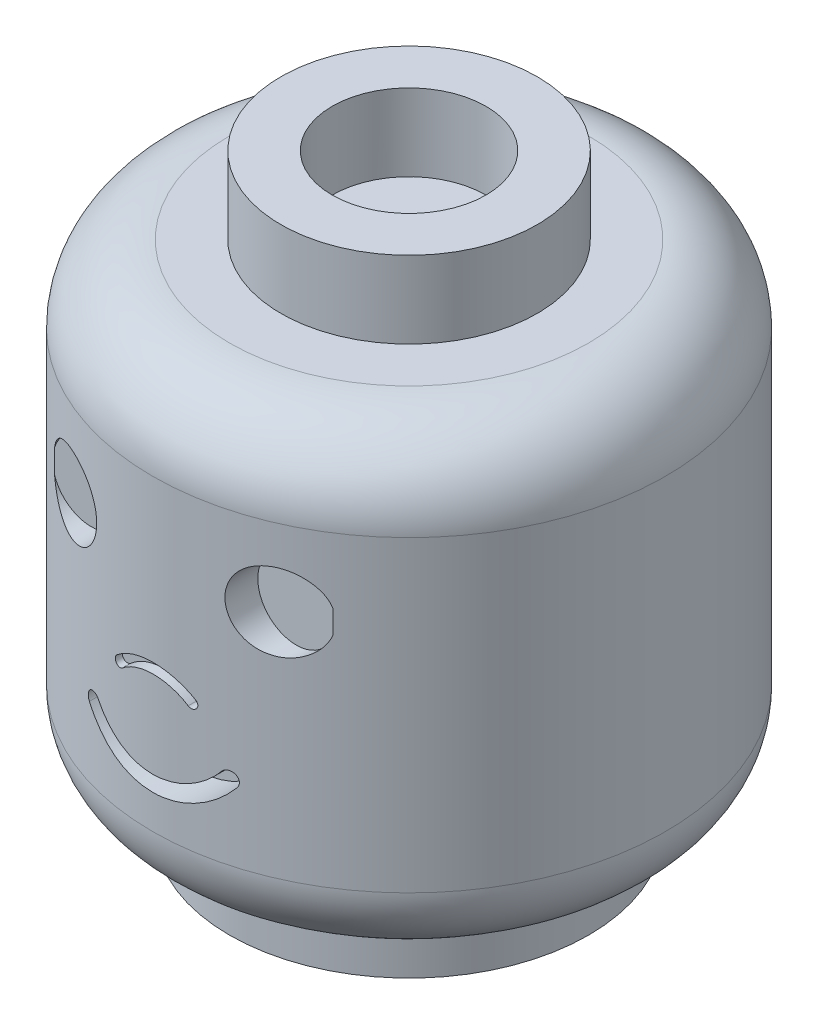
ISO-10303-21;
HEADER;
FILE_DESCRIPTION(('STEP AP214'),'2;1');
FILE_NAME('part.step','',(''),(''),'','','');
FILE_SCHEMA(('AUTOMOTIVE_DESIGN { 1 0 10303 214 1 1 1 1 }'));
ENDSEC;
DATA;
#1=APPLICATION_CONTEXT('core data for automotive mechanical design processes');
#2=APPLICATION_PROTOCOL_DEFINITION('international standard','automotive_design',2000,#1);
#3=PRODUCT_CONTEXT('',#1,'mechanical');
#4=PRODUCT('Part','Part','',(#3));
#5=PRODUCT_RELATED_PRODUCT_CATEGORY('part','',(#4));
#6=PRODUCT_DEFINITION_FORMATION('','',#4);
#7=PRODUCT_DEFINITION_CONTEXT('part definition',#1,'design');
#8=PRODUCT_DEFINITION('design','',#6,#7);
#9=PRODUCT_DEFINITION_SHAPE('','',#8);
#10=(LENGTH_UNIT() NAMED_UNIT(*) SI_UNIT(.MILLI.,.METRE.));
#11=(NAMED_UNIT(*) PLANE_ANGLE_UNIT() SI_UNIT($,.RADIAN.));
#12=(NAMED_UNIT(*) SI_UNIT($,.STERADIAN.) SOLID_ANGLE_UNIT());
#13=UNCERTAINTY_MEASURE_WITH_UNIT(LENGTH_MEASURE(1.E-05),#10,'distance_accuracy_value','');
#14=(GEOMETRIC_REPRESENTATION_CONTEXT(3) GLOBAL_UNCERTAINTY_ASSIGNED_CONTEXT((#13)) GLOBAL_UNIT_ASSIGNED_CONTEXT((#10,
#11,#12)) REPRESENTATION_CONTEXT('',''));
#15=CARTESIAN_POINT('',(0.,0.,0.));
#16=DIRECTION('',(0.,0.,1.));
#17=DIRECTION('',(1.,0.,0.));
#18=AXIS2_PLACEMENT_3D('',#15,#16,#17);
#19=CARTESIAN_POINT('',(4.48294433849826,32.5926703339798,4.305));
#20=DIRECTION('',(0.,0.,1.));
#21=DIRECTION('',(1.,0.,0.));
#22=AXIS2_PLACEMENT_3D('',#19,#20,#21);
#23=PLANE('',#22);
#24=CARTESIAN_POINT('',(4.83485218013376,33.0034888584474,4.305));
#25=DIRECTION('',(0.,0.,1.));
#26=DIRECTION('',(1.,0.,0.));
#27=AXIS2_PLACEMENT_3D('',#24,#25,#26);
#28=CIRCLE('',#27,0.0988592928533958);
#29=CARTESIAN_POINT('',(4.77053883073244,32.9284092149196,4.305));
#30=VERTEX_POINT('',#29);
#31=CARTESIAN_POINT('',(4.89916552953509,33.0785685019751,4.305));
#32=VERTEX_POINT('',#31);
#33=EDGE_CURVE('E943',#30,#32,#28,.T.);
#34=ORIENTED_EDGE('',*,*,#33,.T.);
#35=CARTESIAN_POINT('',(4.13103649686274,32.1818518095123,4.305));
#36=DIRECTION('',(0.,0.,1.));
#37=DIRECTION('',(1.,0.,0.));
#38=AXIS2_PLACEMENT_3D('',#35,#36,#37);
#39=CIRCLE('',#38,1.1807298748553);
#40=CARTESIAN_POINT('',(3.36433389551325,33.0797884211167,4.305));
#41=VERTEX_POINT('',#40);
#42=EDGE_CURVE('E11',#32,#41,#39,.T.);
#43=ORIENTED_EDGE('',*,*,#42,.T.);
#44=CARTESIAN_POINT('',(3.42852781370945,33.0046066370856,4.305));
#45=DIRECTION('',(0.,0.,1.));
#46=DIRECTION('',(1.,0.,0.));
#47=AXIS2_PLACEMENT_3D('',#44,#45,#46);
#48=CIRCLE('',#47,0.0988592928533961);
#49=CARTESIAN_POINT('',(3.49272173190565,32.9294248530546,4.305));
#50=VERTEX_POINT('',#49);
#51=EDGE_CURVE('E355',#41,#50,#48,.T.);
#52=ORIENTED_EDGE('',*,*,#51,.T.);
#53=CARTESIAN_POINT('',(4.13103649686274,32.1818518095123,4.305));
#54=DIRECTION('',(0.,0.,-1.));
#55=DIRECTION('',(1.,0.,0.));
#56=AXIS2_PLACEMENT_3D('',#53,#54,#55);
#57=CIRCLE('',#56,0.983011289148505);
#58=EDGE_CURVE('E857',#50,#30,#57,.T.);
#59=ORIENTED_EDGE('',*,*,#58,.T.);
#60=EDGE_LOOP('',(#34,#43,#52,#59));
#61=FACE_BOUND('',#60,.T.);
#62=ADVANCED_FACE('F16',(#61),#23,.T.);
#63=CARTESIAN_POINT('',(4.13103649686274,32.1818518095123,4.305));
#64=DIRECTION('',(0.,0.,1.));
#65=DIRECTION('',(1.,0.,0.));
#66=AXIS2_PLACEMENT_3D('',#63,#64,#65);
#67=CYLINDRICAL_SURFACE('',#66,1.1807298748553);
#68=DIRECTION('',(0.,0.,1.));
#69=VECTOR('',#68,1.);
#70=CARTESIAN_POINT('',(3.36433389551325,33.0797884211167,4.305));
#71=LINE('',#70,#69);
#72=CARTESIAN_POINT('',(3.36433389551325,33.0797884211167,4.44756701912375));
#73=VERTEX_POINT('',#72);
#74=EDGE_CURVE('E29',#41,#73,#71,.T.);
#75=ORIENTED_EDGE('',*,*,#74,.F.);
#76=ORIENTED_EDGE('',*,*,#42,.F.);
#77=DIRECTION('',(0.,0.,1.));
#78=VECTOR('',#77,1.);
#79=CARTESIAN_POINT('',(4.89916552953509,33.0785685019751,4.305));
#80=LINE('',#79,#78);
#81=CARTESIAN_POINT('',(4.89916552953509,33.0785685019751,4.44391699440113));
#82=VERTEX_POINT('',#81);
#83=EDGE_CURVE('E873',#32,#82,#80,.T.);
#84=ORIENTED_EDGE('',*,*,#83,.T.);
#85=CARTESIAN_POINT('',(4.11999999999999,33.3625301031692,4.505));
#86=CARTESIAN_POINT('',(4.13770651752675,33.3626967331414,4.50500027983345));
#87=CARTESIAN_POINT('',(4.15541716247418,33.36246944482,4.50490595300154));
#88=CARTESIAN_POINT('',(4.19073058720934,33.3612223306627,4.50453066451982));
#89=CARTESIAN_POINT('',(4.20833349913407,33.3602059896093,4.50425052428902));
#90=CARTESIAN_POINT('',(4.24342963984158,33.3573810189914,4.50350704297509));
#91=CARTESIAN_POINT('',(4.26092303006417,33.3555742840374,4.50304414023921));
#92=CARTESIAN_POINT('',(4.29579822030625,33.3511704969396,4.50193898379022));
#93=CARTESIAN_POINT('',(4.3131800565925,33.3485737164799,4.50129679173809));
#94=CARTESIAN_POINT('',(4.34783054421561,33.3425913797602,4.49983678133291));
#95=CARTESIAN_POINT('',(4.36509895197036,33.3392044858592,4.49901866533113));
#96=CARTESIAN_POINT('',(4.39952117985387,33.3316435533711,4.49721053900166));
#97=CARTESIAN_POINT('',(4.41667433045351,33.3274666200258,4.49621989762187));
#98=CARTESIAN_POINT('',(4.45086489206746,33.3183271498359,4.49407040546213));
#99=CARTESIAN_POINT('',(4.46790107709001,33.3133602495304,4.49291062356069));
#100=CARTESIAN_POINT('',(4.50185662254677,33.3026422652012,4.49042651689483));
#101=CARTESIAN_POINT('',(4.51877409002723,33.296885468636,4.48910100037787));
#102=CARTESIAN_POINT('',(4.55230784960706,33.2846561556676,4.48630430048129));
#103=CARTESIAN_POINT('',(4.56892454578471,33.2781846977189,4.48483333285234));
#104=CARTESIAN_POINT('',(4.60173903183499,33.2645592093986,4.48176575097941));
#105=CARTESIAN_POINT('',(4.61793881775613,33.2574097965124,4.48016999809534));
#106=CARTESIAN_POINT('',(4.64991930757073,33.2424297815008,4.47686512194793));
#107=CARTESIAN_POINT('',(4.66570156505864,33.234602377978,4.47515653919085));
#108=CARTESIAN_POINT('',(4.6968473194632,33.218267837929,4.47163791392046));
#109=CARTESIAN_POINT('',(4.71221177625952,33.2097624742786,4.46982813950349));
#110=CARTESIAN_POINT('',(4.74252251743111,33.1920734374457,4.46611869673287));
#111=CARTESIAN_POINT('',(4.7574690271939,33.1828901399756,4.4642190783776));
#112=CARTESIAN_POINT('',(4.78694487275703,33.1638466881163,4.46034114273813));
#113=CARTESIAN_POINT('',(4.80147357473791,33.1539855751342,4.45836271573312));
#114=CARTESIAN_POINT('',(4.83011471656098,33.1335876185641,4.4543380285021));
#115=CARTESIAN_POINT('',(4.84422555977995,33.1230485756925,4.45229155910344));
#116=CARTESIAN_POINT('',(4.87203347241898,33.1012967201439,4.44814115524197));
#117=CARTESIAN_POINT('',(4.8857279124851,33.0900805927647,4.44603697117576));
#118=CARTESIAN_POINT('',(4.89916552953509,33.0785685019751,4.44391699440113));
#119=B_SPLINE_CURVE_WITH_KNOTS('',3,(#85,#86,#87,#88,#89,#90,#91,#92,#93,#94,#95,#96,#97,#98,
#99,#100,#101,#102,#103,#104,#105,#106,#107,#108,#109,#110,#111,#112,#113,#114,#115,#116,#117,
#118),.UNSPECIFIED.,.F.,.F.,(4,2,2,2,2,2,2,2,2,2,2,2,2,2,2,2,4),(0.,0.0531179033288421,
0.106002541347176,0.158761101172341,0.211501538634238,0.264331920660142,0.317359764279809,
0.370691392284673,0.424431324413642,0.478092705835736,0.531411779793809,0.584491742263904,
0.637437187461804,0.690353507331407,0.743346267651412,0.796520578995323,0.8499804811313),.UNSPECIFIED.);
#120=CARTESIAN_POINT('',(4.12,33.3625301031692,4.505));
#121=VERTEX_POINT('',#120);
#122=EDGE_CURVE('E370',#121,#82,#119,.T.);
#123=ORIENTED_EDGE('',*,*,#122,.F.);
#124=CARTESIAN_POINT('',(3.36433389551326,33.0797884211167,4.44756701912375));
#125=CARTESIAN_POINT('',(3.37743976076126,33.0909800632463,4.44957080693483));
#126=CARTESIAN_POINT('',(3.39078631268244,33.1018937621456,4.45155796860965));
#127=CARTESIAN_POINT('',(3.41786243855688,33.1230728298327,4.45547358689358));
#128=CARTESIAN_POINT('',(3.43158924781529,33.1333416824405,4.45740232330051));
#129=CARTESIAN_POINT('',(3.45942620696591,33.1532313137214,4.46119196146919));
#130=CARTESIAN_POINT('',(3.47353451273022,33.1628546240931,4.46305311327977));
#131=CARTESIAN_POINT('',(3.50213348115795,33.1814543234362,4.46669812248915));
#132=CARTESIAN_POINT('',(3.51662316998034,33.190432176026,4.46848215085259));
#133=CARTESIAN_POINT('',(3.545984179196,33.2077420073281,4.47196328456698));
#134=CARTESIAN_POINT('',(3.56085531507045,33.216074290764,4.47366043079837));
#135=CARTESIAN_POINT('',(3.59097833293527,33.2320941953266,4.47695795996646));
#136=CARTESIAN_POINT('',(3.60623071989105,33.2397808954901,4.4785582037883));
#137=CARTESIAN_POINT('',(3.63711539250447,33.2545107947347,4.48165189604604));
#138=CARTESIAN_POINT('',(3.65274875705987,33.2615518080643,4.48314497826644));
#139=CARTESIAN_POINT('',(3.68439424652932,33.2749918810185,4.48601408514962));
#140=CARTESIAN_POINT('',(3.70040789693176,33.2813874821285,4.4873894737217));
#141=CARTESIAN_POINT('',(3.73275253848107,33.2935140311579,4.49000787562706));
#142=CARTESIAN_POINT('',(3.7490843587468,33.2992428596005,4.49125046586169));
#143=CARTESIAN_POINT('',(3.7818909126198,33.309953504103,4.49358206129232));
#144=CARTESIAN_POINT('',(3.79836415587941,33.31493968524,4.49467196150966));
#145=CARTESIAN_POINT('',(3.83145136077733,33.3241664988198,4.49669442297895));
#146=CARTESIAN_POINT('',(3.84806441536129,33.3284102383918,4.49762763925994));
#147=CARTESIAN_POINT('',(3.88142927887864,33.3361533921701,4.4993330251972));
#148=CARTESIAN_POINT('',(3.89818065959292,33.3396545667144,4.50010557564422));
#149=CARTESIAN_POINT('',(3.93182018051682,33.3459139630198,4.50148592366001));
#150=CARTESIAN_POINT('',(3.94870825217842,33.3486725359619,4.5020937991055));
#151=CARTESIAN_POINT('',(3.98261924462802,33.3534482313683,4.50314112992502));
#152=CARTESIAN_POINT('',(3.99964232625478,33.3554642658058,4.50358033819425));
#153=CARTESIAN_POINT('',(4.03382139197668,33.3587560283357,4.50428657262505));
#154=CARTESIAN_POINT('',(4.05097763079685,33.3600292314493,4.50455301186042));
#155=CARTESIAN_POINT('',(4.08542144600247,33.3618378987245,4.50491031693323));
#156=CARTESIAN_POINT('',(4.10270923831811,33.3623694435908,4.50500025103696));
#157=CARTESIAN_POINT('',(4.11999999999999,33.3625301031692,4.505));
#158=B_SPLINE_CURVE_WITH_KNOTS('',3,(#124,#125,#126,#127,#128,#129,#130,#131,#132,#133,#134,
#135,#136,#137,#138,#139,#140,#141,#142,#143,#144,#145,#146,#147,#148,#149,#150,#151,#152,#153,
#154,#155,#156,#157),.UNSPECIFIED.,.F.,.F.,(4,2,2,2,2,2,2,2,2,2,2,2,2,2,2,2,4),(0.,
0.0520477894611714,0.103784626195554,0.155305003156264,0.206704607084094,0.258079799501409,
0.309527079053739,0.361142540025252,0.413021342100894,0.465060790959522,0.516781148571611,
0.568279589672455,0.619654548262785,0.671005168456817,0.722430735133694,0.77403010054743,
0.825901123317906),.UNSPECIFIED.);
#159=EDGE_CURVE('E364',#73,#121,#158,.T.);
#160=ORIENTED_EDGE('',*,*,#159,.F.);
#161=EDGE_LOOP('',(#75,#76,#84,#123,#160));
#162=FACE_BOUND('',#161,.T.);
#163=ADVANCED_FACE('F334',(#162),#67,.F.);
#164=CARTESIAN_POINT('',(3.42852781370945,33.0046066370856,4.305));
#165=DIRECTION('',(0.,0.,1.));
#166=DIRECTION('',(1.,0.,0.));
#167=AXIS2_PLACEMENT_3D('',#164,#165,#166);
#168=CYLINDRICAL_SURFACE('',#167,0.0988592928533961);
#169=DIRECTION('',(0.,0.,1.));
#170=VECTOR('',#169,1.);
#171=CARTESIAN_POINT('',(3.49272173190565,32.9294248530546,4.305));
#172=LINE('',#171,#170);
#173=CARTESIAN_POINT('',(3.49272173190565,32.9294248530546,4.46549614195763));
#174=VERTEX_POINT('',#173);
#175=EDGE_CURVE('E87',#50,#174,#172,.T.);
#176=ORIENTED_EDGE('',*,*,#175,.F.);
#177=ORIENTED_EDGE('',*,*,#51,.F.);
#178=ORIENTED_EDGE('',*,*,#74,.T.);
#179=CARTESIAN_POINT('',(3.49272173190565,32.9294248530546,4.46549614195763));
#180=CARTESIAN_POINT('',(3.49186416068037,32.9286926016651,4.46538769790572));
#181=CARTESIAN_POINT('',(3.4909959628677,32.9279729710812,4.46527768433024));
#182=CARTESIAN_POINT('',(3.48924818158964,32.9265683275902,4.46505573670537));
#183=CARTESIAN_POINT('',(3.4883688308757,32.9258830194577,4.46494383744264));
#184=CARTESIAN_POINT('',(3.48659874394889,32.9245470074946,4.46471810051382));
#185=CARTESIAN_POINT('',(3.48570821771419,32.9238960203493,4.46460429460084));
#186=CARTESIAN_POINT('',(3.48391581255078,32.9226286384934,4.46437473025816));
#187=CARTESIAN_POINT('',(3.48301411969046,32.9220119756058,4.46425900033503));
#188=CARTESIAN_POINT('',(3.48119940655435,32.9208132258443,4.46402557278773));
#189=CARTESIAN_POINT('',(3.48028654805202,32.9202308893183,4.46390790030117));
#190=CARTESIAN_POINT('',(3.47844953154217,32.9191007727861,4.46367057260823));
#191=CARTESIAN_POINT('',(3.47752551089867,32.918552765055,4.46355093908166));
#192=CARTESIAN_POINT('',(3.47566619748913,32.9174912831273,4.46330967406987));
#193=CARTESIAN_POINT('',(3.47473101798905,32.9169776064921,4.46318806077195));
#194=CARTESIAN_POINT('',(3.47284941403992,32.9159847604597,4.46294282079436));
#195=CARTESIAN_POINT('',(3.47190307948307,32.915505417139,4.46281920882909));
#196=CARTESIAN_POINT('',(3.46999919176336,32.9145812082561,4.46256995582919));
#197=CARTESIAN_POINT('',(3.4690417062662,32.9141362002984,4.46244432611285));
#198=CARTESIAN_POINT('',(3.46711554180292,32.9132806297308,4.46219102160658));
#199=CARTESIAN_POINT('',(3.46614690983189,32.9128699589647,4.46206335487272));
#200=CARTESIAN_POINT('',(3.46419847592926,32.9120830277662,4.46180595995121));
#201=CARTESIAN_POINT('',(3.46321870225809,32.9117066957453,4.46167623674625));
#202=CARTESIAN_POINT('',(3.46124800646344,32.9109884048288,4.46141471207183));
#203=CARTESIAN_POINT('',(3.46025709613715,32.9106464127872,4.4612829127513));
#204=CARTESIAN_POINT('',(3.45826414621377,32.9099967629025,4.46101721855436));
#205=CARTESIAN_POINT('',(3.45726210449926,32.909689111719,4.4608833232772));
#206=CARTESIAN_POINT('',(3.45524690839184,32.9091081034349,4.46061341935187));
#207=CARTESIAN_POINT('',(3.45423374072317,32.9088347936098,4.46047740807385));
#208=CARTESIAN_POINT('',(3.45219630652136,32.908322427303,4.46020325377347));
#209=CARTESIAN_POINT('',(3.45117201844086,32.908083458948,4.46006510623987));
#210=CARTESIAN_POINT('',(3.44911235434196,32.9076397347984,4.45978666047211));
#211=CARTESIAN_POINT('',(3.44807695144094,32.9074351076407,4.45964635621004));
#212=CARTESIAN_POINT('',(3.44599506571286,32.9070600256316,4.459363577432));
#213=CARTESIAN_POINT('',(3.44494855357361,32.9068897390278,4.4592210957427));
#214=CARTESIAN_POINT('',(3.44284445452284,32.9065832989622,4.45893394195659));
#215=CARTESIAN_POINT('',(3.44178683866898,32.9064473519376,4.45878926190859));
#216=CARTESIAN_POINT('',(3.43966053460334,32.9062095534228,4.45849769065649));
#217=CARTESIAN_POINT('',(3.43859182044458,32.906107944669,4.45835079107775));
#218=CARTESIAN_POINT('',(3.43644331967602,32.9059387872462,4.45805475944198));
#219=CARTESIAN_POINT('',(3.43536351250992,32.9058715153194,4.45790561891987));
#220=CARTESIAN_POINT('',(3.43319282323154,32.9057709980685,4.45760508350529));
#221=CARTESIAN_POINT('',(3.43210192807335,32.9057380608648,4.45745368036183));
#222=CARTESIAN_POINT('',(3.42990905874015,32.9057061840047,4.45714859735));
#223=CARTESIAN_POINT('',(3.42880708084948,32.9057075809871,4.45699490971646));
#224=CARTESIAN_POINT('',(3.42659203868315,32.9057443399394,4.45668523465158));
#225=CARTESIAN_POINT('',(3.4254789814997,32.9057800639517,4.45652924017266));
#226=CARTESIAN_POINT('',(3.42324177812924,32.9058854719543,4.45621492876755));
#227=CARTESIAN_POINT('',(3.42211765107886,32.9059555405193,4.45605660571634));
#228=CARTESIAN_POINT('',(3.41987168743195,32.9061285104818,4.45573950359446));
#229=CARTESIAN_POINT('',(3.41874985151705,32.9062314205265,4.45558072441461));
#230=CARTESIAN_POINT('',(3.41652246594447,32.9064697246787,4.45526470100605));
#231=CARTESIAN_POINT('',(3.41541687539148,32.9066047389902,4.45510745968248));
#232=CARTESIAN_POINT('',(3.41322199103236,32.9069072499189,4.45479454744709));
#233=CARTESIAN_POINT('',(3.41213264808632,32.9070743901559,4.45463887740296));
#234=CARTESIAN_POINT('',(3.40997026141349,32.9074411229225,4.45432914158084));
#235=CARTESIAN_POINT('',(3.40889716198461,32.9076403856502,4.4541750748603));
#236=CARTESIAN_POINT('',(3.40676726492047,32.9080713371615,4.45386857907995));
#237=CARTESIAN_POINT('',(3.40571040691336,32.9083027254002,4.45371614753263));
#238=CARTESIAN_POINT('',(3.40361299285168,32.9087978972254,4.45341295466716));
#239=CARTESIAN_POINT('',(3.40257237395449,32.9090614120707,4.45326218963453));
#240=CARTESIAN_POINT('',(3.40050743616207,32.9096208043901,4.45296236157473));
#241=CARTESIAN_POINT('',(3.39948305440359,32.9099164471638,4.45281329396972));
#242=CARTESIAN_POINT('',(3.39745058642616,32.9105400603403,4.45251689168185));
#243=CARTESIAN_POINT('',(3.39644243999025,32.9108678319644,4.45236955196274));
#244=CARTESIAN_POINT('',(3.39444243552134,32.9115556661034,4.45207663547));
#245=CARTESIAN_POINT('',(3.39345052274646,32.9119155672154,4.45193105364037));
#246=CARTESIAN_POINT('',(3.3914829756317,32.9126676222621,4.45164168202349));
#247=CARTESIAN_POINT('',(3.3905072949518,32.9130596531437,4.45149788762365));
#248=CARTESIAN_POINT('',(3.38857219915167,32.9138759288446,4.45121211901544));
#249=CARTESIAN_POINT('',(3.38761274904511,32.9143000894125,4.45107014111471));
#250=CARTESIAN_POINT('',(3.38571009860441,32.9151805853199,4.45078803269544));
#251=CARTESIAN_POINT('',(3.38476687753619,32.9156368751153,4.45064789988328));
#252=CARTESIAN_POINT('',(3.38289666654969,32.9165815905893,4.45036950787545));
#253=CARTESIAN_POINT('',(3.38196967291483,32.9170700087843,4.45023124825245));
#254=CARTESIAN_POINT('',(3.38013189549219,32.9180789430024,4.44995662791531));
#255=CARTESIAN_POINT('',(3.37922112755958,32.9185994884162,4.44982026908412));
#256=CARTESIAN_POINT('',(3.37741577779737,32.9196726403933,4.44954947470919));
#257=CARTESIAN_POINT('',(3.37652123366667,32.9202253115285,4.44941504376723));
#258=CARTESIAN_POINT('',(3.37474830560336,32.921362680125,4.44914812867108));
#259=CARTESIAN_POINT('',(3.37386998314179,32.9219474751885,4.44901565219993));
#260=CARTESIAN_POINT('',(3.37212947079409,32.9231490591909,4.44875266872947));
#261=CARTESIAN_POINT('',(3.3712673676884,32.9237659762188,4.448622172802));
#262=CARTESIAN_POINT('',(3.36955926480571,32.925031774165,4.44836317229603));
#263=CARTESIAN_POINT('',(3.3687133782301,32.9256808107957,4.4482346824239));
#264=CARTESIAN_POINT('',(3.36703767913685,32.9270108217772,4.44797971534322));
#265=CARTESIAN_POINT('',(3.3662080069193,32.9276919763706,4.44785325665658));
#266=CARTESIAN_POINT('',(3.36456470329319,32.9290861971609,4.44760237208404));
#267=CARTESIAN_POINT('',(3.36375123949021,32.9297994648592,4.44747796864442));
#268=CARTESIAN_POINT('',(3.36214033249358,32.9312579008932,4.44723121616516));
#269=CARTESIAN_POINT('',(3.36134308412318,32.9320032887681,4.44710889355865));
#270=CARTESIAN_POINT('',(3.35976453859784,32.9335259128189,4.44686631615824));
#271=CARTESIAN_POINT('',(3.35898346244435,32.9343033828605,4.44674609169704));
#272=CARTESIAN_POINT('',(3.35743738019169,32.9358902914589,4.44650775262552));
#273=CARTESIAN_POINT('',(3.35667262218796,32.9366999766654,4.44638967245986));
#274=CARTESIAN_POINT('',(3.35515858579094,32.9383507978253,4.44615555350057));
#275=CARTESIAN_POINT('',(3.3544095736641,32.9391921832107,4.446039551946));
#276=CARTESIAN_POINT('',(3.35296357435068,32.9408683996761,4.44581528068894));
#277=CARTESIAN_POINT('',(3.35226568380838,32.9417024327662,4.44570688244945));
#278=CARTESIAN_POINT('',(3.35090116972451,32.9433891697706,4.44549465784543));
#279=CARTESIAN_POINT('',(3.35023440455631,32.9442417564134,4.44539081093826));
#280=CARTESIAN_POINT('',(3.34893155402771,32.9459650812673,4.44518763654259));
#281=CARTESIAN_POINT('',(3.34829535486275,32.9468357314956,4.4450882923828));
#282=CARTESIAN_POINT('',(3.3470537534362,32.9485952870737,4.4448941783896));
#283=CARTESIAN_POINT('',(3.34644826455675,32.9494841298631,4.44479939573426));
#284=CARTESIAN_POINT('',(3.34526801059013,32.9512800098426,4.44461442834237));
#285=CARTESIAN_POINT('',(3.34469318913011,32.9521870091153,4.44452423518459));
#286=CARTESIAN_POINT('',(3.34357424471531,32.9540191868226,4.44434847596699));
#287=CARTESIAN_POINT('',(3.34303009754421,32.9549443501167,4.4442629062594));
#288=CARTESIAN_POINT('',(3.34197246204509,32.9568128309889,4.44409641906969));
#289=CARTESIAN_POINT('',(3.3414589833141,32.9577561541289,4.44401550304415));
#290=CARTESIAN_POINT('',(3.34046264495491,32.9596609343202,4.44385834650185));
#291=CARTESIAN_POINT('',(3.3399798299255,32.9606224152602,4.44378211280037));
#292=CARTESIAN_POINT('',(3.33904478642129,32.9625634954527,4.44363434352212));
#293=CARTESIAN_POINT('',(3.33859263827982,32.9635431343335,4.44356282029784));
#294=CARTESIAN_POINT('',(3.337718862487,32.965520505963,4.44342448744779));
#295=CARTESIAN_POINT('',(3.33729735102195,32.9665182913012,4.44335769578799));
#296=CARTESIAN_POINT('',(3.33648490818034,32.9685319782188,4.44322885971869));
#297=CARTESIAN_POINT('',(3.33609412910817,32.9695479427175,4.4431668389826));
#298=CARTESIAN_POINT('',(3.33534273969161,32.9715978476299,4.44304750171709));
#299=CARTESIAN_POINT('',(3.33498231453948,32.9726318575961,4.44299021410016));
#300=CARTESIAN_POINT('',(3.33430055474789,32.974695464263,4.44288178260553));
#301=CARTESIAN_POINT('',(3.33397870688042,32.9757248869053,4.44283055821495));
#302=CARTESIAN_POINT('',(3.33336986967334,32.977793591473,4.44273360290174));
#303=CARTESIAN_POINT('',(3.33308285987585,32.978832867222,4.44268786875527));
#304=CARTESIAN_POINT('',(3.33254328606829,32.9809211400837,4.44260184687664));
#305=CARTESIAN_POINT('',(3.33229074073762,32.9819701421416,4.44256156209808));
#306=CARTESIAN_POINT('',(3.33182015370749,32.9840778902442,4.44248646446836));
#307=CARTESIAN_POINT('',(3.33160217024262,32.9851366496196,4.44245166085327));
#308=CARTESIAN_POINT('',(3.33120063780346,32.9872638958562,4.44238752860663));
#309=CARTESIAN_POINT('',(3.33101718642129,32.9883324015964,4.44235821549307));
#310=CARTESIAN_POINT('',(3.33068468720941,32.9904791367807,4.44230507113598));
#311=CARTESIAN_POINT('',(3.33053577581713,32.9915573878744,4.44228126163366));
#312=CARTESIAN_POINT('',(3.33027306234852,32.9937173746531,4.44223924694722));
#313=CARTESIAN_POINT('',(3.33015923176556,32.9947991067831,4.44222103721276));
#314=CARTESIAN_POINT('',(3.32996721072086,32.9969629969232,4.44219031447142));
#315=CARTESIAN_POINT('',(3.32988892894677,32.9980451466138,4.44217778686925));
#316=CARTESIAN_POINT('',(3.32976795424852,33.0002098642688,4.44215842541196));
#317=CARTESIAN_POINT('',(3.32972520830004,33.00129242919,4.44215158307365));
#318=CARTESIAN_POINT('',(3.3296753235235,33.0034579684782,4.44214359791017));
#319=CARTESIAN_POINT('',(3.32966817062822,33.0045409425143,4.44214245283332));
#320=CARTESIAN_POINT('',(3.32968921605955,33.0067073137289,4.44214582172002));
#321=CARTESIAN_POINT('',(3.32971743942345,33.0077907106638,4.44215033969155));
#322=CARTESIAN_POINT('',(3.32981000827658,33.0099578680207,4.44216515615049));
#323=CARTESIAN_POINT('',(3.32987441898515,33.0110416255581,4.44217546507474));
#324=CARTESIAN_POINT('',(3.33003962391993,33.0132543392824,4.44220190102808));
#325=CARTESIAN_POINT('',(3.33014189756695,33.0143831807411,4.44221826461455));
#326=CARTESIAN_POINT('',(3.33037881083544,33.016624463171,4.44225616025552));
#327=CARTESIAN_POINT('',(3.33051307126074,33.0177369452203,4.44227763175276));
#328=CARTESIAN_POINT('',(3.33081478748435,33.0199454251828,4.44232586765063));
#329=CARTESIAN_POINT('',(3.33098188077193,33.0210414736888,4.44235257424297));
#330=CARTESIAN_POINT('',(3.33134901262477,33.0232170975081,4.44241123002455));
#331=CARTESIAN_POINT('',(3.33154872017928,33.0242967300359,4.44244312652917));
#332=CARTESIAN_POINT('',(3.33198111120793,33.026439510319,4.44251215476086));
#333=CARTESIAN_POINT('',(3.3322134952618,33.0275027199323,4.44254923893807));
#334=CARTESIAN_POINT('',(3.332711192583,33.0296126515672,4.44262862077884));
#335=CARTESIAN_POINT('',(3.33297624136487,33.0306594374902,4.44267087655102));
#336=CARTESIAN_POINT('',(3.3335392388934,33.0327365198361,4.44276058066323));
#337=CARTESIAN_POINT('',(3.3338369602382,33.0337668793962,4.4428079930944));
#338=CARTESIAN_POINT('',(3.33446526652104,33.0358111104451,4.44290798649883));
#339=CARTESIAN_POINT('',(3.33479566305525,33.0368250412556,4.44296053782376));
#340=CARTESIAN_POINT('',(3.33548928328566,33.0388364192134,4.4430707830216));
#341=CARTESIAN_POINT('',(3.33585235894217,33.0398339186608,4.44312845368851));
#342=CARTESIAN_POINT('',(3.33661129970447,33.0418124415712,4.4432489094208));
#343=CARTESIAN_POINT('',(3.33700705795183,33.0427935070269,4.44331167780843));
#344=CARTESIAN_POINT('',(3.33783132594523,33.0447391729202,4.44344229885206));
#345=CARTESIAN_POINT('',(3.33825977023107,33.0457038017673,4.4435101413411));
#346=CARTESIAN_POINT('',(3.33914937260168,33.0476166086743,4.44365087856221));
#347=CARTESIAN_POINT('',(3.33961050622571,33.0485647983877,4.44372376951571));
#348=CARTESIAN_POINT('',(3.34056545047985,33.0504447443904,4.4438745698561));
#349=CARTESIAN_POINT('',(3.34105927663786,33.0513764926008,4.44395248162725));
#350=CARTESIAN_POINT('',(3.34207957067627,33.0532235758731,4.44411328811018));
#351=CARTESIAN_POINT('',(3.34260609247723,33.0541388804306,4.44419619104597));
#352=CARTESIAN_POINT('',(3.34369174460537,33.0559530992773,4.44436694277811));
#353=CARTESIAN_POINT('',(3.3442509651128,33.0568519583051,4.44445480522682));
#354=CARTESIAN_POINT('',(3.34540198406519,33.0586333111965,4.44463543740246));
#355=CARTESIAN_POINT('',(3.34599390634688,33.0595157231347,4.44472822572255));
#356=CARTESIAN_POINT('',(3.34721030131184,33.0612642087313,4.44491866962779));
#357=CARTESIAN_POINT('',(3.34783492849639,33.0621301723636,4.44501634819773));
#358=CARTESIAN_POINT('',(3.34911670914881,33.0638457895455,4.44521653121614));
#359=CARTESIAN_POINT('',(3.34977404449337,33.0646953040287,4.44531906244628));
#360=CARTESIAN_POINT('',(3.35112122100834,33.0663780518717,4.44552890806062));
#361=CARTESIAN_POINT('',(3.35181126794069,33.0672111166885,4.44563625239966));
#362=CARTESIAN_POINT('',(3.35322385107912,33.0688609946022,4.44585568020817));
#363=CARTESIAN_POINT('',(3.3539466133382,33.0696776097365,4.44596779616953));
#364=CARTESIAN_POINT('',(3.35542461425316,33.0712946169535,4.44619672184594));
#365=CARTESIAN_POINT('',(3.35618009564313,33.0720947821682,4.44631356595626));
#366=CARTESIAN_POINT('',(3.35772352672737,33.0736789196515,4.44655190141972));
#367=CARTESIAN_POINT('',(3.35851173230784,33.0744626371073,4.4466734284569));
#368=CARTESIAN_POINT('',(3.36012060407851,33.076013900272,4.44692108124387));
#369=CARTESIAN_POINT('',(3.36094153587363,33.0767811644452,4.44704724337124));
#370=CARTESIAN_POINT('',(3.36261586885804,33.0782995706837,4.4473041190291));
#371=CARTESIAN_POINT('',(3.36346954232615,33.0790504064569,4.44743486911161));
#372=CARTESIAN_POINT('',(3.36433389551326,33.0797884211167,4.44756701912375));
#373=B_SPLINE_CURVE_WITH_KNOTS('',3,(#179,#180,#181,#182,#183,#184,#185,#186,#187,#188,#189,
#190,#191,#192,#193,#194,#195,#196,#197,#198,#199,#200,#201,#202,#203,#204,#205,#206,#207,#208,
#209,#210,#211,#212,#213,#214,#215,#216,#217,#218,#219,#220,#221,#222,#223,#224,#225,#226,#227,
#228,#229,#230,#231,#232,#233,#234,#235,#236,#237,#238,#239,#240,#241,#242,#243,#244,#245,#246,
#247,#248,#249,#250,#251,#252,#253,#254,#255,#256,#257,#258,#259,#260,#261,#262,#263,#264,#265,
#266,#267,#268,#269,#270,#271,#272,#273,#274,#275,#276,#277,#278,#279,#280,#281,#282,#283,#284,
#285,#286,#287,#288,#289,#290,#291,#292,#293,#294,#295,#296,#297,#298,#299,#300,#301,#302,#303,
#304,#305,#306,#307,#308,#309,#310,#311,#312,#313,#314,#315,#316,#317,#318,#319,#320,#321,#322,
#323,#324,#325,#326,#327,#328,#329,#330,#331,#332,#333,#334,#335,#336,#337,#338,#339,#340,#341,
#342,#343,#344,#345,#346,#347,#348,#349,#350,#351,#352,#353,#354,#355,#356,#357,#358,#359,#360,
#361,#362,#363,#364,#365,#366,#367,#368,#369,#370,#371,#372),.UNSPECIFIED.,.F.,.F.,(4,2,2,2,2,2,
2,2,2,2,2,2,2,2,2,2,2,2,2,2,2,2,2,2,2,2,2,2,2,2,2,2,2,2,2,2,2,2,2,2,2,2,2,2,2,2,2,2,2,2,2,2,2,2,
2,2,2,2,2,2,2,2,2,2,2,2,2,2,2,2,2,2,2,2,2,2,2,2,2,2,2,2,2,2,2,2,2,2,2,2,2,2,2,2,2,2,4),(0.,
0.00339852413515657,0.00675939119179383,0.0100857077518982,0.0133806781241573,
0.0166475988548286,0.019889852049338,0.0231108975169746,0.0263142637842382,0.029503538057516,
0.0326823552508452,0.0358543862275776,0.0390233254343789,0.0421928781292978,0.0453667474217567,
0.0485486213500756,0.0517421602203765,0.0549509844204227,0.0581786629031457,0.061428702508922,
0.064704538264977,0.0680095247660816,0.0713469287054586,0.0747199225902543,0.0781315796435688,
0.0815441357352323,0.0849181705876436,0.0882567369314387,0.091562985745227,0.0948401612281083,
0.0980915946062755,0.1013206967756,0.104530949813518,0.107725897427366,0.110909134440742,
0.114084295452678,0.117255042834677,0.120425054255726,0.123598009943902,0.126777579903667,
0.129967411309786,0.133171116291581,0.136392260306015,0.139634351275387,0.142900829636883,
0.146195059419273,0.149520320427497,0.152879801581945,0.15627659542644,0.159554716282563,
0.162816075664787,0.166064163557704,0.169302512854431,0.172534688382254,0.175764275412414,
0.178994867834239,0.182230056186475,0.185473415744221,0.188728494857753,0.191998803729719,
0.195287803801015,0.19852653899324,0.201763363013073,0.205001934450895,0.208245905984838,
0.211498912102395,0.214764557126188,0.21802754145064,0.221282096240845,0.224531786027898,
0.227780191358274,0.231030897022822,0.234287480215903,0.237687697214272,0.241049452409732,
0.244375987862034,0.247670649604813,0.250936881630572,0.254178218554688,0.25739827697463,
0.260600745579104,0.263789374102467,0.266967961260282,0.270140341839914,0.273310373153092,
0.276481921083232,0.279658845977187,0.282844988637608,0.28604415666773,0.289260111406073,
0.292496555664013,0.295757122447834,0.299045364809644,0.302364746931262,0.305718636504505,
0.309110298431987,0.312542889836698),.UNSPECIFIED.);
#374=EDGE_CURVE('E361',#174,#73,#373,.T.);
#375=ORIENTED_EDGE('',*,*,#374,.F.);
#376=EDGE_LOOP('',(#176,#177,#178,#375));
#377=FACE_BOUND('',#376,.T.);
#378=ADVANCED_FACE('F337',(#377),#168,.F.);
#379=CARTESIAN_POINT('',(4.13103649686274,32.1818518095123,4.305));
#380=DIRECTION('',(0.,0.,1.));
#381=DIRECTION('',(1.,0.,0.));
#382=AXIS2_PLACEMENT_3D('',#379,#380,#381);
#383=CYLINDRICAL_SURFACE('',#382,0.983011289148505);
#384=DIRECTION('',(0.,0.,1.));
#385=VECTOR('',#384,1.);
#386=CARTESIAN_POINT('',(4.77053883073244,32.9284092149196,4.305));
#387=LINE('',#386,#385);
#388=CARTESIAN_POINT('',(4.77053883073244,32.9284092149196,4.46249929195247));
#389=VERTEX_POINT('',#388);
#390=EDGE_CURVE('E923',#30,#389,#387,.T.);
#391=ORIENTED_EDGE('',*,*,#390,.F.);
#392=ORIENTED_EDGE('',*,*,#58,.F.);
#393=ORIENTED_EDGE('',*,*,#175,.T.);
#394=CARTESIAN_POINT('',(4.11999999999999,33.1648011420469,4.505));
#395=CARTESIAN_POINT('',(4.1057415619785,33.1646418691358,4.50500016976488));
#396=CARTESIAN_POINT('',(4.09148626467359,33.1641750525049,4.50493901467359));
#397=CARTESIAN_POINT('',(4.06306864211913,33.1626246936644,4.50469593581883));
#398=CARTESIAN_POINT('',(4.04890617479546,33.1615436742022,4.50451450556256));
#399=CARTESIAN_POINT('',(4.02067513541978,33.1587650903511,4.50403326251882));
#400=CARTESIAN_POINT('',(4.00660642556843,33.1570688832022,4.50373371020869));
#401=CARTESIAN_POINT('',(3.97856387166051,33.1530613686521,4.5030188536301));
#402=CARTESIAN_POINT('',(3.96459000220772,33.1507502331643,4.50260358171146));
#403=CARTESIAN_POINT('',(3.93673789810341,33.1455139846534,4.50165983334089));
#404=CARTESIAN_POINT('',(3.92285985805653,33.1425878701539,4.50113117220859));
#405=CARTESIAN_POINT('',(3.8952000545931,33.1361228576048,4.49996319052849));
#406=CARTESIAN_POINT('',(3.8814188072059,33.1325818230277,4.49932348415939));
#407=CARTESIAN_POINT('',(3.85395307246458,33.1248880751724,4.49793592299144));
#408=CARTESIAN_POINT('',(3.84026951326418,33.1207321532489,4.49718750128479));
#409=CARTESIAN_POINT('',(3.81299957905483,33.1118097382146,4.49558500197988));
#410=CARTESIAN_POINT('',(3.79941462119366,33.107039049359,4.49473019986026));
#411=CARTESIAN_POINT('',(3.7724506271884,33.0969286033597,4.49292463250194));
#412=CARTESIAN_POINT('',(3.75907178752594,33.091588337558,4.49197378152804));
#413=CARTESIAN_POINT('',(3.73264607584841,33.0803750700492,4.48999061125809));
#414=CARTESIAN_POINT('',(3.71959763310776,33.0745056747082,4.48895884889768));
#415=CARTESIAN_POINT('',(3.69383273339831,33.0622352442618,4.48682173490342));
#416=CARTESIAN_POINT('',(3.68111503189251,33.0558367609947,4.48571674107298));
#417=CARTESIAN_POINT('',(3.65601134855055,33.0425092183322,4.48344081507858));
#418=CARTESIAN_POINT('',(3.64362455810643,33.0355816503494,4.48227007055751));
#419=CARTESIAN_POINT('',(3.6191822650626,33.0211970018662,4.47987007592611));
#420=CARTESIAN_POINT('',(3.60712649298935,33.0137403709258,4.4786408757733));
#421=CARTESIAN_POINT('',(3.58334554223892,32.9982986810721,4.4761311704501));
#422=CARTESIAN_POINT('',(3.57162072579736,32.9903130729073,4.4748506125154));
#423=CARTESIAN_POINT('',(3.54850108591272,32.9738142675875,4.47224518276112));
#424=CARTESIAN_POINT('',(3.53710733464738,32.9652995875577,4.47092019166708));
#425=CARTESIAN_POINT('',(3.51464809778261,32.9477441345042,4.4682325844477));
#426=CARTESIAN_POINT('',(3.50358444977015,32.9387010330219,4.46686981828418));
#427=CARTESIAN_POINT('',(3.49272173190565,32.9294248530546,4.46549614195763));
#428=B_SPLINE_CURVE_WITH_KNOTS('',3,(#394,#395,#396,#397,#398,#399,#400,#401,#402,#403,#404,
#405,#406,#407,#408,#409,#410,#411,#412,#413,#414,#415,#416,#417,#418,#419,#420,#421,#422,#423,
#424,#425,#426,#427),.UNSPECIFIED.,.F.,.F.,(4,2,2,2,2,2,2,2,2,2,2,2,2,2,2,2,4),(0.,
0.0427749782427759,0.0853755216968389,0.12788264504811,0.170377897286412,0.212942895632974,
0.255658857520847,0.298606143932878,0.341863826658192,0.385160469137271,0.428181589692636,
0.471006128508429,0.513714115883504,0.556386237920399,0.599103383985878,0.641946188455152,
0.684994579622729),.UNSPECIFIED.);
#429=CARTESIAN_POINT('',(4.12,33.1648011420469,4.505));
#430=VERTEX_POINT('',#429);
#431=EDGE_CURVE('E365',#430,#174,#428,.T.);
#432=ORIENTED_EDGE('',*,*,#431,.F.);
#433=CARTESIAN_POINT('',(4.77053883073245,32.9284092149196,4.46249929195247));
#434=CARTESIAN_POINT('',(4.7592846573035,32.9380507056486,4.46397613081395));
#435=CARTESIAN_POINT('',(4.74781710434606,32.9474456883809,4.46544192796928));
#436=CARTESIAN_POINT('',(4.72454417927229,32.9656587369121,4.46833183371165));
#437=CARTESIAN_POINT('',(4.71274136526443,32.9744800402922,4.46975614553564));
#438=CARTESIAN_POINT('',(4.68879769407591,32.991545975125,4.47255612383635));
#439=CARTESIAN_POINT('',(4.67665851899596,32.9997929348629,4.47393197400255));
#440=CARTESIAN_POINT('',(4.65204309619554,33.0157112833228,4.47662780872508));
#441=CARTESIAN_POINT('',(4.6395677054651,33.0233839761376,4.47794791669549));
#442=CARTESIAN_POINT('',(4.61428053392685,33.0381547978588,4.48052491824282));
#443=CARTESIAN_POINT('',(4.60146886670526,33.0452531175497,4.48178183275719));
#444=CARTESIAN_POINT('',(4.5755099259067,33.0588763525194,4.48422493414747));
#445=CARTESIAN_POINT('',(4.56236212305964,33.0654002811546,4.48541099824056));
#446=CARTESIAN_POINT('',(4.53573161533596,33.0778758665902,4.48770473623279));
#447=CARTESIAN_POINT('',(4.5222478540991,33.0838253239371,4.48881210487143));
#448=CARTESIAN_POINT('',(4.49494632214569,33.0951533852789,4.49094061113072));
#449=CARTESIAN_POINT('',(4.48112709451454,33.1005285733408,4.49196122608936));
#450=CARTESIAN_POINT('',(4.45323164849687,33.1106805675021,4.49390294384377));
#451=CARTESIAN_POINT('',(4.43915496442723,33.1154561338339,4.49482383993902));
#452=CARTESIAN_POINT('',(4.41088540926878,33.124343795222,4.49655135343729));
#453=CARTESIAN_POINT('',(4.39669385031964,33.1284599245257,4.49735866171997));
#454=CARTESIAN_POINT('',(4.36819617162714,33.1360300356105,4.49885636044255));
#455=CARTESIAN_POINT('',(4.35389083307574,33.139486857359,4.49954725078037));
#456=CARTESIAN_POINT('',(4.32516700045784,33.1457395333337,4.50080951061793));
#457=CARTESIAN_POINT('',(4.31074885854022,33.148536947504,4.501381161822));
#458=CARTESIAN_POINT('',(4.28180081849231,33.1534721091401,4.50240234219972));
#459=CARTESIAN_POINT('',(4.26727095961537,33.1556100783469,4.50285191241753));
#460=CARTESIAN_POINT('',(4.23810077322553,33.1592277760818,4.50362635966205));
#461=CARTESIAN_POINT('',(4.22346029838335,33.1607063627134,4.50395102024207));
#462=CARTESIAN_POINT('',(4.1940701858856,33.1630063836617,4.50447300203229));
#463=CARTESIAN_POINT('',(4.17932034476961,33.163825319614,4.50466983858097));
#464=CARTESIAN_POINT('',(4.14971236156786,33.1648084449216,4.50493381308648));
#465=CARTESIAN_POINT('',(4.1348540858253,33.16496882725,4.50500019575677));
#466=CARTESIAN_POINT('',(4.11999999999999,33.1648011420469,4.505));
#467=B_SPLINE_CURVE_WITH_KNOTS('',3,(#433,#434,#435,#436,#437,#438,#439,#440,#441,#442,#443,
#444,#445,#446,#447,#448,#449,#450,#451,#452,#453,#454,#455,#456,#457,#458,#459,#460,#461,#462,
#463,#464,#465,#466),.UNSPECIFIED.,.F.,.F.,(4,2,2,2,2,2,2,2,2,2,2,2,2,2,2,2,4),(0.,
0.0446756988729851,0.0890722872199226,0.13327693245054,0.1773779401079,0.221464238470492,
0.265624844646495,0.309948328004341,0.354522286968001,0.399186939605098,0.443566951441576,
0.487751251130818,0.531829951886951,0.575893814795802,0.620033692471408,0.664339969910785,
0.708902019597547),.UNSPECIFIED.);
#468=EDGE_CURVE('E372',#389,#430,#467,.T.);
#469=ORIENTED_EDGE('',*,*,#468,.F.);
#470=EDGE_LOOP('',(#391,#392,#393,#432,#469));
#471=FACE_BOUND('',#470,.T.);
#472=ADVANCED_FACE('F521',(#471),#383,.T.);
#473=CARTESIAN_POINT('',(6.12,35.,3.705));
#474=DIRECTION('',(0.,0.,-1.));
#475=DIRECTION('',(0.,-1.,0.));
#476=AXIS2_PLACEMENT_3D('',#473,#474,#475);
#477=PLANE('',#476);
#478=CARTESIAN_POINT('',(6.12,35.,3.705));
#479=DIRECTION('',(0.,0.,1.));
#480=DIRECTION('',(-1.,0.,0.));
#481=AXIS2_PLACEMENT_3D('',#478,#479,#480);
#482=CIRCLE('',#481,0.75);
#483=CARTESIAN_POINT('',(6.83293199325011,35.2328690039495,3.705));
#484=VERTEX_POINT('',#483);
#485=CARTESIAN_POINT('',(6.83293199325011,34.7671309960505,3.705));
#486=VERTEX_POINT('',#485);
#487=EDGE_CURVE('E864',#484,#486,#482,.T.);
#488=ORIENTED_EDGE('',*,*,#487,.T.);
#489=DIRECTION('',(0.,-1.,0.));
#490=VECTOR('',#489,1.);
#491=CARTESIAN_POINT('',(6.83293199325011,38.,3.705));
#492=LINE('',#491,#490);
#493=EDGE_CURVE('E791',#484,#486,#492,.T.);
#494=ORIENTED_EDGE('',*,*,#493,.F.);
#495=EDGE_LOOP('',(#488,#494));
#496=FACE_BOUND('',#495,.T.);
#497=ADVANCED_FACE('F526',(#496),#477,.F.);
#498=CARTESIAN_POINT('',(6.12,35.,3.705));
#499=DIRECTION('',(0.,0.,1.));
#500=DIRECTION('',(1.,0.,0.));
#501=AXIS2_PLACEMENT_3D('',#498,#499,#500);
#502=CYLINDRICAL_SURFACE('',#501,0.75);
#503=ORIENTED_EDGE('',*,*,#487,.F.);
#504=CARTESIAN_POINT('',(6.83293199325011,34.7671309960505,3.705));
#505=CARTESIAN_POINT('',(6.83039098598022,34.7593511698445,3.70664130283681));
#506=CARTESIAN_POINT('',(6.82774230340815,34.7516203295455,3.70834893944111));
#507=CARTESIAN_POINT('',(6.82224448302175,34.7363120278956,3.71188547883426));
#508=CARTESIAN_POINT('',(6.81939661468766,34.7287339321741,3.71371361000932));
#509=CARTESIAN_POINT('',(6.81349970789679,34.7137310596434,3.71748994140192));
#510=CARTESIAN_POINT('',(6.8104517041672,34.706305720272,3.71943752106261));
#511=CARTESIAN_POINT('',(6.80415401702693,34.6916082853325,3.72345126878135));
#512=CARTESIAN_POINT('',(6.80090512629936,34.6843357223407,3.7255169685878));
#513=CARTESIAN_POINT('',(6.7942050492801,34.6699437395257,3.7297654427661));
#514=CARTESIAN_POINT('',(6.79075441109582,34.6628239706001,3.73194789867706));
#515=CARTESIAN_POINT('',(6.78365019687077,34.6487374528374,3.73642827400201));
#516=CARTESIAN_POINT('',(6.77999692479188,34.6417704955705,3.7387260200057));
#517=CARTESIAN_POINT('',(6.77248674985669,34.6279894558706,3.74343528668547));
#518=CARTESIAN_POINT('',(6.76862991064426,34.6211753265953,3.74584677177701));
#519=CARTESIAN_POINT('',(6.76071186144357,34.6076997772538,3.75078174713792));
#520=CARTESIAN_POINT('',(6.75665048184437,34.6010384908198,3.75330533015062));
#521=CARTESIAN_POINT('',(6.74832256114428,34.5878684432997,3.75846265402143));
#522=CARTESIAN_POINT('',(6.74405562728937,34.5813600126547,3.76109660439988));
#523=CARTESIAN_POINT('',(6.73531575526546,34.5684954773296,3.76647273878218));
#524=CARTESIAN_POINT('',(6.7308422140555,34.5621399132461,3.7692152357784));
#525=CARTESIAN_POINT('',(6.72168823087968,34.5495808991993,3.77480646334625));
#526=CARTESIAN_POINT('',(6.7170069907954,34.5433782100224,3.77765559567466));
#527=CARTESIAN_POINT('',(6.70743665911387,34.5311247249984,3.78345801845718));
#528=CARTESIAN_POINT('',(6.70254659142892,34.5250749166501,3.78641178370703));
#529=CARTESIAN_POINT('',(6.692557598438,34.5131269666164,3.79242132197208));
#530=CARTESIAN_POINT('',(6.68745753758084,34.5072300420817,3.79547762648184));
#531=CARTESIAN_POINT('',(6.67704749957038,34.4955876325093,3.80169001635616));
#532=CARTESIAN_POINT('',(6.67173624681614,34.4898435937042,3.80484667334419));
#533=CARTESIAN_POINT('',(6.66090270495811,34.4785067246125,3.81125746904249));
#534=CARTESIAN_POINT('',(6.65537901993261,34.4729155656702,3.81451220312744));
#535=CARTESIAN_POINT('',(6.64411946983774,34.4618842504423,3.82111676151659));
#536=CARTESIAN_POINT('',(6.63838210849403,34.4564459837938,3.82446718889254));
#537=CARTESIAN_POINT('',(6.62669390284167,34.4457201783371,3.83126072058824));
#538=CARTESIAN_POINT('',(6.62074148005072,34.4404347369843,3.8347044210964));
#539=CARTESIAN_POINT('',(6.60862221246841,34.4300146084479,3.84168178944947));
#540=CARTESIAN_POINT('',(6.60245372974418,34.4248822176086,3.84521603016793));
#541=CARTESIAN_POINT('',(6.58350882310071,34.4096177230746,3.85601573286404));
#542=CARTESIAN_POINT('',(6.57050656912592,34.3998139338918,3.86335380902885));
#543=CARTESIAN_POINT('',(6.55048825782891,34.3856478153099,3.87452936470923));
#544=CARTESIAN_POINT('',(6.54366256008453,34.3809741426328,3.87831930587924));
#545=CARTESIAN_POINT('',(6.52979098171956,34.3717758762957,3.88597831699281));
#546=CARTESIAN_POINT('',(6.52274336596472,34.3672542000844,3.88984775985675));
#547=CARTESIAN_POINT('',(6.50887881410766,34.3586443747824,3.89741588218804));
#548=CARTESIAN_POINT('',(6.50206775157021,34.3545458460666,3.90111352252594));
#549=CARTESIAN_POINT('',(6.48839294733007,34.3465863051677,3.90849573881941));
#550=CARTESIAN_POINT('',(6.48153010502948,34.3427236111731,3.91218017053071));
#551=CARTESIAN_POINT('',(6.46093710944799,34.3315312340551,3.92317312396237));
#552=CARTESIAN_POINT('',(6.44705235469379,34.3245038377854,3.93050331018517));
#553=CARTESIAN_POINT('',(6.41906961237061,34.3114024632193,3.94510414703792));
#554=CARTESIAN_POINT('',(6.40497649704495,34.3053176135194,3.95237438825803));
#555=CARTESIAN_POINT('',(6.37657704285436,34.2940987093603,3.96685068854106));
#556=CARTESIAN_POINT('',(6.36227409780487,34.288956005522,3.9740566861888));
#557=CARTESIAN_POINT('',(6.33345600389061,34.2796192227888,3.98839936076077));
#558=CARTESIAN_POINT('',(6.31894289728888,34.2754190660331,3.99553618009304));
#559=CARTESIAN_POINT('',(6.28970513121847,34.2679646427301,4.0097356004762));
#560=CARTESIAN_POINT('',(6.27498137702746,34.2647071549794,4.01679837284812));
#561=CARTESIAN_POINT('',(6.24532287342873,34.2591351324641,4.03084487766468));
#562=CARTESIAN_POINT('',(6.23038816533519,34.2568204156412,4.03782862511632));
#563=CARTESIAN_POINT('',(6.20030805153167,34.2531308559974,4.05171239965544));
#564=CARTESIAN_POINT('',(6.18516213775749,34.2517589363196,4.05861210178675));
#565=CARTESIAN_POINT('',(6.15465971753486,34.2499517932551,4.07232319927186));
#566=CARTESIAN_POINT('',(6.13930248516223,34.2495225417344,4.07913376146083));
#567=CARTESIAN_POINT('',(6.10837703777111,34.2495979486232,4.09266217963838));
#568=CARTESIAN_POINT('',(6.09280819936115,34.2501114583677,4.09937855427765));
#569=CARTESIAN_POINT('',(6.06145976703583,34.2520687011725,4.1127139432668));
#570=CARTESIAN_POINT('',(6.04567995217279,34.2535238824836,4.11933071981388));
#571=CARTESIAN_POINT('',(6.01355818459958,34.2574073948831,4.13260741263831));
#572=CARTESIAN_POINT('',(5.9972171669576,34.2598699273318,4.13925976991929));
#573=CARTESIAN_POINT('',(5.97291166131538,34.2643148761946,4.14900613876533));
#574=CARTESIAN_POINT('',(5.96491033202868,34.2659053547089,4.15219050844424));
#575=CARTESIAN_POINT('',(5.94901876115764,34.2693256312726,4.15846780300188));
#576=CARTESIAN_POINT('',(5.94112820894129,34.2711528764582,4.16156132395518));
#577=CARTESIAN_POINT('',(5.9254595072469,34.2750465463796,4.16765868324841));
#578=CARTESIAN_POINT('',(5.91768099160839,34.2771106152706,4.17066308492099));
#579=CARTESIAN_POINT('',(5.90223727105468,34.2814777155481,4.17658411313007));
#580=CARTESIAN_POINT('',(5.8945716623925,34.2837786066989,4.17950126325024));
#581=CARTESIAN_POINT('',(5.87935471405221,34.288619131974,4.18524963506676));
#582=CARTESIAN_POINT('',(5.87180294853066,34.2911568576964,4.18808133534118));
#583=CARTESIAN_POINT('',(5.85681457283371,34.2964708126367,4.19366064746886));
#584=CARTESIAN_POINT('',(5.84937753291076,34.2992453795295,4.19640868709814));
#585=CARTESIAN_POINT('',(5.83461945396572,34.3050327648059,4.20182249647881));
#586=CARTESIAN_POINT('',(5.82729800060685,34.3080441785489,4.20448863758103));
#587=CARTESIAN_POINT('',(5.81277189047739,34.3143049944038,4.20974045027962));
#588=CARTESIAN_POINT('',(5.80556685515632,34.3175532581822,4.21232643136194));
#589=CARTESIAN_POINT('',(5.79127432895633,34.3242875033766,4.21741970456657));
#590=CARTESIAN_POINT('',(5.78418651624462,34.3277726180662,4.21992723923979));
#591=CARTESIAN_POINT('',(5.77012913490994,34.3349802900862,4.22486537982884));
#592=CARTESIAN_POINT('',(5.76315932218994,34.3387022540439,4.22729615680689));
#593=CARTESIAN_POINT('',(5.74933859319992,34.3463833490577,4.23208252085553));
#594=CARTESIAN_POINT('',(5.74248753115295,34.3503421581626,4.23443820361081));
#595=CARTESIAN_POINT('',(5.72890490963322,34.3584966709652,4.23907609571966));
#596=CARTESIAN_POINT('',(5.72217332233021,34.3626923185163,4.24135832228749));
#597=CARTESIAN_POINT('',(5.70883021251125,34.3713202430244,4.24585099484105));
#598=CARTESIAN_POINT('',(5.70221879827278,34.3757527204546,4.24806137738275));
#599=CARTESIAN_POINT('',(5.68911655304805,34.3848540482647,4.25241203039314));
#600=CARTESIAN_POINT('',(5.68262598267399,34.3895233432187,4.25455215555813));
#601=CARTESIAN_POINT('',(5.66976591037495,34.3990980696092,4.25876393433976));
#602=CARTESIAN_POINT('',(5.6633968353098,34.4040041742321,4.26083536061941));
#603=CARTESIAN_POINT('',(5.65078017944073,34.4140522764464,4.26491136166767));
#604=CARTESIAN_POINT('',(5.64453320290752,34.4191951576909,4.26691562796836));
#605=CARTESIAN_POINT('',(5.63216122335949,34.4297166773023,4.27085887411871));
#606=CARTESIAN_POINT('',(5.6260370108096,34.4350963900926,4.27279746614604));
#607=CARTESIAN_POINT('',(5.61391068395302,34.4460911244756,4.27661099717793));
#608=CARTESIAN_POINT('',(5.60790954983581,34.4517073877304,4.27848547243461));
#609=CARTESIAN_POINT('',(5.59603070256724,34.4631760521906,4.28217200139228));
#610=CARTESIAN_POINT('',(5.59015416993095,34.46902984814,4.28398351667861));
#611=CARTESIAN_POINT('',(5.57852121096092,34.4809696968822,4.28754672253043));
#612=CARTESIAN_POINT('',(5.57276612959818,34.4870572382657,4.2892978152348));
#613=CARTESIAN_POINT('',(5.56147514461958,34.4993858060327,4.29271176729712));
#614=CARTESIAN_POINT('',(5.55593812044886,34.505625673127,4.29437509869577));
#615=CARTESIAN_POINT('',(5.54509362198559,34.5182767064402,4.29761307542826));
#616=CARTESIAN_POINT('',(5.53978527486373,34.5246870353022,4.29918806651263));
#617=CARTESIAN_POINT('',(5.52939494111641,34.5376750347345,4.30225287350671));
#618=CARTESIAN_POINT('',(5.52431231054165,34.5442521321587,4.30374293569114));
#619=CARTESIAN_POINT('',(5.51437488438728,34.5575743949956,4.30663986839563));
#620=CARTESIAN_POINT('',(5.50951968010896,34.5643192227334,4.30804688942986));
#621=CARTESIAN_POINT('',(5.50003724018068,34.5779764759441,4.31078001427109));
#622=CARTESIAN_POINT('',(5.49540985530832,34.5848887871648,4.31210617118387));
#623=CARTESIAN_POINT('',(5.4863835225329,34.598880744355,4.31467962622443));
#624=CARTESIAN_POINT('',(5.48198470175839,34.6059604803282,4.31592688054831));
#625=CARTESIAN_POINT('',(5.47234188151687,34.6220826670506,4.31864752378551));
#626=CARTESIAN_POINT('',(5.46716504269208,34.6311691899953,4.3200984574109));
#627=CARTESIAN_POINT('',(5.45716908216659,34.6496029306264,4.32288396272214));
#628=CARTESIAN_POINT('',(5.45235150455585,34.6589510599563,4.32421803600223));
#629=CARTESIAN_POINT('',(5.44307430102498,34.6779077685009,4.32677329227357));
#630=CARTESIAN_POINT('',(5.43861695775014,34.6875175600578,4.32799376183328));
#631=CARTESIAN_POINT('',(5.4300598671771,34.7069974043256,4.33032516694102));
#632=CARTESIAN_POINT('',(5.42596312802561,34.7168688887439,4.33143518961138));
#633=CARTESIAN_POINT('',(5.41972246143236,34.7328033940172,4.33311841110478));
#634=CARTESIAN_POINT('',(5.41745194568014,34.7388132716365,4.33372898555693));
#635=CARTESIAN_POINT('',(5.4130703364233,34.7508589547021,4.33490416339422));
#636=CARTESIAN_POINT('',(5.41095845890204,34.7568944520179,4.33546899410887));
#637=CARTESIAN_POINT('',(5.40689403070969,34.7689911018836,4.33655338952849));
#638=CARTESIAN_POINT('',(5.40494077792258,34.7750520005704,4.33707315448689));
#639=CARTESIAN_POINT('',(5.40119373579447,34.7871993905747,4.33806800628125));
#640=CARTESIAN_POINT('',(5.39939933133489,34.793285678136,4.33854326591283));
#641=CARTESIAN_POINT('',(5.39540054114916,34.8075095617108,4.33960019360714));
#642=CARTESIAN_POINT('',(5.39325482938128,34.8156649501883,4.34016560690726));
#643=CARTESIAN_POINT('',(5.38924738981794,34.8320211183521,4.34121911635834));
#644=CARTESIAN_POINT('',(5.387384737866,34.8402216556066,4.34170746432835));
#645=CARTESIAN_POINT('',(5.38394331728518,34.8566681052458,4.34260792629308));
#646=CARTESIAN_POINT('',(5.38236395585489,34.8649138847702,4.3430201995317));
#647=CARTESIAN_POINT('',(5.37948900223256,34.8814506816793,4.34376943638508));
#648=CARTESIAN_POINT('',(5.37819316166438,34.8897416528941,4.34410646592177));
#649=CARTESIAN_POINT('',(5.37588510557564,34.9063687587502,4.34470598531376));
#650=CARTESIAN_POINT('',(5.37487299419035,34.9147049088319,4.34496844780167));
#651=CARTESIAN_POINT('',(5.37313207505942,34.9314223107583,4.3454194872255));
#652=CARTESIAN_POINT('',(5.37240372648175,34.9398036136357,4.34560794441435));
#653=CARTESIAN_POINT('',(5.37123047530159,34.9566112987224,4.34591134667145));
#654=CARTESIAN_POINT('',(5.37078638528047,34.9650377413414,4.34602608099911));
#655=CARTESIAN_POINT('',(5.3701798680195,34.9819356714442,4.34618274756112));
#656=CARTESIAN_POINT('',(5.37001859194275,34.9904072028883,4.34622438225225));
#657=CARTESIAN_POINT('',(5.36998319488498,35.0072977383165,4.34623352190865));
#658=CARTESIAN_POINT('',(5.37010727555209,35.0157167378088,4.34620149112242));
#659=CARTESIAN_POINT('',(5.37064630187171,35.0325240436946,4.3460622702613));
#660=CARTESIAN_POINT('',(5.37106052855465,35.0409123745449,4.34595526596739));
#661=CARTESIAN_POINT('',(5.37217793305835,35.0576583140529,4.34566635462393));
#662=CARTESIAN_POINT('',(5.3728807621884,35.0660159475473,4.34548453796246));
#663=CARTESIAN_POINT('',(5.3745753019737,35.0827004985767,4.34504561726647));
#664=CARTESIAN_POINT('',(5.37556703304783,35.0910274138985,4.34478850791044));
#665=CARTESIAN_POINT('',(5.37783876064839,35.1076505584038,4.34419859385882));
#666=CARTESIAN_POINT('',(5.37911914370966,35.115946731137,4.34386568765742));
#667=CARTESIAN_POINT('',(5.38196766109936,35.1325084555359,4.34312358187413));
#668=CARTESIAN_POINT('',(5.38353653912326,35.1407738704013,4.34271418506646));
#669=CARTESIAN_POINT('',(5.38696145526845,35.1572741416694,4.34181835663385));
#670=CARTESIAN_POINT('',(5.38881857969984,35.1655087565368,4.34133163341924));
#671=CARTESIAN_POINT('',(5.39281941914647,35.1819476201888,4.34028024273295));
#672=CARTESIAN_POINT('',(5.39496454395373,35.1901515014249,4.33971519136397));
#673=CARTESIAN_POINT('',(5.39896539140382,35.2044699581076,4.33865810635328));
#674=CARTESIAN_POINT('',(5.40076254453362,35.2106021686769,4.33818229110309));
#675=CARTESIAN_POINT('',(5.40451758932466,35.2228493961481,4.33718567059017));
#676=CARTESIAN_POINT('',(5.4064762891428,35.2289641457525,4.33666463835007));
#677=CARTESIAN_POINT('',(5.41261280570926,35.2473415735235,4.33502796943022));
#678=CARTESIAN_POINT('',(5.41701912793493,35.2595234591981,4.33384717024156));
#679=CARTESIAN_POINT('',(5.42326483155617,35.2755815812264,4.33216307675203));
#680=CARTESIAN_POINT('',(5.42485109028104,35.2795662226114,4.3317345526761));
#681=CARTESIAN_POINT('',(5.42808084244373,35.2874929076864,4.33086026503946));
#682=CARTESIAN_POINT('',(5.42972410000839,35.2914350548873,4.3304145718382));
#683=CARTESIAN_POINT('',(5.4347312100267,35.303178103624,4.32905366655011));
#684=CARTESIAN_POINT('',(5.43818821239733,35.3109362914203,4.32811036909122));
#685=CARTESIAN_POINT('',(5.4453308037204,35.3262815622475,4.32615254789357));
#686=CARTESIAN_POINT('',(5.44901493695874,35.3338693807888,4.32513847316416));
#687=CARTESIAN_POINT('',(5.45661109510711,35.3488741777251,4.32303759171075));
#688=CARTESIAN_POINT('',(5.46052195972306,35.3562917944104,4.32195115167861));
#689=CARTESIAN_POINT('',(5.46857077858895,35.370956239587,4.31970396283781));
#690=CARTESIAN_POINT('',(5.47270787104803,35.3782035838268,4.31854349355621));
#691=CARTESIAN_POINT('',(5.48120832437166,35.3925276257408,4.31614657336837));
#692=CARTESIAN_POINT('',(5.48557112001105,35.3996046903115,4.31491031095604));
#693=CARTESIAN_POINT('',(5.49452211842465,35.4135883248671,4.31236004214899));
#694=CARTESIAN_POINT('',(5.49911004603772,35.4204950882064,4.3110461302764));
#695=CARTESIAN_POINT('',(5.50851042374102,35.4341382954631,4.30833870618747));
#696=CARTESIAN_POINT('',(5.51332287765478,35.4408747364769,4.30694519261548));
#697=CARTESIAN_POINT('',(5.52317137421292,35.4541775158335,4.30407662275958));
#698=CARTESIAN_POINT('',(5.5282076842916,35.4607436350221,4.30260146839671));
#699=CARTESIAN_POINT('',(5.53850301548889,35.4737059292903,4.29956755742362));
#700=CARTESIAN_POINT('',(5.54376254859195,35.480101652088,4.29800860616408));
#701=CARTESIAN_POINT('',(5.55450312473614,35.492723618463,4.29480503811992));
#702=CARTESIAN_POINT('',(5.55998490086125,35.4989491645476,4.29316013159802));
#703=CARTESIAN_POINT('',(5.57105928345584,35.5111087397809,4.28981555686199));
#704=CARTESIAN_POINT('',(5.57664898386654,35.5170457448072,4.28811708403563));
#705=CARTESIAN_POINT('',(5.58800954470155,35.5287159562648,4.28464258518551));
#706=CARTESIAN_POINT('',(5.59378033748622,35.5344492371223,4.28286658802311));
#707=CARTESIAN_POINT('',(5.60550192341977,35.5457124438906,4.27923519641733));
#708=CARTESIAN_POINT('',(5.61145285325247,35.5512422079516,4.27737974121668));
#709=CARTESIAN_POINT('',(5.6235338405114,35.5620985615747,4.27358743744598));
#710=CARTESIAN_POINT('',(5.62966422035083,35.5674247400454,4.27165043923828));
#711=CARTESIAN_POINT('',(5.64210313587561,35.5778741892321,4.26769301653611));
#712=CARTESIAN_POINT('',(5.64841215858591,35.5829967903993,4.26567235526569));
#713=CARTESIAN_POINT('',(5.66120739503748,35.5930393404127,4.26154550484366));
#714=CARTESIAN_POINT('',(5.6676942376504,35.5979583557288,4.25943899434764));
#715=CARTESIAN_POINT('',(5.68084412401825,35.6075939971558,4.25513828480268));
#716=CARTESIAN_POINT('',(5.68750791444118,35.6123094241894,4.25294368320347));
#717=CARTESIAN_POINT('',(5.70101070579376,35.6215381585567,4.24846456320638));
#718=CARTESIAN_POINT('',(5.70785054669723,35.6260500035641,4.24617956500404));
#719=CARTESIAN_POINT('',(5.72170438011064,35.6348718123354,4.24151737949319));
#720=CARTESIAN_POINT('',(5.72871928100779,35.6391800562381,4.23913963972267));
#721=CARTESIAN_POINT('',(5.74292234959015,35.6475949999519,4.23428956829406));
#722=CARTESIAN_POINT('',(5.75011147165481,35.6516997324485,4.23181661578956));
#723=CARTESIAN_POINT('',(5.76099853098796,35.6576916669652,4.2280433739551));
#724=CARTESIAN_POINT('',(5.76465730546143,35.6596678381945,4.22677058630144));
#725=CARTESIAN_POINT('',(5.77201782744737,35.6635696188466,4.22420039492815));
#726=CARTESIAN_POINT('',(5.77571969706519,35.665494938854,4.22290290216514));
#727=CARTESIAN_POINT('',(5.79031061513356,35.6729406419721,4.21776939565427));
#728=CARTESIAN_POINT('',(5.80129237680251,35.6782335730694,4.2138633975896));
#729=CARTESIAN_POINT('',(5.82337874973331,35.6882517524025,4.20591881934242));
#730=CARTESIAN_POINT('',(5.83448226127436,35.6929801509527,4.20188115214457));
#731=CARTESIAN_POINT('',(5.85309864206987,35.7003928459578,4.19503537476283));
#732=CARTESIAN_POINT('',(5.86056617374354,35.7032306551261,4.19226929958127));
#733=CARTESIAN_POINT('',(5.8755542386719,35.7086552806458,4.18667632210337));
#734=CARTESIAN_POINT('',(5.88307466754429,35.7112424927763,4.18384952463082));
#735=CARTESIAN_POINT('',(5.89816777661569,35.7161660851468,4.17813432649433));
#736=CARTESIAN_POINT('',(5.90574041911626,35.7185026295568,4.17524596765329));
#737=CARTESIAN_POINT('',(5.92093738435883,35.7229251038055,4.1694068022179));
#738=CARTESIAN_POINT('',(5.92856172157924,35.7250109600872,4.16645597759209));
#739=CARTESIAN_POINT('',(5.94386144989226,35.7289324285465,4.16049104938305));
#740=CARTESIAN_POINT('',(5.95153689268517,35.7307677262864,4.15747687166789));
#741=CARTESIAN_POINT('',(5.96693826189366,35.7341878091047,4.15138437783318));
#742=CARTESIAN_POINT('',(5.97466426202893,35.7357720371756,4.14830593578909));
#743=CARTESIAN_POINT('',(5.99016602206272,35.7386921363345,4.14208410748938));
#744=CARTESIAN_POINT('',(5.99794186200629,35.7400272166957,4.13894054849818));
#745=CARTESIAN_POINT('',(6.0135431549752,35.7424420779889,4.13258744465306));
#746=CARTESIAN_POINT('',(6.02136868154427,35.7435208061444,4.12937768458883));
#747=CARTESIAN_POINT('',(6.04497328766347,35.7464218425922,4.11962555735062));
#748=CARTESIAN_POINT('',(6.06076564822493,35.7478880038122,4.11300637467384));
#749=CARTESIAN_POINT('',(6.0921389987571,35.7498746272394,4.09966591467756));
#750=CARTESIAN_POINT('',(6.1077202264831,35.7504063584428,4.09294685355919));
#751=CARTESIAN_POINT('',(6.13867342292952,35.7505120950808,4.07941146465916));
#752=CARTESIAN_POINT('',(6.15404599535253,35.7500948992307,4.07259660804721));
#753=CARTESIAN_POINT('',(6.18458119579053,35.748309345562,4.05887559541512));
#754=CARTESIAN_POINT('',(6.1997445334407,35.7469468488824,4.05197025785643));
#755=CARTESIAN_POINT('',(6.22986178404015,35.743272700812,4.03807373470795));
#756=CARTESIAN_POINT('',(6.2448161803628,35.7409638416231,4.03108285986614));
#757=CARTESIAN_POINT('',(6.27451626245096,35.7354003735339,4.01702058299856));
#758=CARTESIAN_POINT('',(6.28926187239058,35.7321454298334,4.00994915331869));
#759=CARTESIAN_POINT('',(6.31854554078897,35.7246928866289,3.99573083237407));
#760=CARTESIAN_POINT('',(6.33308264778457,35.7204918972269,3.98858376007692));
#761=CARTESIAN_POINT('',(6.36195090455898,35.7111502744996,3.97421893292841));
#762=CARTESIAN_POINT('',(6.37627995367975,35.7060033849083,3.96700102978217));
#763=CARTESIAN_POINT('',(6.40473375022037,35.6947729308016,3.95249921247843));
#764=CARTESIAN_POINT('',(6.41885503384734,35.6886805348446,3.94521535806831));
#765=CARTESIAN_POINT('',(6.44689623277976,35.6755609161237,3.93058552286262));
#766=CARTESIAN_POINT('',(6.46081119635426,35.6685226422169,3.9232399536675));
#767=CARTESIAN_POINT('',(6.48144994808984,35.6573120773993,3.9122231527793));
#768=CARTESIAN_POINT('',(6.48832863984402,35.6534426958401,3.90853035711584));
#769=CARTESIAN_POINT('',(6.50203569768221,35.6454690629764,3.90113092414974));
#770=CARTESIAN_POINT('',(6.50886315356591,35.6413631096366,3.89742443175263));
#771=CARTESIAN_POINT('',(6.52274279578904,35.6327485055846,3.88984806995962));
#772=CARTESIAN_POINT('',(6.52978939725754,35.6282299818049,3.88597918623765));
#773=CARTESIAN_POINT('',(6.54365900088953,35.6190376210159,3.87832127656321));
#774=CARTESIAN_POINT('',(6.55048373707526,35.6143667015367,3.87453187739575));
#775=CARTESIAN_POINT('',(6.57049955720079,35.6002082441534,3.86335774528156));
#776=CARTESIAN_POINT('',(6.58350023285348,35.5904091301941,3.85602058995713));
#777=CARTESIAN_POINT('',(6.60244284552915,35.5751509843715,3.84522225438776));
#778=CARTESIAN_POINT('',(6.60861068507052,35.5700204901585,3.84168840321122));
#779=CARTESIAN_POINT('',(6.62072877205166,35.5596038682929,3.83471175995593));
#780=CARTESIAN_POINT('',(6.62668065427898,35.554320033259,3.8312683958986));
#781=CARTESIAN_POINT('',(6.63836788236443,35.5435971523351,3.82447548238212));
#782=CARTESIAN_POINT('',(6.64410480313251,35.538160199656,3.82112533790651));
#783=CARTESIAN_POINT('',(6.65536357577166,35.5271312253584,3.81452128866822));
#784=CARTESIAN_POINT('',(6.66088691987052,35.5215410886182,3.81126678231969));
#785=CARTESIAN_POINT('',(6.67171988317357,35.5102059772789,3.80485638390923));
#786=CARTESIAN_POINT('',(6.67703089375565,35.5044626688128,3.80169989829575));
#787=CARTESIAN_POINT('',(6.68744055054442,35.4928214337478,3.79548779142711));
#788=CARTESIAN_POINT('',(6.69254046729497,35.4869249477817,3.79243160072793));
#789=CARTESIAN_POINT('',(6.70252927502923,35.4749775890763,3.78642222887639));
#790=CARTESIAN_POINT('',(6.70741929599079,35.4689279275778,3.78346851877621));
#791=CARTESIAN_POINT('',(6.71698963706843,35.4566744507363,3.77766614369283));
#792=CARTESIAN_POINT('',(6.72167092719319,35.4504716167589,3.77481700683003));
#793=CARTESIAN_POINT('',(6.73082511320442,35.4379120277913,3.76922570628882));
#794=CARTESIAN_POINT('',(6.73529880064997,35.4315560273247,3.76648314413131));
#795=CARTESIAN_POINT('',(6.74403906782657,35.4186903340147,3.76110681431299));
#796=CARTESIAN_POINT('',(6.74830624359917,35.412181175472,3.75847273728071));
#797=CARTESIAN_POINT('',(6.75663475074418,35.3990093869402,3.75331509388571));
#798=CARTESIAN_POINT('',(6.76069646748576,35.3923470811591,3.75079132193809));
#799=CARTESIAN_POINT('',(6.76861529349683,35.3788692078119,3.74585590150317));
#800=CARTESIAN_POINT('',(6.77247256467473,35.3720537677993,3.74344416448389));
#801=CARTESIAN_POINT('',(6.77998370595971,35.358269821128,3.73873432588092));
#802=CARTESIAN_POINT('',(6.78363750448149,35.3513012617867,3.73643626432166));
#803=CARTESIAN_POINT('',(6.7907428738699,35.3372112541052,3.73195518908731));
#804=CARTESIAN_POINT('',(6.79419413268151,35.3300895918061,3.72977235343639));
#805=CARTESIAN_POINT('',(6.80089555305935,35.3156935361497,3.72552305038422));
#806=CARTESIAN_POINT('',(6.80414515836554,35.3084187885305,3.72345690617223));
#807=CARTESIAN_POINT('',(6.81044437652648,35.2937166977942,3.71944219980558));
#808=CARTESIAN_POINT('',(6.81349318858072,35.2862888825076,3.71749411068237));
#809=CARTESIAN_POINT('',(6.81939181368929,35.2712807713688,3.71371669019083));
#810=CARTESIAN_POINT('',(6.82224058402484,35.2636999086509,3.71188798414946));
#811=CARTESIAN_POINT('',(6.82774030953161,35.2483857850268,3.70835022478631));
#812=CARTESIAN_POINT('',(6.83038998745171,35.2406518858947,3.70664194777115));
#813=CARTESIAN_POINT('',(6.83293199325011,35.2328690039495,3.705));
#814=B_SPLINE_CURVE_WITH_KNOTS('',3,(#504,#505,#506,#507,#508,#509,#510,#511,#512,#513,#514,
#515,#516,#517,#518,#519,#520,#521,#522,#523,#524,#525,#526,#527,#528,#529,#530,#531,#532,#533,
#534,#535,#536,#537,#538,#539,#540,#541,#542,#543,#544,#545,#546,#547,#548,#549,#550,#551,#552,
#553,#554,#555,#556,#557,#558,#559,#560,#561,#562,#563,#564,#565,#566,#567,#568,#569,#570,#571,
#572,#573,#574,#575,#576,#577,#578,#579,#580,#581,#582,#583,#584,#585,#586,#587,#588,#589,#590,
#591,#592,#593,#594,#595,#596,#597,#598,#599,#600,#601,#602,#603,#604,#605,#606,#607,#608,#609,
#610,#611,#612,#613,#614,#615,#616,#617,#618,#619,#620,#621,#622,#623,#624,#625,#626,#627,#628,
#629,#630,#631,#632,#633,#634,#635,#636,#637,#638,#639,#640,#641,#642,#643,#644,#645,#646,#647,
#648,#649,#650,#651,#652,#653,#654,#655,#656,#657,#658,#659,#660,#661,#662,#663,#664,#665,#666,
#667,#668,#669,#670,#671,#672,#673,#674,#675,#676,#677,#678,#679,#680,#681,#682,#683,#684,#685,
#686,#687,#688,#689,#690,#691,#692,#693,#694,#695,#696,#697,#698,#699,#700,#701,#702,#703,#704,
#705,#706,#707,#708,#709,#710,#711,#712,#713,#714,#715,#716,#717,#718,#719,#720,#721,#722,#723,
#724,#725,#726,#727,#728,#729,#730,#731,#732,#733,#734,#735,#736,#737,#738,#739,#740,#741,#742,
#743,#744,#745,#746,#747,#748,#749,#750,#751,#752,#753,#754,#755,#756,#757,#758,#759,#760,#761,
#762,#763,#764,#765,#766,#767,#768,#769,#770,#771,#772,#773,#774,#775,#776,#777,#778,#779,#780,
#781,#782,#783,#784,#785,#786,#787,#788,#789,#790,#791,#792,#793,#794,#795,#796,#797,#798,#799,
#800,#801,#802,#803,#804,#805,#806,#807,#808,#809,#810,#811,#812,#813),.UNSPECIFIED.,.F.,.F.,(4,
2,2,2,2,2,2,2,2,2,2,2,2,2,2,2,2,2,2,2,2,2,2,2,2,2,2,2,2,2,2,2,2,2,2,2,2,2,2,2,2,2,2,2,2,2,2,2,2,
2,2,2,2,2,2,2,2,2,2,2,2,2,2,2,2,2,2,2,2,2,2,2,2,2,2,2,2,2,2,2,2,2,2,2,2,2,2,2,2,2,2,2,2,2,2,2,2,
2,2,2,2,2,2,2,2,2,2,2,2,2,2,2,2,2,2,2,2,2,2,2,2,2,2,2,2,2,2,2,2,2,2,2,2,2,2,2,2,2,2,2,2,2,2,2,2,
2,2,2,2,2,2,2,2,2,4),(0.,0.0250408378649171,0.0499345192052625,0.074708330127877,
0.0993899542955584,0.12400738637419,0.148588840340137,0.173162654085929,0.197757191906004,
0.222400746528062,0.247121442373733,0.271947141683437,0.296905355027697,0.322023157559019,
0.347327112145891,0.372843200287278,0.398596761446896,0.42461244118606,0.450914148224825,
0.504461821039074,0.531757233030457,0.559426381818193,0.58572449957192,0.611805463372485,
0.663383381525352,0.714313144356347,0.764748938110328,0.814849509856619,0.864776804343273,
0.91469445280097,0.964766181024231,1.0151542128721,1.06601774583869,1.1175115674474,
1.17092178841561,1.19719048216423,1.2231964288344,1.24896305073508,1.27451442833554,
1.2998752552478,1.32507078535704,1.35012677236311,1.37506940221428,1.39992521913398,
1.42472104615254,1.44948390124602,1.47424091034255,1.49901921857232,1.52384590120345,
1.5487478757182,1.57375181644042,1.59888407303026,1.62417059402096,1.64963685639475,
1.67530780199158,1.70082254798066,1.72622923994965,1.75155805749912,1.77683945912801,
1.80210407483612,1.82738259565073,1.85904607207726,1.89083861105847,1.9228189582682,
1.95504483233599,1.97440332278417,1.99365880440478,2.01282379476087,2.03191098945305,
2.05726123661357,2.08252685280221,2.10773896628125,2.13292890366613,2.1581280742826,
2.1833678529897,2.20867946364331,2.23409386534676,2.25934854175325,2.28454085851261,
2.30970282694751,2.33486657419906,2.36006422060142,2.38532775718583,2.41068892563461,
2.43617910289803,2.4554004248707,2.47472453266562,2.51372831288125,2.52665840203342,
2.53954020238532,2.56517231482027,2.59065446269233,2.6160160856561,2.641287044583,
2.6664975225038,2.69167791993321,2.71685874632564,2.74207050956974,2.7673436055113,
2.79270820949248,2.81769140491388,2.84266537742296,2.86765879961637,2.89270027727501,
2.9178182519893,2.94304090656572,2.96839607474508,2.99391115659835,3.0196130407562,
3.04552803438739,3.05857389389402,3.07168259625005,3.11007160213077,3.14823523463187,
3.17359314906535,3.19891033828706,3.2242108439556,3.24951875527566,3.27485814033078,
3.30025297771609,3.32572708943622,3.35130407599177,3.40283371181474,3.45373753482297,
3.5041712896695,3.55429510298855,3.60427208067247,3.65426676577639,3.70444352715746,
3.75496495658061,3.80599035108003,3.857674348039,3.8838123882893,3.91017031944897,
3.93783180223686,3.96512012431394,4.01865546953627,4.04495201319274,4.07096323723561,
4.09671308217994,4.12222622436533,4.14752803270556,4.1726445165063,4.19760226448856,
4.22242837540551,4.24715038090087,4.27179616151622,4.29639385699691,4.32097177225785,
4.34555828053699,4.37018172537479,4.39487032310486,4.41965206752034,4.44455463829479,
4.4696053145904),.UNSPECIFIED.);
#815=EDGE_CURVE('E166',#486,#484,#814,.T.);
#816=ORIENTED_EDGE('',*,*,#815,.F.);
#817=EDGE_LOOP('',(#503,#816));
#818=FACE_BOUND('',#817,.T.);
#819=ADVANCED_FACE('F677',(#818),#502,.F.);
#820=CARTESIAN_POINT('',(3.4564686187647,32.481552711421,3.705));
#821=DIRECTION('',(0.,0.,1.));
#822=DIRECTION('',(1.,0.,0.));
#823=AXIS2_PLACEMENT_3D('',#820,#821,#822);
#824=PLANE('',#823);
#825=CARTESIAN_POINT('',(2.7929372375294,31.963105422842,3.705));
#826=DIRECTION('',(0.,0.,1.));
#827=DIRECTION('',(1.,0.,0.));
#828=AXIS2_PLACEMENT_3D('',#825,#826,#827);
#829=CIRCLE('',#828,0.152704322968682);
#830=CARTESIAN_POINT('',(2.91326638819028,32.0571240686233,3.705));
#831=VERTEX_POINT('',#830);
#832=CARTESIAN_POINT('',(2.67260808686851,31.8690867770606,3.705));
#833=VERTEX_POINT('',#832);
#834=EDGE_CURVE('E165',#831,#833,#829,.T.);
#835=ORIENTED_EDGE('',*,*,#834,.T.);
#836=CARTESIAN_POINT('',(4.12,33.,3.705));
#837=DIRECTION('',(0.,0.,1.));
#838=DIRECTION('',(1.,0.,0.));
#839=AXIS2_PLACEMENT_3D('',#836,#837,#838);
#840=CIRCLE('',#839,1.83682009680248);
#841=CARTESIAN_POINT('',(5.55695491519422,31.8558546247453,3.705));
#842=VERTEX_POINT('',#841);
#843=EDGE_CURVE('E160',#833,#842,#840,.T.);
#844=ORIENTED_EDGE('',*,*,#843,.T.);
#845=CARTESIAN_POINT('',(5.43749344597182,31.9509733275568,3.705));
#846=DIRECTION('',(0.,0.,1.));
#847=DIRECTION('',(1.,0.,0.));
#848=AXIS2_PLACEMENT_3D('',#845,#846,#847);
#849=CIRCLE('',#848,0.152704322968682);
#850=CARTESIAN_POINT('',(5.31803197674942,32.0460920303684,3.705));
#851=VERTEX_POINT('',#850);
#852=EDGE_CURVE('E896',#842,#851,#849,.T.);
#853=ORIENTED_EDGE('',*,*,#852,.T.);
#854=CARTESIAN_POINT('',(4.12,33.,3.705));
#855=DIRECTION('',(0.,0.,-1.));
#856=DIRECTION('',(1.,0.,0.));
#857=AXIS2_PLACEMENT_3D('',#854,#855,#856);
#858=CIRCLE('',#857,1.53141145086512);
#859=EDGE_CURVE('E815',#851,#831,#858,.T.);
#860=ORIENTED_EDGE('',*,*,#859,.T.);
#861=EDGE_LOOP('',(#835,#844,#853,#860));
#862=FACE_BOUND('',#861,.T.);
#863=ADVANCED_FACE('F645',(#862),#824,.T.);
#864=CARTESIAN_POINT('',(4.12,33.,3.705));
#865=DIRECTION('',(0.,0.,1.));
#866=DIRECTION('',(1.,0.,0.));
#867=AXIS2_PLACEMENT_3D('',#864,#865,#866);
#868=CYLINDRICAL_SURFACE('',#867,1.83682009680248);
#869=DIRECTION('',(0.,0.,1.));
#870=VECTOR('',#869,1.);
#871=CARTESIAN_POINT('',(5.55695491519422,31.8558546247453,3.705));
#872=LINE('',#871,#870);
#873=CARTESIAN_POINT('',(5.55695491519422,31.8558546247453,4.29406677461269));
#874=VERTEX_POINT('',#873);
#875=EDGE_CURVE('E852',#842,#874,#872,.T.);
#876=ORIENTED_EDGE('',*,*,#875,.F.);
#877=ORIENTED_EDGE('',*,*,#843,.F.);
#878=DIRECTION('',(0.,0.,1.));
#879=VECTOR('',#878,1.);
#880=CARTESIAN_POINT('',(2.67260808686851,31.8690867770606,3.705));
#881=LINE('',#880,#879);
#882=CARTESIAN_POINT('',(2.67260808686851,31.8690867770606,4.29092275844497));
#883=VERTEX_POINT('',#882);
#884=EDGE_CURVE('E150',#833,#883,#881,.T.);
#885=ORIENTED_EDGE('',*,*,#884,.T.);
#886=CARTESIAN_POINT('',(4.11999999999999,31.1631799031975,4.505));
#887=CARTESIAN_POINT('',(4.10244847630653,31.1631796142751,4.50500011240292));
#888=CARTESIAN_POINT('',(4.08489688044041,31.1634287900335,4.50490758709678));
#889=CARTESIAN_POINT('',(4.0498425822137,31.1644270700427,4.50453840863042));
#890=CARTESIAN_POINT('',(4.03233984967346,31.1651752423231,4.50426209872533));
#891=CARTESIAN_POINT('',(3.99738517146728,31.167171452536,4.50352687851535));
#892=CARTESIAN_POINT('',(3.97993319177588,31.1684189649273,4.5030681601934));
#893=CARTESIAN_POINT('',(3.945081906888,31.1714133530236,4.50196983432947));
#894=CARTESIAN_POINT('',(3.92768259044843,31.173160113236,4.50133026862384));
#895=CARTESIAN_POINT('',(3.89293843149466,31.177152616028,4.49987192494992));
#896=CARTESIAN_POINT('',(3.87559362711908,31.1793986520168,4.49905304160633));
#897=CARTESIAN_POINT('',(3.84096030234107,31.1843892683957,4.49723777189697));
#898=CARTESIAN_POINT('',(3.82367189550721,31.1871345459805,4.49624113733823));
#899=CARTESIAN_POINT('',(3.78915287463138,31.1931233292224,4.4940720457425));
#900=CARTESIAN_POINT('',(3.77192247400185,31.1963679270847,4.49289920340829));
#901=CARTESIAN_POINT('',(3.7375218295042,31.2033546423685,4.49037951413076));
#902=CARTESIAN_POINT('',(3.72035192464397,31.2070982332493,4.48903215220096));
#903=CARTESIAN_POINT('',(3.66931994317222,31.2189858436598,4.48476361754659));
#904=CARTESIAN_POINT('',(3.63563998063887,31.2278381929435,4.48159729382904));
#905=CARTESIAN_POINT('',(3.56892082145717,31.2474197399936,4.47465153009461));
#906=CARTESIAN_POINT('',(3.53588122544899,31.2581477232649,4.4708724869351));
#907=CARTESIAN_POINT('',(3.47044749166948,31.2814749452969,4.46273850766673));
#908=CARTESIAN_POINT('',(3.43805516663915,31.2940787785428,4.45838216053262));
#909=CARTESIAN_POINT('',(3.37392245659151,31.3211516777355,4.44913026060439));
#910=CARTESIAN_POINT('',(3.34218672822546,31.3356307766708,4.44423182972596));
#911=CARTESIAN_POINT('',(3.27988107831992,31.3661988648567,4.43401499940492));
#912=CARTESIAN_POINT('',(3.24930403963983,31.3822745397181,4.42870014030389));
#913=CARTESIAN_POINT('',(3.18920166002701,31.4160715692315,4.41769240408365));
#914=CARTESIAN_POINT('',(3.15967489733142,31.4337905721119,4.41200007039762));
#915=CARTESIAN_POINT('',(3.10167027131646,31.4708690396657,4.40029175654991));
#916=CARTESIAN_POINT('',(3.07319411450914,31.4902310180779,4.39427528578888));
#917=CARTESIAN_POINT('',(3.01728578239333,31.5305904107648,4.38197083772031));
#918=CARTESIAN_POINT('',(2.98985889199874,31.5515948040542,4.37568175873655));
#919=CARTESIAN_POINT('',(2.93605399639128,31.5952257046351,4.36288447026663));
#920=CARTESIAN_POINT('',(2.90968458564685,31.6178624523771,4.35637504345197));
#921=CARTESIAN_POINT('',(2.85839458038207,31.6644891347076,4.34328993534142));
#922=CARTESIAN_POINT('',(2.83346841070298,31.6884730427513,4.33671464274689));
#923=CARTESIAN_POINT('',(2.78505222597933,31.7377900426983,4.32356234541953));
#924=CARTESIAN_POINT('',(2.76156053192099,31.7631214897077,4.31698535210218));
#925=CARTESIAN_POINT('',(2.71599391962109,31.8151262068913,4.30388841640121));
#926=CARTESIAN_POINT('',(2.69392163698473,31.841801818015,4.29736859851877));
#927=CARTESIAN_POINT('',(2.6726080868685,31.8690867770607,4.29092275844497));
#928=B_SPLINE_CURVE_WITH_KNOTS('',3,(#886,#887,#888,#889,#890,#891,#892,#893,#894,#895,#896,
#897,#898,#899,#900,#901,#902,#903,#904,#905,#906,#907,#908,#909,#910,#911,#912,#913,#914,#915,
#916,#917,#918,#919,#920,#921,#922,#923,#924,#925,#926,#927),.UNSPECIFIED.,.F.,.F.,(4,2,2,2,2,2,
2,2,2,2,2,2,2,2,2,2,2,2,2,2,4),(0.,0.0526526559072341,0.105207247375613,0.157706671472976,
0.210193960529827,0.262712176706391,0.315304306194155,0.368013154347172,0.420881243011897,
0.525716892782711,0.63048490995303,0.735513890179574,0.841129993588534,0.94592940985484,
1.05058109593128,1.15539588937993,1.26068318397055,1.36670074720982,1.47227689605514,
1.57772700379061,1.68336757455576),.UNSPECIFIED.);
#929=CARTESIAN_POINT('',(4.12,31.1631799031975,4.505));
#930=VERTEX_POINT('',#929);
#931=EDGE_CURVE('E156',#930,#883,#928,.T.);
#932=ORIENTED_EDGE('',*,*,#931,.F.);
#933=CARTESIAN_POINT('',(5.55695491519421,31.8558546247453,4.29406677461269));
#934=CARTESIAN_POINT('',(5.54258722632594,31.8378088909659,4.29837771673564));
#935=CARTESIAN_POINT('',(5.52789951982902,31.8200232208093,4.30271433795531));
#936=CARTESIAN_POINT('',(5.49798690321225,31.7851191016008,4.31139087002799));
#937=CARTESIAN_POINT('',(5.48276613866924,31.7679970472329,4.31573057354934));
#938=CARTESIAN_POINT('',(5.45178479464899,31.7344199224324,4.32439898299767));
#939=CARTESIAN_POINT('',(5.43602752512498,31.7179617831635,4.32872762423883));
#940=CARTESIAN_POINT('',(5.40397176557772,31.685711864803,4.3373587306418));
#941=CARTESIAN_POINT('',(5.38767574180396,31.6699176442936,4.34166123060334));
#942=CARTESIAN_POINT('',(5.35454096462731,31.6389949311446,4.35022451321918));
#943=CARTESIAN_POINT('',(5.33770384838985,31.6238647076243,4.35448537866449));
#944=CARTESIAN_POINT('',(5.30348563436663,31.5942692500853,4.36294935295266));
#945=CARTESIAN_POINT('',(5.2861053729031,31.5798030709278,4.36715253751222));
#946=CARTESIAN_POINT('',(5.25079978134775,31.5515349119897,4.3754846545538));
#947=CARTESIAN_POINT('',(5.23287452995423,31.5377328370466,4.37961359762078));
#948=CARTESIAN_POINT('',(5.19647810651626,31.5107919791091,4.38778026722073));
#949=CARTESIAN_POINT('',(5.17800631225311,31.4976540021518,4.39181787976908));
#950=CARTESIAN_POINT('',(5.14051606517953,31.4720405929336,4.39978448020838));
#951=CARTESIAN_POINT('',(5.12149635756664,31.4595669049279,4.40371317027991));
#952=CARTESIAN_POINT('',(5.08291015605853,31.4352805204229,4.41144399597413));
#953=CARTESIAN_POINT('',(5.06334185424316,31.4234705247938,4.41524559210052));
#954=CARTESIAN_POINT('',(5.02365717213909,31.400512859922,4.42270407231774));
#955=CARTESIAN_POINT('',(5.00353850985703,31.3893688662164,4.42636012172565));
#956=CARTESIAN_POINT('',(4.96275741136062,31.3677336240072,4.43350802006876));
#957=CARTESIAN_POINT('',(4.94209234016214,31.3572469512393,4.43699868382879));
#958=CARTESIAN_POINT('',(4.9006415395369,31.3371703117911,4.44372794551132));
#959=CARTESIAN_POINT('',(4.8798612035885,31.3275701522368,4.44696930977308));
#960=CARTESIAN_POINT('',(4.83795512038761,31.3091754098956,4.45323083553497));
#961=CARTESIAN_POINT('',(4.81682999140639,31.3003795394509,4.4562513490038));
#962=CARTESIAN_POINT('',(4.77424076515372,31.2835837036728,4.4620586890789));
#963=CARTESIAN_POINT('',(4.75277676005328,31.2755835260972,4.46484557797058));
#964=CARTESIAN_POINT('',(4.70951130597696,31.2603802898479,4.47017391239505));
#965=CARTESIAN_POINT('',(4.68770951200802,31.2531781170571,4.47271508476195));
#966=CARTESIAN_POINT('',(4.64377153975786,31.2395692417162,4.47753989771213));
#967=CARTESIAN_POINT('',(4.62163467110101,31.2331645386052,4.47982288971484));
#968=CARTESIAN_POINT('',(4.57702962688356,31.221149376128,4.48411918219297));
#969=CARTESIAN_POINT('',(4.55456051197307,31.215542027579,4.48613142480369));
#970=CARTESIAN_POINT('',(4.50929926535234,31.2051227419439,4.48987354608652));
#971=CARTESIAN_POINT('',(4.48650609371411,31.2003148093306,4.49160200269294));
#972=CARTESIAN_POINT('',(4.44087251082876,31.1915784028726,4.49474555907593));
#973=CARTESIAN_POINT('',(4.41803320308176,31.1876448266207,4.4961624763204));
#974=CARTESIAN_POINT('',(4.37231217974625,31.1806558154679,4.49868203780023));
#975=CARTESIAN_POINT('',(4.34943115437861,31.1775963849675,4.49978611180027));
#976=CARTESIAN_POINT('',(4.30363134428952,31.1723545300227,4.50167921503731));
#977=CARTESIAN_POINT('',(4.28071292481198,31.1701692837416,4.50246925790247));
#978=CARTESIAN_POINT('',(4.23484292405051,31.1666748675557,4.50373346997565));
#979=CARTESIAN_POINT('',(4.21189148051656,31.1653640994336,4.50420821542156));
#980=CARTESIAN_POINT('',(4.16596004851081,31.1636163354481,4.50484158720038));
#981=CARTESIAN_POINT('',(4.14298007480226,31.1631789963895,4.5050003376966));
#982=CARTESIAN_POINT('',(4.11999999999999,31.1631799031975,4.505));
#983=B_SPLINE_CURVE_WITH_KNOTS('',3,(#933,#934,#935,#936,#937,#938,#939,#940,#941,#942,#943,
#944,#945,#946,#947,#948,#949,#950,#951,#952,#953,#954,#955,#956,#957,#958,#959,#960,#961,#962,
#963,#964,#965,#966,#967,#968,#969,#970,#971,#972,#973,#974,#975,#976,#977,#978,#979,#980,#981,
#982),.UNSPECIFIED.,.F.,.F.,(4,2,2,2,2,2,2,2,2,2,2,2,2,2,2,2,2,2,2,2,2,2,2,2,4),(0.,
0.0703959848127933,0.140331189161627,0.209893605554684,0.27917264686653,0.348258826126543,
0.417243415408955,0.486218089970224,0.555274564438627,0.62450422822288,0.693997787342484,
0.763844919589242,0.834133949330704,0.903474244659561,0.972701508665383,1.04191025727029,
1.11119508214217,1.18065026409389,1.25036939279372,1.32042787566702,1.39006611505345,
1.45938076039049,1.52846981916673,1.5974322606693,1.66636759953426),.UNSPECIFIED.);
#984=EDGE_CURVE('E186',#874,#930,#983,.T.);
#985=ORIENTED_EDGE('',*,*,#984,.F.);
#986=EDGE_LOOP('',(#876,#877,#885,#932,#985));
#987=FACE_BOUND('',#986,.T.);
#988=ADVANCED_FACE('F153',(#987),#868,.F.);
#989=CARTESIAN_POINT('',(4.12,33.,3.705));
#990=DIRECTION('',(0.,0.,1.));
#991=DIRECTION('',(1.,0.,0.));
#992=AXIS2_PLACEMENT_3D('',#989,#990,#991);
#993=CYLINDRICAL_SURFACE('',#992,1.53141145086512);
#994=DIRECTION('',(0.,0.,1.));
#995=VECTOR('',#994,1.);
#996=CARTESIAN_POINT('',(2.91326638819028,32.0571240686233,3.705));
#997=LINE('',#996,#995);
#998=CARTESIAN_POINT('',(2.91326638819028,32.0571240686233,4.35719476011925));
#999=VERTEX_POINT('',#998);
#1000=EDGE_CURVE('E173',#831,#999,#997,.T.);
#1001=ORIENTED_EDGE('',*,*,#1000,.F.);
#1002=ORIENTED_EDGE('',*,*,#859,.F.);
#1003=DIRECTION('',(0.,0.,1.));
#1004=VECTOR('',#1003,1.);
#1005=CARTESIAN_POINT('',(5.31803197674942,32.0460920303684,3.705));
#1006=LINE('',#1005,#1004);
#1007=CARTESIAN_POINT('',(5.31803197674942,32.0460920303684,4.35935056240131));
#1008=VERTEX_POINT('',#1007);
#1009=EDGE_CURVE('E403',#851,#1008,#1006,.T.);
#1010=ORIENTED_EDGE('',*,*,#1009,.T.);
#1011=CARTESIAN_POINT('',(4.11999999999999,31.4685885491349,4.505));
#1012=CARTESIAN_POINT('',(4.14887242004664,31.4685848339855,4.50500117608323));
#1013=CARTESIAN_POINT('',(4.17774522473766,31.4693959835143,4.50474995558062));
#1014=CARTESIAN_POINT('',(4.23532203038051,31.4726445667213,4.50375231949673));
#1015=CARTESIAN_POINT('',(4.26402626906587,31.4750781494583,4.50300707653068));
#1016=CARTESIAN_POINT('',(4.32125765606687,31.4815708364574,4.50103009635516));
#1017=CARTESIAN_POINT('',(4.34978463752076,31.4856312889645,4.49979795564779));
#1018=CARTESIAN_POINT('',(4.4066539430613,31.4953710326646,4.49685770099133));
#1019=CARTESIAN_POINT('',(4.43499506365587,31.5010567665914,4.49514769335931));
#1020=CARTESIAN_POINT('',(4.49112802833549,31.5139609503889,4.4912862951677));
#1021=CARTESIAN_POINT('',(4.51892205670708,31.5211706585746,4.4891374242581));
#1022=CARTESIAN_POINT('',(4.57399019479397,31.5371227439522,4.48442321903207));
#1023=CARTESIAN_POINT('',(4.6012649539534,31.5458630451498,4.48185844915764));
#1024=CARTESIAN_POINT('',(4.65529048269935,31.564871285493,4.4763381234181));
#1025=CARTESIAN_POINT('',(4.68204024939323,31.5751418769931,4.47338189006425));
#1026=CARTESIAN_POINT('',(4.73501318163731,31.5972057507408,4.46710375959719));
#1027=CARTESIAN_POINT('',(4.76123317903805,31.6090061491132,4.46378016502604));
#1028=CARTESIAN_POINT('',(4.81278719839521,31.6339530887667,4.45683987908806));
#1029=CARTESIAN_POINT('',(4.83812560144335,31.6470911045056,4.45322507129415));
#1030=CARTESIAN_POINT('',(4.88795108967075,31.6747219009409,4.4457372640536));
#1031=CARTESIAN_POINT('',(4.91243966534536,31.6892121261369,4.44186475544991));
#1032=CARTESIAN_POINT('',(4.96056770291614,31.7195428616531,4.43389861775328));
#1033=CARTESIAN_POINT('',(4.98420617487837,31.7353848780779,4.42980474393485));
#1034=CARTESIAN_POINT('',(5.03063758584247,31.7684149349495,4.42143144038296));
#1035=CARTESIAN_POINT('',(5.0534266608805,31.7856082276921,4.41715131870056));
#1036=CARTESIAN_POINT('',(5.0981655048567,31.8213394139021,4.40843910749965));
#1037=CARTESIAN_POINT('',(5.12010819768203,31.8398859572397,4.40400615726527));
#1038=CARTESIAN_POINT('',(5.16282576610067,31.8781080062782,4.39509088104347));
#1039=CARTESIAN_POINT('',(5.18360470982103,31.8977790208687,4.39060880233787));
#1040=CARTESIAN_POINT('',(5.22400246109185,31.9382465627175,4.38163884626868));
#1041=CARTESIAN_POINT('',(5.24362212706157,31.9590422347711,4.37715097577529));
#1042=CARTESIAN_POINT('',(5.28171421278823,32.0017530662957,4.36820920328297));
#1043=CARTESIAN_POINT('',(5.30018392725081,32.0236706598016,4.36375540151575));
#1044=CARTESIAN_POINT('',(5.31803197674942,32.0460920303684,4.35935056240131));
#1045=B_SPLINE_CURVE_WITH_KNOTS('',3,(#1011,#1012,#1013,#1014,#1015,#1016,#1017,#1018,#1019,
#1020,#1021,#1022,#1023,#1024,#1025,#1026,#1027,#1028,#1029,#1030,#1031,#1032,#1033,#1034,#1035,
#1036,#1037,#1038,#1039,#1040,#1041,#1042,#1043,#1044),.UNSPECIFIED.,.F.,.F.,(4,2,2,2,2,2,2,2,2,
2,2,2,2,2,2,2,4),(0.,0.0866051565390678,0.173005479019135,0.25947755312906,0.346297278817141,
0.432631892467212,0.518850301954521,0.605219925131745,0.69200678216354,0.778271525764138,
0.864376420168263,0.95057853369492,1.03713406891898,1.12430178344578,1.21114284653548,
1.2979187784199,1.38489168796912),.UNSPECIFIED.);
#1046=CARTESIAN_POINT('',(4.12,31.4685885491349,4.505));
#1047=VERTEX_POINT('',#1046);
#1048=EDGE_CURVE('E830',#1047,#1008,#1045,.T.);
#1049=ORIENTED_EDGE('',*,*,#1048,.F.);
#1050=CARTESIAN_POINT('',(2.91326638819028,32.0571240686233,4.35719476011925));
#1051=CARTESIAN_POINT('',(2.9252571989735,32.0417767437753,4.36017679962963));
#1052=CARTESIAN_POINT('',(2.93752426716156,32.0266487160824,4.36318045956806));
#1053=CARTESIAN_POINT('',(2.96252161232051,31.9969606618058,4.36919655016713));
#1054=CARTESIAN_POINT('',(2.97524820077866,31.9823974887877,4.37220878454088));
#1055=CARTESIAN_POINT('',(3.00116620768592,31.9538389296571,4.37823167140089));
#1056=CARTESIAN_POINT('',(3.01435469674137,31.9398408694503,4.38124224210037));
#1057=CARTESIAN_POINT('',(3.04119709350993,31.9124119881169,4.38725077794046));
#1058=CARTESIAN_POINT('',(3.05484883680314,31.8989790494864,4.39024874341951));
#1059=CARTESIAN_POINT('',(3.08261848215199,31.8726798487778,4.39622077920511));
#1060=CARTESIAN_POINT('',(3.0967349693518,31.859812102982,4.39919489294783));
#1061=CARTESIAN_POINT('',(3.12543467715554,31.8346426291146,4.40510756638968));
#1062=CARTESIAN_POINT('',(3.14001720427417,31.8223401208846,4.40804617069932));
#1063=CARTESIAN_POINT('',(3.1696494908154,31.7983004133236,4.41387582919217));
#1064=CARTESIAN_POINT('',(3.18469923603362,31.7865631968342,4.41676688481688));
#1065=CARTESIAN_POINT('',(3.21526632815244,31.7636532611,4.42248910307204));
#1066=CARTESIAN_POINT('',(3.23078428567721,31.752481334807,4.42532017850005));
#1067=CARTESIAN_POINT('',(3.26228815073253,31.7307012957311,4.43090976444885));
#1068=CARTESIAN_POINT('',(3.27827522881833,31.7200948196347,4.43366805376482));
#1069=CARTESIAN_POINT('',(3.31071725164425,31.6994443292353,4.43909901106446));
#1070=CARTESIAN_POINT('',(3.32717385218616,31.6894028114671,4.44177127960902));
#1071=CARTESIAN_POINT('',(3.36055590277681,31.669883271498,4.44701696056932));
#1072=CARTESIAN_POINT('',(3.37748342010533,31.6604086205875,4.44958975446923));
#1073=CARTESIAN_POINT('',(3.41180367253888,31.6420148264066,4.4546222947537));
#1074=CARTESIAN_POINT('',(3.42919877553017,31.6330998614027,4.45708116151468));
#1075=CARTESIAN_POINT('',(3.46405483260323,31.6160531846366,4.46181757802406));
#1076=CARTESIAN_POINT('',(3.48151058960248,31.6079114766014,4.46409734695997));
#1077=CARTESIAN_POINT('',(3.51671459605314,31.5923112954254,4.46850288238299));
#1078=CARTESIAN_POINT('',(3.53446240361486,31.5848518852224,4.47062885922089));
#1079=CARTESIAN_POINT('',(3.57024558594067,31.5706082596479,4.47471774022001));
#1080=CARTESIAN_POINT('',(3.58828096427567,31.5638240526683,4.47668064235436));
#1081=CARTESIAN_POINT('',(3.62463857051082,31.5509317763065,4.4804348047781));
#1082=CARTESIAN_POINT('',(3.64296116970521,31.5448246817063,4.48222581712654));
#1083=CARTESIAN_POINT('',(3.67989127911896,31.5332852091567,4.48562738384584));
#1084=CARTESIAN_POINT('',(3.69849944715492,31.5278547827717,4.48723741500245));
#1085=CARTESIAN_POINT('',(3.73599881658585,31.5176675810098,4.49026813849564));
#1086=CARTESIAN_POINT('',(3.75489087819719,31.5129137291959,4.49168800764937));
#1087=CARTESIAN_POINT('',(3.79291979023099,31.5040880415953,4.49432692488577));
#1088=CARTESIAN_POINT('',(3.81205727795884,31.5000187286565,4.49554522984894));
#1089=CARTESIAN_POINT('',(3.85037529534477,31.4926242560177,4.49776163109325));
#1090=CARTESIAN_POINT('',(3.86955496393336,31.4892950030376,4.49876093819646));
#1091=CARTESIAN_POINT('',(3.90795436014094,31.4833795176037,4.50053845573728));
#1092=CARTESIAN_POINT('',(3.92717356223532,31.4807901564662,4.50131759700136));
#1093=CARTESIAN_POINT('',(3.9656492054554,31.476353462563,4.5026539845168));
#1094=CARTESIAN_POINT('',(3.98490538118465,31.4745040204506,4.5032118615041));
#1095=CARTESIAN_POINT('',(4.02345218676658,31.4715463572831,4.5041048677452));
#1096=CARTESIAN_POINT('',(4.04274272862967,31.4704370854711,4.50444031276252));
#1097=CARTESIAN_POINT('',(4.0813554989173,31.4689577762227,4.5048880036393));
#1098=CARTESIAN_POINT('',(4.10067772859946,31.4685877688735,4.50500024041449));
#1099=CARTESIAN_POINT('',(4.11999999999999,31.4685885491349,4.505));
#1100=B_SPLINE_CURVE_WITH_KNOTS('',3,(#1050,#1051,#1052,#1053,#1054,#1055,#1056,#1057,#1058,
#1059,#1060,#1061,#1062,#1063,#1064,#1065,#1066,#1067,#1068,#1069,#1070,#1071,#1072,#1073,#1074,
#1075,#1076,#1077,#1078,#1079,#1080,#1081,#1082,#1083,#1084,#1085,#1086,#1087,#1088,#1089,#1090,
#1091,#1092,#1093,#1094,#1095,#1096,#1097,#1098,#1099),.UNSPECIFIED.,.F.,.F.,(4,2,2,2,2,2,2,2,2,
2,2,2,2,2,2,2,2,2,2,2,2,2,2,2,4),(0.,0.0591070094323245,0.117814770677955,0.176200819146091,
0.234343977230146,0.292324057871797,0.350221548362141,0.40811728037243,0.466092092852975,
0.524226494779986,0.582600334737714,0.64129248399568,0.700380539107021,0.758553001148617,
0.816644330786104,0.87473638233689,0.932911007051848,0.99124970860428,1.04983330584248,
1.10862829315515,1.16708951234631,1.22529973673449,1.28334281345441,1.34130331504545,
1.39926617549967),.UNSPECIFIED.);
#1101=EDGE_CURVE('E827',#999,#1047,#1100,.T.);
#1102=ORIENTED_EDGE('',*,*,#1101,.F.);
#1103=EDGE_LOOP('',(#1001,#1002,#1010,#1049,#1102));
#1104=FACE_BOUND('',#1103,.T.);
#1105=ADVANCED_FACE('F546',(#1104),#993,.T.);
#1106=CARTESIAN_POINT('',(2.7929372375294,31.963105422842,3.705));
#1107=DIRECTION('',(0.,0.,1.));
#1108=DIRECTION('',(1.,0.,0.));
#1109=AXIS2_PLACEMENT_3D('',#1106,#1107,#1108);
#1110=CYLINDRICAL_SURFACE('',#1109,0.152704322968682);
#1111=ORIENTED_EDGE('',*,*,#884,.F.);
#1112=ORIENTED_EDGE('',*,*,#834,.F.);
#1113=ORIENTED_EDGE('',*,*,#1000,.T.);
#1114=CARTESIAN_POINT('',(2.6726080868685,31.8690867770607,4.29092275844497));
#1115=CARTESIAN_POINT('',(2.67121891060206,31.8708645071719,4.29050263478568));
#1116=CARTESIAN_POINT('',(2.66986670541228,31.8726737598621,4.29009303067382));
#1117=CARTESIAN_POINT('',(2.66725155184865,31.8763377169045,4.28929971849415));
#1118=CARTESIAN_POINT('',(2.66598795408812,31.8781919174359,4.28891582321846));
#1119=CARTESIAN_POINT('',(2.66354990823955,31.8819457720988,4.28817412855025));
#1120=CARTESIAN_POINT('',(2.66237494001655,31.8838450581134,4.28781617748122));
#1121=CARTESIAN_POINT('',(2.66011393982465,31.887688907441,4.28712652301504));
#1122=CARTESIAN_POINT('',(2.65902753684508,31.8896332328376,4.28679471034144));
#1123=CARTESIAN_POINT('',(2.65694346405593,31.8935670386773,4.28615747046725));
#1124=CARTESIAN_POINT('',(2.65594558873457,31.8955564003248,4.28585198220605));
#1125=CARTESIAN_POINT('',(2.65403834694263,31.8995801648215,4.28526750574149));
#1126=CARTESIAN_POINT('',(2.6531289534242,31.9016145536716,4.28498850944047));
#1127=CARTESIAN_POINT('',(2.6513984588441,31.9057282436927,4.28445711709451));
#1128=CARTESIAN_POINT('',(2.65057751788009,31.907807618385,4.28420476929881));
#1129=CARTESIAN_POINT('',(2.6490236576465,31.9120112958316,4.28372674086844));
#1130=CARTESIAN_POINT('',(2.64829108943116,31.9141357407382,4.28350116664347));
#1131=CARTESIAN_POINT('',(2.64725977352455,31.917350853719,4.2831833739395));
#1132=CARTESIAN_POINT('',(2.6469266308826,31.9184295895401,4.28308067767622));
#1133=CARTESIAN_POINT('',(2.6462822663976,31.9205982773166,4.28288197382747));
#1134=CARTESIAN_POINT('',(2.64597112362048,31.9216882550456,4.2827859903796));
#1135=CARTESIAN_POINT('',(2.64537092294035,31.9238798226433,4.28260077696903));
#1136=CARTESIAN_POINT('',(2.64508196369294,31.9249814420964,4.28251157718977));
#1137=CARTESIAN_POINT('',(2.64452929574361,31.9271872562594,4.28234092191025));
#1138=CARTESIAN_POINT('',(2.64426549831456,31.9282914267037,4.28225943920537));
#1139=CARTESIAN_POINT('',(2.64351293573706,31.9316031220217,4.28202692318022));
#1140=CARTESIAN_POINT('',(2.643060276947,31.9338197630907,4.28188698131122));
#1141=CARTESIAN_POINT('',(2.64225590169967,31.9382633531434,4.28163820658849));
#1142=CARTESIAN_POINT('',(2.64190376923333,31.9404902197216,4.28152924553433));
#1143=CARTESIAN_POINT('',(2.64137549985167,31.944396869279,4.28136573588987));
#1144=CARTESIAN_POINT('',(2.64117737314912,31.9460734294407,4.28130439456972));
#1145=CARTESIAN_POINT('',(2.64083765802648,31.9494323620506,4.28119919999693));
#1146=CARTESIAN_POINT('',(2.64069605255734,31.9511147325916,4.28115534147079));
#1147=CARTESIAN_POINT('',(2.64050673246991,31.9539257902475,4.28109669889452));
#1148=CARTESIAN_POINT('',(2.64044345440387,31.955053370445,4.28107709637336));
#1149=CARTESIAN_POINT('',(2.64029135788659,31.958437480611,4.28102997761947));
#1150=CARTESIAN_POINT('',(2.64024022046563,31.9606960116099,4.28101413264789));
#1151=CARTESIAN_POINT('',(2.64023857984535,31.9652164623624,4.28101362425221));
#1152=CARTESIAN_POINT('',(2.64028823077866,31.9674783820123,4.28102900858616));
#1153=CARTESIAN_POINT('',(2.64048793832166,31.9720057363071,4.28109087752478));
#1154=CARTESIAN_POINT('',(2.64063836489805,31.9742711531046,4.28113747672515));
#1155=CARTESIAN_POINT('',(2.64103930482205,31.9788054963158,4.28126164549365));
#1156=CARTESIAN_POINT('',(2.64129039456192,31.9810743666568,4.28133939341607));
#1157=CARTESIAN_POINT('',(2.64188866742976,31.9855834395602,4.28152457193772));
#1158=CARTESIAN_POINT('',(2.64223522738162,31.9878237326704,4.28163181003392));
#1159=CARTESIAN_POINT('',(2.643024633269,31.9922733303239,4.2818759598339));
#1160=CARTESIAN_POINT('',(2.6434669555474,31.9944827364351,4.2820127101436));
#1161=CARTESIAN_POINT('',(2.64444758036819,31.998870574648,4.28231570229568));
#1162=CARTESIAN_POINT('',(2.64498556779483,32.0010490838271,4.28248184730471));
#1163=CARTESIAN_POINT('',(2.64615737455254,32.0053751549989,4.28284347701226));
#1164=CARTESIAN_POINT('',(2.64679108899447,32.0075227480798,4.28303892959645));
#1165=CARTESIAN_POINT('',(2.64815416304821,32.0117870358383,4.28345899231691));
#1166=CARTESIAN_POINT('',(2.6488836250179,32.013903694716,4.28368363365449));
#1167=CARTESIAN_POINT('',(2.65043803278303,32.0181061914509,4.28416188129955));
#1168=CARTESIAN_POINT('',(2.65126327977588,32.0201919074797,4.28441557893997));
#1169=CARTESIAN_POINT('',(2.65300909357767,32.0243325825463,4.28495172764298));
#1170=CARTESIAN_POINT('',(2.6539301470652,32.0263873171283,4.28523432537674));
#1171=CARTESIAN_POINT('',(2.65586748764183,32.0304662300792,4.28582806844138));
#1172=CARTESIAN_POINT('',(2.65688442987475,32.032490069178,4.28613940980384));
#1173=CARTESIAN_POINT('',(2.65847723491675,32.0354955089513,4.28662645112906));
#1174=CARTESIAN_POINT('',(2.65902136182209,32.0364956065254,4.28679273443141));
#1175=CARTESIAN_POINT('',(2.66013344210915,32.0384881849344,4.28713236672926));
#1176=CARTESIAN_POINT('',(2.66070150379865,32.0394805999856,4.28730574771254));
#1177=CARTESIAN_POINT('',(2.66184778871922,32.0414341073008,4.28765537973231));
#1178=CARTESIAN_POINT('',(2.66242563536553,32.0423954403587,4.28783152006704));
#1179=CARTESIAN_POINT('',(2.66359971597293,32.0443018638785,4.28818916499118));
#1180=CARTESIAN_POINT('',(2.66419589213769,32.0452469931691,4.28837065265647));
#1181=CARTESIAN_POINT('',(2.66601005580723,32.048055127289,4.28892253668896));
#1182=CARTESIAN_POINT('',(2.66725756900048,32.0498975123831,4.28930154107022));
#1183=CARTESIAN_POINT('',(2.66982616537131,32.0535173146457,4.29008073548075));
#1184=CARTESIAN_POINT('',(2.67114702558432,32.0552949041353,4.29048086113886));
#1185=CARTESIAN_POINT('',(2.67386225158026,32.0587853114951,4.291302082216));
#1186=CARTESIAN_POINT('',(2.6752565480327,32.0604981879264,4.29172315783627));
#1187=CARTESIAN_POINT('',(2.67811853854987,32.0638592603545,4.29258603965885));
#1188=CARTESIAN_POINT('',(2.67958630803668,32.0655073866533,4.29302786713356));
#1189=CARTESIAN_POINT('',(2.68259516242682,32.0687390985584,4.29393201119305));
#1190=CARTESIAN_POINT('',(2.68413645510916,32.0703224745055,4.29439438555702));
#1191=CARTESIAN_POINT('',(2.68729229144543,32.0734248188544,4.29533937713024));
#1192=CARTESIAN_POINT('',(2.6889071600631,32.0749434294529,4.29582208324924));
#1193=CARTESIAN_POINT('',(2.69221008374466,32.0779164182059,4.29680748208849));
#1194=CARTESIAN_POINT('',(2.69389856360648,32.0793702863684,4.29731028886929));
#1195=CARTESIAN_POINT('',(2.69734874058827,32.0822138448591,4.29833565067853));
#1196=CARTESIAN_POINT('',(2.69911094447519,32.0836028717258,4.29885833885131));
#1197=CARTESIAN_POINT('',(2.70267026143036,32.0862885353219,4.2999118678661));
#1198=CARTESIAN_POINT('',(2.70446678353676,32.0875860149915,4.30044255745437));
#1199=CARTESIAN_POINT('',(2.70810069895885,32.0900946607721,4.30151372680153));
#1200=CARTESIAN_POINT('',(2.70993780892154,32.0913062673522,4.30205413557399));
#1201=CARTESIAN_POINT('',(2.71365288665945,32.0936431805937,4.30314459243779));
#1202=CARTESIAN_POINT('',(2.71553066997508,32.0947688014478,4.30369459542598));
#1203=CARTESIAN_POINT('',(2.71932701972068,32.0969339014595,4.30480406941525));
#1204=CARTESIAN_POINT('',(2.72124549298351,32.097973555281,4.30536351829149));
#1205=CARTESIAN_POINT('',(2.72512317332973,32.0999668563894,4.30649171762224));
#1206=CARTESIAN_POINT('',(2.72708236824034,32.100920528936,4.30706046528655));
#1207=CARTESIAN_POINT('',(2.73104145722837,32.1027420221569,4.30820709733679));
#1208=CARTESIAN_POINT('',(2.73304140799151,32.1036097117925,4.30878499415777));
#1209=CARTESIAN_POINT('',(2.73708195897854,32.1052593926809,4.3099497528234));
#1210=CARTESIAN_POINT('',(2.73912267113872,32.1060410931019,4.31053663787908));
#1211=CARTESIAN_POINT('',(2.74324482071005,32.107518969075,4.31171923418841));
#1212=CARTESIAN_POINT('',(2.74532641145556,32.1082146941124,4.31231497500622));
#1213=CARTESIAN_POINT('',(2.74847363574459,32.1091925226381,4.31321345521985));
#1214=CARTESIAN_POINT('',(2.74952944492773,32.1095081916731,4.31351449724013));
#1215=CARTESIAN_POINT('',(2.75165127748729,32.1101181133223,4.31411873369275));
#1216=CARTESIAN_POINT('',(2.75271732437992,32.1104122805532,4.31442193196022));
#1217=CARTESIAN_POINT('',(2.75485403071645,32.1109778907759,4.31502886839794));
#1218=CARTESIAN_POINT('',(2.75592468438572,32.1112493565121,4.31533260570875));
#1219=CARTESIAN_POINT('',(2.75806735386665,32.1117687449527,4.31593969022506));
#1220=CARTESIAN_POINT('',(2.75913935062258,32.1120167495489,4.31624303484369));
#1221=CARTESIAN_POINT('',(2.76235264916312,32.1127243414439,4.31715114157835));
#1222=CARTESIAN_POINT('',(2.76450124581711,32.1131501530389,4.3177568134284));
#1223=CARTESIAN_POINT('',(2.76880394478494,32.1139072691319,4.3189665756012));
#1224=CARTESIAN_POINT('',(2.77095797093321,32.1142390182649,4.31957065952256));
#1225=CARTESIAN_POINT('',(2.77527156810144,32.114808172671,4.32077724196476));
#1226=CARTESIAN_POINT('',(2.77743110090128,32.1150458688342,4.32137973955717));
#1227=CARTESIAN_POINT('',(2.78175565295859,32.1154270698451,4.32258311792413));
#1228=CARTESIAN_POINT('',(2.78392066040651,32.1155707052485,4.3231839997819));
#1229=CARTESIAN_POINT('',(2.78825614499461,32.1157639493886,4.32438412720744));
#1230=CARTESIAN_POINT('',(2.79042662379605,32.1158135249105,4.32498337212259));
#1231=CARTESIAN_POINT('',(2.79477303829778,32.1158188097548,4.32618020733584));
#1232=CARTESIAN_POINT('',(2.79694897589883,32.1157743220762,4.3267777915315));
#1233=CARTESIAN_POINT('',(2.80130631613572,32.115591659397,4.32797129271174));
#1234=CARTESIAN_POINT('',(2.8034877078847,32.1154531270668,4.32856719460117));
#1235=CARTESIAN_POINT('',(2.80785595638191,32.1150824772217,4.32975731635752));
#1236=CARTESIAN_POINT('',(2.81004277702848,32.1148498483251,4.33035150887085));
#1237=CARTESIAN_POINT('',(2.81441958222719,32.1142916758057,4.33153757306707));
#1238=CARTESIAN_POINT('',(2.81660950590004,32.1139655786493,4.33212940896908));
#1239=CARTESIAN_POINT('',(2.82095965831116,32.1132222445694,4.3333018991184));
#1240=CARTESIAN_POINT('',(2.82311998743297,32.1128056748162,4.33388260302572));
#1241=CARTESIAN_POINT('',(2.82741088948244,32.1118814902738,4.3350329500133));
#1242=CARTESIAN_POINT('',(2.82954156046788,32.1113743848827,4.33560263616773));
#1243=CARTESIAN_POINT('',(2.83377311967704,32.1102693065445,4.33673107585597));
#1244=CARTESIAN_POINT('',(2.83587408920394,32.1096716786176,4.33728986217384));
#1245=CARTESIAN_POINT('',(2.84004622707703,32.1083857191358,4.3383966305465));
#1246=CARTESIAN_POINT('',(2.84211744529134,32.1076975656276,4.33894463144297));
#1247=CARTESIAN_POINT('',(2.84623008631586,32.1062307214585,4.3400299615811));
#1248=CARTESIAN_POINT('',(2.84827151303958,32.105452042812,4.34056729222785));
#1249=CARTESIAN_POINT('',(2.85232456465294,32.1038043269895,4.34163140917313));
#1250=CARTESIAN_POINT('',(2.85433613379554,32.1029351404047,4.34215817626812));
#1251=CARTESIAN_POINT('',(2.85832957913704,32.1011065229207,4.34320132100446));
#1252=CARTESIAN_POINT('',(2.86031132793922,32.1001467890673,4.34371765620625));
#1253=CARTESIAN_POINT('',(2.86325747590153,32.0986417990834,4.34448336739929));
#1254=CARTESIAN_POINT('',(2.86423691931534,32.0981282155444,4.34473760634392));
#1255=CARTESIAN_POINT('',(2.86618838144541,32.0970784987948,4.34524353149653));
#1256=CARTESIAN_POINT('',(2.86716036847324,32.0965423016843,4.34549520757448));
#1257=CARTESIAN_POINT('',(2.86910378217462,32.0954434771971,4.34599779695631));
#1258=CARTESIAN_POINT('',(2.87007509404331,32.0948806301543,4.34624867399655));
#1259=CARTESIAN_POINT('',(2.87200177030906,32.093736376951,4.34674569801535));
#1260=CARTESIAN_POINT('',(2.87295718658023,32.0931550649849,4.34699186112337));
#1261=CARTESIAN_POINT('',(2.87579419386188,32.0913865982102,4.34772193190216));
#1262=CARTESIAN_POINT('',(2.87765800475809,32.0901684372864,4.34820038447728));
#1263=CARTESIAN_POINT('',(2.88132158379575,32.0876576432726,4.34913865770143));
#1264=CARTESIAN_POINT('',(2.88312168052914,32.0863655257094,4.34959857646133));
#1265=CARTESIAN_POINT('',(2.88665792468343,32.0837069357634,4.350500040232));
#1266=CARTESIAN_POINT('',(2.88839431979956,32.0823408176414,4.35094165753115));
#1267=CARTESIAN_POINT('',(2.89180316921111,32.0795344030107,4.35180674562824));
#1268=CARTESIAN_POINT('',(2.89347577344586,32.0780943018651,4.3522302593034));
#1269=CARTESIAN_POINT('',(2.89675709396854,32.0751400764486,4.35305937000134));
#1270=CARTESIAN_POINT('',(2.89836584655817,32.0736259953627,4.35346497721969));
#1271=CARTESIAN_POINT('',(2.90151953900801,32.0705239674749,4.35425850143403));
#1272=CARTESIAN_POINT('',(2.90306438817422,32.0689359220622,4.35464639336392));
#1273=CARTESIAN_POINT('',(2.90609031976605,32.0656860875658,4.35540469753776));
#1274=CARTESIAN_POINT('',(2.9075711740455,32.0640240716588,4.35577504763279));
#1275=CARTESIAN_POINT('',(2.91046934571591,32.0606264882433,4.3564985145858));
#1276=CARTESIAN_POINT('',(2.911886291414,32.0588905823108,4.35685153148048));
#1277=CARTESIAN_POINT('',(2.91326638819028,32.0571240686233,4.35719476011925));
#1278=B_SPLINE_CURVE_WITH_KNOTS('',3,(#1114,#1115,#1116,#1117,#1118,#1119,#1120,#1121,#1122,
#1123,#1124,#1125,#1126,#1127,#1128,#1129,#1130,#1131,#1132,#1133,#1134,#1135,#1136,#1137,#1138,
#1139,#1140,#1141,#1142,#1143,#1144,#1145,#1146,#1147,#1148,#1149,#1150,#1151,#1152,#1153,#1154,
#1155,#1156,#1157,#1158,#1159,#1160,#1161,#1162,#1163,#1164,#1165,#1166,#1167,#1168,#1169,#1170,
#1171,#1172,#1173,#1174,#1175,#1176,#1177,#1178,#1179,#1180,#1181,#1182,#1183,#1184,#1185,#1186,
#1187,#1188,#1189,#1190,#1191,#1192,#1193,#1194,#1195,#1196,#1197,#1198,#1199,#1200,#1201,#1202,
#1203,#1204,#1205,#1206,#1207,#1208,#1209,#1210,#1211,#1212,#1213,#1214,#1215,#1216,#1217,#1218,
#1219,#1220,#1221,#1222,#1223,#1224,#1225,#1226,#1227,#1228,#1229,#1230,#1231,#1232,#1233,#1234,
#1235,#1236,#1237,#1238,#1239,#1240,#1241,#1242,#1243,#1244,#1245,#1246,#1247,#1248,#1249,#1250,
#1251,#1252,#1253,#1254,#1255,#1256,#1257,#1258,#1259,#1260,#1261,#1262,#1263,#1264,#1265,#1266,
#1267,#1268,#1269,#1270,#1271,#1272,#1273,#1274,#1275,#1276,#1277),.UNSPECIFIED.,.F.,.F.,(4,2,2,
2,2,2,2,2,2,2,2,2,2,2,2,2,2,2,2,2,2,2,2,2,2,2,2,2,2,2,2,2,2,2,2,2,2,2,2,2,2,2,2,2,2,2,2,2,2,2,2,
2,2,2,2,2,2,2,2,2,2,2,2,2,2,2,2,2,2,2,2,2,2,2,2,2,2,2,2,2,2,4),(0.,0.00688437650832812,
0.013711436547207,0.0204946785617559,0.0272478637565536,0.033984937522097,0.0407199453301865,
0.04746694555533,0.0542399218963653,0.0576406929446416,0.0610531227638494,0.0644799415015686,
0.0678941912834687,0.0746917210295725,0.0814606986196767,0.0865277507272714,0.0915932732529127,
0.0949816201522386,0.101756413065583,0.108541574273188,0.115351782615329,0.122201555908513,
0.129007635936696,0.135777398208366,0.142525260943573,0.149265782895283,0.156013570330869,
0.162783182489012,0.16958903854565,0.176445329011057,0.179896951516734,0.183366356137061,
0.186772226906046,0.190168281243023,0.196937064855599,0.203686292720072,0.210429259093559,
0.217179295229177,0.223949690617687,0.230753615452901,0.237604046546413,0.244513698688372,
0.251347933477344,0.25814410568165,0.264914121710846,0.27167002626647,0.278423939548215,
0.285187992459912,0.291974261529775,0.298794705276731,0.302221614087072,0.305661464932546,
0.309097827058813,0.31252171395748,0.319337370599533,0.326120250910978,0.332881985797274,
0.339634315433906,0.346389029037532,0.353157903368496,0.359952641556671,0.366784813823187,
0.373658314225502,0.380482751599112,0.3872699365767,0.394031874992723,0.400780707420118,
0.407528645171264,0.414287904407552,0.421070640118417,0.424474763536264,0.427889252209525,
0.431339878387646,0.434775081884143,0.441605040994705,0.448392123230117,0.455149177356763,
0.461889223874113,0.468625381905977,0.47537079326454,0.482138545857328,0.488941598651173),.UNSPECIFIED.);
#1279=EDGE_CURVE('E169',#883,#999,#1278,.T.);
#1280=ORIENTED_EDGE('',*,*,#1279,.F.);
#1281=EDGE_LOOP('',(#1111,#1112,#1113,#1280));
#1282=FACE_BOUND('',#1281,.T.);
#1283=ADVANCED_FACE('F171',(#1282),#1110,.F.);
#1284=CARTESIAN_POINT('',(2.12,35.,3.705));
#1285=DIRECTION('',(0.,0.,1.));
#1286=DIRECTION('',(1.,0.,0.));
#1287=AXIS2_PLACEMENT_3D('',#1284,#1285,#1286);
#1288=PLANE('',#1287);
#1289=DIRECTION('',(0.,-1.,0.));
#1290=VECTOR('',#1289,1.);
#1291=CARTESIAN_POINT('',(1.40706800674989,38.,3.705));
#1292=LINE('',#1291,#1290);
#1293=CARTESIAN_POINT('',(1.40706800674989,35.2328690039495,3.705));
#1294=VERTEX_POINT('',#1293);
#1295=CARTESIAN_POINT('',(1.40706800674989,34.7671309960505,3.705));
#1296=VERTEX_POINT('',#1295);
#1297=EDGE_CURVE('E179',#1294,#1296,#1292,.T.);
#1298=ORIENTED_EDGE('',*,*,#1297,.T.);
#1299=CARTESIAN_POINT('',(2.12,35.,3.705));
#1300=DIRECTION('',(0.,0.,1.));
#1301=DIRECTION('',(1.,0.,0.));
#1302=AXIS2_PLACEMENT_3D('',#1299,#1300,#1301);
#1303=CIRCLE('',#1302,0.75);
#1304=EDGE_CURVE('E399',#1296,#1294,#1303,.T.);
#1305=ORIENTED_EDGE('',*,*,#1304,.T.);
#1306=EDGE_LOOP('',(#1298,#1305));
#1307=FACE_BOUND('',#1306,.T.);
#1308=ADVANCED_FACE('F412',(#1307),#1288,.T.);
#1309=CARTESIAN_POINT('',(4.12,34.6,-0.495));
#1310=DIRECTION('',(0.,-1.,0.));
#1311=DIRECTION('',(0.,0.,-1.));
#1312=AXIS2_PLACEMENT_3D('',#1309,#1310,#1311);
#1313=PLANE('',#1312);
#1314=CARTESIAN_POINT('',(4.12,34.6,-0.495));
#1315=DIRECTION('',(0.,-1.,0.));
#1316=DIRECTION('',(0.,0.,-1.));
#1317=AXIS2_PLACEMENT_3D('',#1314,#1315,#1316);
#1318=CIRCLE('',#1317,2.4);
#1319=CARTESIAN_POINT('',(4.12,34.6,1.905));
#1320=VERTEX_POINT('',#1319);
#1321=EDGE_CURVE('E837',#1320,#1320,#1318,.T.);
#1322=ORIENTED_EDGE('',*,*,#1321,.T.);
#1323=EDGE_LOOP('',(#1322));
#1324=FACE_BOUND('',#1323,.T.);
#1325=ADVANCED_FACE('F561',(#1324),#1313,.T.);
#1326=CARTESIAN_POINT('',(4.12,28.,-0.495));
#1327=DIRECTION('',(0.,-1.,0.));
#1328=DIRECTION('',(0.,0.,-1.));
#1329=AXIS2_PLACEMENT_3D('',#1326,#1327,#1328);
#1330=PLANE('',#1329);
#1331=CARTESIAN_POINT('',(4.12,28.,-0.495));
#1332=DIRECTION('',(0.,-1.,0.));
#1333=DIRECTION('',(0.,0.,-1.));
#1334=AXIS2_PLACEMENT_3D('',#1331,#1332,#1333);
#1335=CIRCLE('',#1334,2.4);
#1336=CARTESIAN_POINT('',(4.12,28.,-2.895));
#1337=VERTEX_POINT('',#1336);
#1338=EDGE_CURVE('E812',#1337,#1337,#1335,.T.);
#1339=ORIENTED_EDGE('',*,*,#1338,.F.);
#1340=EDGE_LOOP('',(#1339));
#1341=FACE_BOUND('',#1340,.T.);
#1342=CARTESIAN_POINT('',(4.12,28.,-0.495));
#1343=DIRECTION('',(0.,-1.,0.));
#1344=DIRECTION('',(0.,0.,-1.));
#1345=AXIS2_PLACEMENT_3D('',#1342,#1343,#1344);
#1346=CIRCLE('',#1345,3.5);
#1347=CARTESIAN_POINT('',(4.12,28.,3.005));
#1348=VERTEX_POINT('',#1347);
#1349=EDGE_CURVE('E840',#1348,#1348,#1346,.T.);
#1350=ORIENTED_EDGE('',*,*,#1349,.T.);
#1351=EDGE_LOOP('',(#1350));
#1352=FACE_BOUND('',#1351,.T.);
#1353=ADVANCED_FACE('F332',(#1341,#1352),#1330,.T.);
#1354=CARTESIAN_POINT('',(4.12,38.,-0.495));
#1355=DIRECTION('',(0.,1.,0.));
#1356=DIRECTION('',(1.,0.,0.));
#1357=AXIS2_PLACEMENT_3D('',#1354,#1355,#1356);
#1358=PLANE('',#1357);
#1359=CARTESIAN_POINT('',(4.12,38.,-0.495));
#1360=DIRECTION('',(0.,-1.,0.));
#1361=DIRECTION('',(0.,0.,1.));
#1362=AXIS2_PLACEMENT_3D('',#1359,#1360,#1361);
#1363=CIRCLE('',#1362,1.5);
#1364=CARTESIAN_POINT('',(4.12,38.,-1.995));
#1365=VERTEX_POINT('',#1364);
#1366=EDGE_CURVE('E915',#1365,#1365,#1363,.T.);
#1367=ORIENTED_EDGE('',*,*,#1366,.F.);
#1368=EDGE_LOOP('',(#1367));
#1369=FACE_BOUND('',#1368,.T.);
#1370=ADVANCED_FACE('F328',(#1369),#1358,.T.);
#1371=CARTESIAN_POINT('',(4.12,39.5,-0.495));
#1372=DIRECTION('',(0.,1.,0.));
#1373=DIRECTION('',(1.,0.,0.));
#1374=AXIS2_PLACEMENT_3D('',#1371,#1372,#1373);
#1375=PLANE('',#1374);
#1376=CARTESIAN_POINT('',(4.12,39.5,-0.495));
#1377=DIRECTION('',(0.,1.,0.));
#1378=DIRECTION('',(0.,0.,1.));
#1379=AXIS2_PLACEMENT_3D('',#1376,#1377,#1378);
#1380=CIRCLE('',#1379,1.5);
#1381=CARTESIAN_POINT('',(4.12,39.5,1.005));
#1382=VERTEX_POINT('',#1381);
#1383=EDGE_CURVE('E931',#1382,#1382,#1380,.T.);
#1384=ORIENTED_EDGE('',*,*,#1383,.F.);
#1385=EDGE_LOOP('',(#1384));
#1386=FACE_BOUND('',#1385,.T.);
#1387=CARTESIAN_POINT('',(4.12,39.5,-0.495));
#1388=DIRECTION('',(0.,1.,0.));
#1389=DIRECTION('',(0.,0.,1.));
#1390=AXIS2_PLACEMENT_3D('',#1387,#1388,#1389);
#1391=CIRCLE('',#1390,2.5);
#1392=CARTESIAN_POINT('',(4.12,39.5,-2.995));
#1393=VERTEX_POINT('',#1392);
#1394=EDGE_CURVE('E911',#1393,#1393,#1391,.T.);
#1395=ORIENTED_EDGE('',*,*,#1394,.T.);
#1396=EDGE_LOOP('',(#1395));
#1397=FACE_BOUND('',#1396,.T.);
#1398=ADVANCED_FACE('F212',(#1386,#1397),#1375,.T.);
#1399=CARTESIAN_POINT('',(4.12,38.,-0.495));
#1400=DIRECTION('',(0.,1.,0.));
#1401=DIRECTION('',(1.,0.,0.));
#1402=AXIS2_PLACEMENT_3D('',#1399,#1400,#1401);
#1403=PLANE('',#1402);
#1404=CARTESIAN_POINT('',(4.12,38.,-0.495));
#1405=DIRECTION('',(0.,1.,0.));
#1406=DIRECTION('',(0.,0.,1.));
#1407=AXIS2_PLACEMENT_3D('',#1404,#1405,#1406);
#1408=CIRCLE('',#1407,2.5);
#1409=CARTESIAN_POINT('',(4.12,38.,-2.995));
#1410=VERTEX_POINT('',#1409);
#1411=EDGE_CURVE('E914',#1410,#1410,#1408,.T.);
#1412=ORIENTED_EDGE('',*,*,#1411,.F.);
#1413=EDGE_LOOP('',(#1412));
#1414=FACE_BOUND('',#1413,.T.);
#1415=CARTESIAN_POINT('',(4.12,38.,-0.495));
#1416=DIRECTION('',(0.,1.,0.));
#1417=DIRECTION('',(0.,0.,1.));
#1418=AXIS2_PLACEMENT_3D('',#1415,#1416,#1417);
#1419=CIRCLE('',#1418,3.5);
#1420=CARTESIAN_POINT('',(4.12,38.,3.005));
#1421=VERTEX_POINT('',#1420);
#1422=EDGE_CURVE('E798',#1421,#1421,#1419,.T.);
#1423=ORIENTED_EDGE('',*,*,#1422,.T.);
#1424=EDGE_LOOP('',(#1423));
#1425=FACE_BOUND('',#1424,.T.);
#1426=ADVANCED_FACE('F207',(#1414,#1425),#1403,.T.);
#1427=CARTESIAN_POINT('',(4.12,38.,-0.495));
#1428=DIRECTION('',(0.,-1.,0.));
#1429=DIRECTION('',(0.,0.,-1.));
#1430=AXIS2_PLACEMENT_3D('',#1427,#1428,#1429);
#1431=CYLINDRICAL_SURFACE('',#1430,5.);
#1432=ORIENTED_EDGE('',*,*,#493,.T.);
#1433=ORIENTED_EDGE('',*,*,#815,.T.);
#1434=EDGE_LOOP('',(#1432,#1433));
#1435=FACE_BOUND('',#1434,.T.);
#1436=ORIENTED_EDGE('',*,*,#468,.T.);
#1437=ORIENTED_EDGE('',*,*,#431,.T.);
#1438=ORIENTED_EDGE('',*,*,#374,.T.);
#1439=ORIENTED_EDGE('',*,*,#159,.T.);
#1440=ORIENTED_EDGE('',*,*,#122,.T.);
#1441=CARTESIAN_POINT('',(4.89916552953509,33.0785685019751,4.44391699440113));
#1442=CARTESIAN_POINT('',(4.90052708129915,33.0774024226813,4.44370219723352));
#1443=CARTESIAN_POINT('',(4.90185868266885,33.0762003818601,4.44349154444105));
#1444=CARTESIAN_POINT('',(4.90444397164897,33.0737380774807,4.44308154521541));
#1445=CARTESIAN_POINT('',(4.90569828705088,33.0724784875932,4.44288210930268));
#1446=CARTESIAN_POINT('',(4.90812908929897,33.0699010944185,4.44249471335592));
#1447=CARTESIAN_POINT('',(4.90930605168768,33.068583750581,4.44230668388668));
#1448=CARTESIAN_POINT('',(4.91158235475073,33.0658911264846,4.44194224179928));
#1449=CARTESIAN_POINT('',(4.91268198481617,33.0645160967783,4.44176578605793));
#1450=CARTESIAN_POINT('',(4.91480383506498,33.0617082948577,4.44142461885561));
#1451=CARTESIAN_POINT('',(4.91582613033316,33.060275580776,4.44125989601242));
#1452=CARTESIAN_POINT('',(4.91779356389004,33.0573526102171,4.44094230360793));
#1453=CARTESIAN_POINT('',(4.91873854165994,33.0558622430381,4.4407894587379));
#1454=CARTESIAN_POINT('',(4.92055157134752,33.0528241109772,4.44049572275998));
#1455=CARTESIAN_POINT('',(4.9214192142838,33.0512760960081,4.4403548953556));
#1456=CARTESIAN_POINT('',(4.92307795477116,33.0481228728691,4.44008525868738));
#1457=CARTESIAN_POINT('',(4.92386839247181,33.0465173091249,4.43995655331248));
#1458=CARTESIAN_POINT('',(4.92536257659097,33.0432705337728,4.43971292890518));
#1459=CARTESIAN_POINT('',(4.92606654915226,33.0416294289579,4.43959797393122));
#1460=CARTESIAN_POINT('',(4.92738096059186,33.0383226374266,4.43938308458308));
#1461=CARTESIAN_POINT('',(4.92799202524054,33.0366572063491,4.43928304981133));
#1462=CARTESIAN_POINT('',(4.9291209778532,33.0333019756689,4.4390980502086));
#1463=CARTESIAN_POINT('',(4.92963924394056,33.0316123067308,4.43901302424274));
#1464=CARTESIAN_POINT('',(4.93058284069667,33.0282087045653,4.43885809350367));
#1465=CARTESIAN_POINT('',(4.93100828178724,33.0264948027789,4.4387881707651));
#1466=CARTESIAN_POINT('',(4.93176651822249,33.0230428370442,4.43866347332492));
#1467=CARTESIAN_POINT('',(4.93209914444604,33.02130473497,4.43860872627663));
#1468=CARTESIAN_POINT('',(4.93267205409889,33.017804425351,4.43851438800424));
#1469=CARTESIAN_POINT('',(4.93291188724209,33.0160421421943,4.43847487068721));
#1470=CARTESIAN_POINT('',(4.93329944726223,33.0124935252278,4.43841099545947));
#1471=CARTESIAN_POINT('',(4.93344645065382,33.0107071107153,4.43838675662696));
#1472=CARTESIAN_POINT('',(4.93364881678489,33.0071101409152,4.43835338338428));
#1473=CARTESIAN_POINT('',(4.93370320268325,33.0052995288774,4.43834440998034));
#1474=CARTESIAN_POINT('',(4.9337114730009,33.0034888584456,4.43834304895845));
#1475=B_SPLINE_CURVE_WITH_KNOTS('',3,(#1441,#1442,#1443,#1444,#1445,#1446,#1447,#1448,#1449,
#1450,#1451,#1452,#1453,#1454,#1455,#1456,#1457,#1458,#1459,#1460,#1461,#1462,#1463,#1464,#1465,
#1466,#1467,#1468,#1469,#1470,#1471,#1472,#1473,#1474),.UNSPECIFIED.,.F.,.F.,(4,2,2,2,2,2,2,2,2,
2,2,2,2,2,2,2,4),(0.,0.0054159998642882,0.0107797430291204,0.0161066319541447,
0.0214123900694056,0.0267129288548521,0.0320242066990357,0.0373620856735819,0.0427421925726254,
0.0481079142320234,0.0534357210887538,0.0587412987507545,0.0640405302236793,0.0693493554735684,
0.0746836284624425,0.0800589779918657,0.0854906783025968),.UNSPECIFIED.);
#1476=CARTESIAN_POINT('',(4.93371147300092,33.0034888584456,4.43834304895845));
#1477=VERTEX_POINT('',#1476);
#1478=EDGE_CURVE('E314',#82,#1477,#1475,.T.);
#1479=ORIENTED_EDGE('',*,*,#1478,.T.);
#1480=CARTESIAN_POINT('',(4.9337114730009,33.0034888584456,4.43834304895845));
#1481=CARTESIAN_POINT('',(4.93370349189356,33.0022697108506,4.43834436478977));
#1482=CARTESIAN_POINT('',(4.93367561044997,33.0010506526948,4.43834896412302));
#1483=CARTESIAN_POINT('',(4.93357938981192,32.998626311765,4.43836483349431));
#1484=CARTESIAN_POINT('',(4.93351145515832,32.9974210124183,4.43837603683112));
#1485=CARTESIAN_POINT('',(4.93333513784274,32.9950241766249,4.43840510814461));
#1486=CARTESIAN_POINT('',(4.93322711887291,32.9938326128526,4.43842291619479));
#1487=CARTESIAN_POINT('',(4.93297068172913,32.9914632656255,4.43846518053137));
#1488=CARTESIAN_POINT('',(4.93282258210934,32.9902854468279,4.43848958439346));
#1489=CARTESIAN_POINT('',(4.93248602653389,32.9879435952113,4.43854502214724));
#1490=CARTESIAN_POINT('',(4.93229784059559,32.9867795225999,4.43857601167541));
#1491=CARTESIAN_POINT('',(4.93188116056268,32.9844651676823,4.43864459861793));
#1492=CARTESIAN_POINT('',(4.93165288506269,32.9833148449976,4.43868216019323));
#1493=CARTESIAN_POINT('',(4.93115607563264,32.9810279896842,4.43876386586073));
#1494=CARTESIAN_POINT('',(4.93088770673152,32.9798914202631,4.43880798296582));
#1495=CARTESIAN_POINT('',(4.9303107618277,32.9776320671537,4.43890277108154));
#1496=CARTESIAN_POINT('',(4.93000229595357,32.9765092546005,4.43895342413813));
#1497=CARTESIAN_POINT('',(4.92934520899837,32.974277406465,4.43906125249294));
#1498=CARTESIAN_POINT('',(4.92899664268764,32.9731683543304,4.43911841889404));
#1499=CARTESIAN_POINT('',(4.92825940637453,32.9709640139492,4.43923923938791));
#1500=CARTESIAN_POINT('',(4.92787073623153,32.9698687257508,4.43930289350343));
#1501=CARTESIAN_POINT('',(4.92705334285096,32.9676918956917,4.43943665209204));
#1502=CARTESIAN_POINT('',(4.9266245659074,32.9666103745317,4.43950676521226));
#1503=CARTESIAN_POINT('',(4.92572700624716,32.9644610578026,4.43965340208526));
#1504=CARTESIAN_POINT('',(4.92525811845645,32.9633933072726,4.43972994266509));
#1505=CARTESIAN_POINT('',(4.92428038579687,32.9612715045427,4.43988939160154));
#1506=CARTESIAN_POINT('',(4.92377138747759,32.960217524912,4.43997232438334));
#1507=CARTESIAN_POINT('',(4.92271346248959,32.9581232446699,4.44014451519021));
#1508=CARTESIAN_POINT('',(4.92216433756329,32.9570830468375,4.44023380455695));
#1509=CARTESIAN_POINT('',(4.92102624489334,32.9550162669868,4.44041865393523));
#1510=CARTESIAN_POINT('',(4.92043703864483,32.953989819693,4.44051425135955));
#1511=CARTESIAN_POINT('',(4.9192186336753,32.9519506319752,4.4407116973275));
#1512=CARTESIAN_POINT('',(4.9185891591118,32.9509380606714,4.44081358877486));
#1513=CARTESIAN_POINT('',(4.91729166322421,32.9489272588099,4.44102334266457));
#1514=CARTESIAN_POINT('',(4.91662337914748,32.9479292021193,4.44113124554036));
#1515=CARTESIAN_POINT('',(4.91525912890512,32.9459652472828,4.44135122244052));
#1516=CARTESIAN_POINT('',(4.91456344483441,32.944999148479,4.44146325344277));
#1517=CARTESIAN_POINT('',(4.91314424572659,32.9430992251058,4.44169147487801));
#1518=CARTESIAN_POINT('',(4.91242097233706,32.942165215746,4.44180762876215));
#1519=CARTESIAN_POINT('',(4.91094668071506,32.9403294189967,4.44204404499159));
#1520=CARTESIAN_POINT('',(4.9101958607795,32.9394274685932,4.44216427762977));
#1521=CARTESIAN_POINT('',(4.9086665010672,32.9376557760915,4.44240880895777));
#1522=CARTESIAN_POINT('',(4.90788811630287,32.9367858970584,4.44253308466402));
#1523=CARTESIAN_POINT('',(4.90630366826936,32.9350783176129,4.44278565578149));
#1524=CARTESIAN_POINT('',(4.90549771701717,32.9342405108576,4.44291393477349));
#1525=CARTESIAN_POINT('',(4.90385817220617,32.9325970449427,4.44317446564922));
#1526=CARTESIAN_POINT('',(4.90302464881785,32.9317913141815,4.44330670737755));
#1527=CARTESIAN_POINT('',(4.90132999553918,32.9302119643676,4.44357511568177));
#1528=CARTESIAN_POINT('',(4.90046889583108,32.9294383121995,4.4437112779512));
#1529=CARTESIAN_POINT('',(4.89871912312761,32.9279230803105,4.44398747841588));
#1530=CARTESIAN_POINT('',(4.89783044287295,32.9271815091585,4.4441275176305));
#1531=CARTESIAN_POINT('',(4.8960255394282,32.9257303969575,4.44441142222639));
#1532=CARTESIAN_POINT('',(4.89510927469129,32.9250209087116,4.44455529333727));
#1533=CARTESIAN_POINT('',(4.89324922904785,32.9236339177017,4.444846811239));
#1534=CARTESIAN_POINT('',(4.89230537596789,32.9229565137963,4.44499446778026));
#1535=CARTESIAN_POINT('',(4.89039017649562,32.9216336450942,4.44529350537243));
#1536=CARTESIAN_POINT('',(4.88941873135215,32.9209883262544,4.44544489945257));
#1537=CARTESIAN_POINT('',(4.88744836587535,32.9197295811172,4.44575136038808));
#1538=CARTESIAN_POINT('',(4.88644932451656,32.9191163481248,4.44590644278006));
#1539=CARTESIAN_POINT('',(4.8844237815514,32.9179217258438,4.44622022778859));
#1540=CARTESIAN_POINT('',(4.8833971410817,32.9173405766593,4.44637894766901));
#1541=CARTESIAN_POINT('',(4.88131640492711,32.9162100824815,4.44669995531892));
#1542=CARTESIAN_POINT('',(4.88026215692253,32.9156610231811,4.44686226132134));
#1543=CARTESIAN_POINT('',(4.87812622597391,32.9145946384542,4.44719038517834));
#1544=CARTESIAN_POINT('',(4.87704438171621,32.9140776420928,4.44735622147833));
#1545=CARTESIAN_POINT('',(4.8748694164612,32.9130828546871,4.44768888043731));
#1546=CARTESIAN_POINT('',(4.87377637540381,32.9126048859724,4.44785569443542));
#1547=CARTESIAN_POINT('',(4.87158373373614,32.9116907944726,4.44818956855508));
#1548=CARTESIAN_POINT('',(4.87048426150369,32.9112543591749,4.44835661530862));
#1549=CARTESIAN_POINT('',(4.86827879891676,32.9104232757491,4.44869093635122));
#1550=CARTESIAN_POINT('',(4.86717291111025,32.9100283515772,4.44885820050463));
#1551=CARTESIAN_POINT('',(4.86495463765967,32.9092802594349,4.44919294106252));
#1552=CARTESIAN_POINT('',(4.86384233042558,32.908926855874,4.44936041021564));
#1553=CARTESIAN_POINT('',(4.86161124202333,32.9082617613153,4.44969554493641));
#1554=CARTESIAN_POINT('',(4.86049251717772,32.9079498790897,4.44986320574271));
#1555=CARTESIAN_POINT('',(4.85824861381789,32.9073677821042,4.45019870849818));
#1556=CARTESIAN_POINT('',(4.85712347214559,32.9070974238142,4.45036654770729));
#1557=CARTESIAN_POINT('',(4.85486675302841,32.9065983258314,4.45070239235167));
#1558=CARTESIAN_POINT('',(4.8537351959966,32.9063694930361,4.45087039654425));
#1559=CARTESIAN_POINT('',(4.8514656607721,32.9059533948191,4.4512065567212));
#1560=CARTESIAN_POINT('',(4.85032768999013,32.9057660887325,4.45137471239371));
#1561=CARTESIAN_POINT('',(4.84804533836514,32.905432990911,4.45171116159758));
#1562=CARTESIAN_POINT('',(4.84690095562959,32.9052872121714,4.4518794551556));
#1563=CARTESIAN_POINT('',(4.84460578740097,32.9050371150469,4.45221616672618));
#1564=CARTESIAN_POINT('',(4.84345499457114,32.9049328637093,4.4523845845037));
#1565=CARTESIAN_POINT('',(4.84114700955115,32.9047657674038,4.45272153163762));
#1566=CARTESIAN_POINT('',(4.83998980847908,32.904703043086,4.45289005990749));
#1567=CARTESIAN_POINT('',(4.83766900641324,32.9046189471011,4.45322721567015));
#1568=CARTESIAN_POINT('',(4.83650539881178,32.904597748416,4.45339584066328));
#1569=CARTESIAN_POINT('',(4.83417177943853,32.9045966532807,4.45373317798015));
#1570=CARTESIAN_POINT('',(4.83300176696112,32.9046169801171,4.45390188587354));
#1571=CARTESIAN_POINT('',(4.83065532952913,32.9046988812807,4.4542393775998));
#1572=CARTESIAN_POINT('',(4.8294789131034,32.9047607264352,4.45440815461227));
#1573=CARTESIAN_POINT('',(4.82711965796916,32.904925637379,4.45474577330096));
#1574=CARTESIAN_POINT('',(4.82593683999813,32.9050290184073,4.45491460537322));
#1575=CARTESIAN_POINT('',(4.82356476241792,32.9052768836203,4.45525232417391));
#1576=CARTESIAN_POINT('',(4.82237553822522,32.905421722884,4.45542119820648));
#1577=CARTESIAN_POINT('',(4.82000131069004,32.9057512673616,4.45575747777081));
#1578=CARTESIAN_POINT('',(4.81881631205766,32.9059360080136,4.45592488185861));
#1579=CARTESIAN_POINT('',(4.81646361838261,32.9063446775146,4.4562563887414));
#1580=CARTESIAN_POINT('',(4.81529586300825,32.9065682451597,4.45642050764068));
#1581=CARTESIAN_POINT('',(4.81297766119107,32.9070544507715,4.45674548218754));
#1582=CARTESIAN_POINT('',(4.81182715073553,32.9073167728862,4.45690635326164));
#1583=CARTESIAN_POINT('',(4.80954344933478,32.9078804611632,4.45722486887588));
#1584=CARTESIAN_POINT('',(4.8084101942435,32.9081815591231,4.45738252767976));
#1585=CARTESIAN_POINT('',(4.80616100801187,32.9088227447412,4.45769465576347));
#1586=CARTESIAN_POINT('',(4.80504501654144,32.9091626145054,4.45784913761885));
#1587=CARTESIAN_POINT('',(4.80283035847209,32.9098812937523,4.45815494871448));
#1588=CARTESIAN_POINT('',(4.80173163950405,32.910259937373,4.45830628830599));
#1589=CARTESIAN_POINT('',(4.79955152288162,32.9110561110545,4.45860585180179));
#1590=CARTESIAN_POINT('',(4.79847008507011,32.9114735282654,4.45875408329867));
#1591=CARTESIAN_POINT('',(4.79632452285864,32.9123471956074,4.45904746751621));
#1592=CARTESIAN_POINT('',(4.79526037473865,32.9128033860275,4.4591926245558));
#1593=CARTESIAN_POINT('',(4.79314937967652,32.9137545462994,4.45947989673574));
#1594=CARTESIAN_POINT('',(4.79210252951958,32.9142495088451,4.45962201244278));
#1595=CARTESIAN_POINT('',(4.79002611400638,32.9152781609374,4.45990323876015));
#1596=CARTESIAN_POINT('',(4.78899656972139,32.9158118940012,4.46004234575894));
#1597=CARTESIAN_POINT('',(4.78695474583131,32.9169180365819,4.46031759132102));
#1598=CARTESIAN_POINT('',(4.78594251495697,32.9174905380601,4.46045372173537));
#1599=CARTESIAN_POINT('',(4.78393529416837,32.9186741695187,4.46072305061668));
#1600=CARTESIAN_POINT('',(4.78294038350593,32.9192854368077,4.46085623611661));
#1601=CARTESIAN_POINT('',(4.78096777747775,32.920546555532,4.46111971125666));
#1602=CARTESIAN_POINT('',(4.77999019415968,32.9211965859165,4.46124998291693));
#1603=CARTESIAN_POINT('',(4.77805221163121,32.9225351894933,4.46150766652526));
#1604=CARTESIAN_POINT('',(4.77709195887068,32.923223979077,4.46163505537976));
#1605=CARTESIAN_POINT('',(4.77518861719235,32.9246400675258,4.46188700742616));
#1606=CARTESIAN_POINT('',(4.77424571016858,32.9253676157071,4.46201154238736));
#1607=CARTESIAN_POINT('',(4.77237699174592,32.9268611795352,4.46225782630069));
#1608=CARTESIAN_POINT('',(4.77145139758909,32.9276274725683,4.4623795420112));
#1609=CARTESIAN_POINT('',(4.77053883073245,32.9284092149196,4.46249929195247));
#1610=B_SPLINE_CURVE_WITH_KNOTS('',3,(#1480,#1481,#1482,#1483,#1484,#1485,#1486,#1487,#1488,
#1489,#1490,#1491,#1492,#1493,#1494,#1495,#1496,#1497,#1498,#1499,#1500,#1501,#1502,#1503,#1504,
#1505,#1506,#1507,#1508,#1509,#1510,#1511,#1512,#1513,#1514,#1515,#1516,#1517,#1518,#1519,#1520,
#1521,#1522,#1523,#1524,#1525,#1526,#1527,#1528,#1529,#1530,#1531,#1532,#1533,#1534,#1535,#1536,
#1537,#1538,#1539,#1540,#1541,#1542,#1543,#1544,#1545,#1546,#1547,#1548,#1549,#1550,#1551,#1552,
#1553,#1554,#1555,#1556,#1557,#1558,#1559,#1560,#1561,#1562,#1563,#1564,#1565,#1566,#1567,#1568,
#1569,#1570,#1571,#1572,#1573,#1574,#1575,#1576,#1577,#1578,#1579,#1580,#1581,#1582,#1583,#1584,
#1585,#1586,#1587,#1588,#1589,#1590,#1591,#1592,#1593,#1594,#1595,#1596,#1597,#1598,#1599,#1600,
#1601,#1602,#1603,#1604,#1605,#1606,#1607,#1608,#1609),.UNSPECIFIED.,.F.,.F.,(4,2,2,2,2,2,2,2,2,
2,2,2,2,2,2,2,2,2,2,2,2,2,2,2,2,2,2,2,2,2,2,2,2,2,2,2,2,2,2,2,2,2,2,2,2,2,2,2,2,2,2,2,2,2,2,2,2,
2,2,2,2,2,2,2,4),(0.,0.00365742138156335,0.00727852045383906,0.0108675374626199,
0.0144288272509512,0.0179668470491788,0.0214861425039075,0.0249913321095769,0.0284870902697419,
0.0319781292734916,0.0354691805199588,0.0389649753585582,0.042470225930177,0.0459896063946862,
0.0495277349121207,0.0530891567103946,0.0566783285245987,0.0602955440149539,0.0638821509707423,
0.0674424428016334,0.0709808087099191,0.0745017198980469,0.0780097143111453,0.0815093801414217,
0.0850053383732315,0.0885022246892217,0.0920046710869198,0.0955172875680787,0.0990446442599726,
0.102591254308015,0.106161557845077,0.109759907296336,0.113390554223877,0.117003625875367,
0.120586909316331,0.124144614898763,0.127681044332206,0.131200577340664,0.134707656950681,
0.138206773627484,0.141702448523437,0.145199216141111,0.148701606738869,0.152214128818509,
0.155741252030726,0.159287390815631,0.162856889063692,0.166454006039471,0.170082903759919,
0.173715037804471,0.177315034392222,0.18088716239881,0.184435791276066,0.187965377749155,
0.191480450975,0.194985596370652,0.198485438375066,0.201984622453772,0.205487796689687,
0.208999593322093,0.212524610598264,0.216067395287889,0.219632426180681,0.223224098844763,
0.226846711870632),.UNSPECIFIED.);
#1611=EDGE_CURVE('E874',#1477,#389,#1610,.T.);
#1612=ORIENTED_EDGE('',*,*,#1611,.T.);
#1613=EDGE_LOOP('',(#1436,#1437,#1438,#1439,#1440,#1479,#1612));
#1614=FACE_BOUND('',#1613,.T.);
#1615=ORIENTED_EDGE('',*,*,#1297,.F.);
#1616=CARTESIAN_POINT('',(1.40706800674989,35.2328690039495,3.705));
#1617=CARTESIAN_POINT('',(1.41105095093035,35.2450672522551,3.70757261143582));
#1618=CARTESIAN_POINT('',(1.41532610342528,35.2571316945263,3.71032617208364));
#1619=CARTESIAN_POINT('',(1.42444978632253,35.2809644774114,3.71618020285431));
#1620=CARTESIAN_POINT('',(1.4292986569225,35.2927326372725,3.71928087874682));
#1621=CARTESIAN_POINT('',(1.43957304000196,35.3159729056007,3.72582319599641));
#1622=CARTESIAN_POINT('',(1.44500063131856,35.327443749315,3.72926606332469));
#1623=CARTESIAN_POINT('',(1.45643445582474,35.35009077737,3.73648491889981));
#1624=CARTESIAN_POINT('',(1.46244436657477,35.3612644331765,3.7402630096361));
#1625=CARTESIAN_POINT('',(1.47504568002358,35.3833181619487,3.74814416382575));
#1626=CARTESIAN_POINT('',(1.48164217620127,35.3941943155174,3.75225003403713));
#1627=CARTESIAN_POINT('',(1.49542056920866,35.4156550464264,3.76077833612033));
#1628=CARTESIAN_POINT('',(1.5026087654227,35.426234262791,3.76520408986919));
#1629=CARTESIAN_POINT('',(1.51378868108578,35.4418237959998,3.77204604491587));
#1630=CARTESIAN_POINT('',(1.517603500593,35.4470012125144,3.77437384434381));
#1631=CARTESIAN_POINT('',(1.5253819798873,35.4572829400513,3.77910554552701));
#1632=CARTESIAN_POINT('',(1.52934659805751,35.4623863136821,3.78150991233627));
#1633=CARTESIAN_POINT('',(1.53719868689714,35.4722362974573,3.78625652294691));
#1634=CARTESIAN_POINT('',(1.54108085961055,35.4769883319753,3.78859628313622));
#1635=CARTESIAN_POINT('',(1.54894647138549,35.4863835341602,3.79332190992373));
#1636=CARTESIAN_POINT('',(1.55292990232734,35.4910267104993,3.7957077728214));
#1637=CARTESIAN_POINT('',(1.56503802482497,35.5047987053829,3.80293644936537));
#1638=CARTESIAN_POINT('',(1.57331344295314,35.5137610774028,3.80784605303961));
#1639=CARTESIAN_POINT('',(1.59027408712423,35.5312508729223,3.81783943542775));
#1640=CARTESIAN_POINT('',(1.59896053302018,35.5397768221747,3.82292371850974));
#1641=CARTESIAN_POINT('',(1.61674650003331,35.5563954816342,3.83325926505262));
#1642=CARTESIAN_POINT('',(1.62584798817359,35.5644856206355,3.83851127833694));
#1643=CARTESIAN_POINT('',(1.64446724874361,35.5802331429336,3.8491746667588));
#1644=CARTESIAN_POINT('',(1.65398762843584,35.5878868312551,3.85458694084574));
#1645=CARTESIAN_POINT('',(1.67344712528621,35.6027644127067,3.86556246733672));
#1646=CARTESIAN_POINT('',(1.68338936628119,35.6099835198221,3.87112666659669));
#1647=CARTESIAN_POINT('',(1.7036993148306,35.6239861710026,3.88239960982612));
#1648=CARTESIAN_POINT('',(1.71407058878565,35.6307637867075,3.88810927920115));
#1649=CARTESIAN_POINT('',(1.73517829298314,35.6438784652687,3.89962982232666));
#1650=CARTESIAN_POINT('',(1.74591704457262,35.6502113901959,3.905441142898));
#1651=CARTESIAN_POINT('',(1.76752306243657,35.6622947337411,3.91702908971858));
#1652=CARTESIAN_POINT('',(1.77838707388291,35.6680514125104,3.92280524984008));
#1653=CARTESIAN_POINT('',(1.80024665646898,35.6789756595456,3.93432222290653));
#1654=CARTESIAN_POINT('',(1.81123952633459,35.684148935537,3.94006274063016));
#1655=CARTESIAN_POINT('',(1.83335575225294,35.6939089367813,3.95150555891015));
#1656=CARTESIAN_POINT('',(1.84447700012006,35.6985005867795,3.95720772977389));
#1657=CARTESIAN_POINT('',(1.86684997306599,35.7070976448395,3.96857157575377));
#1658=CARTESIAN_POINT('',(1.87810014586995,35.7111071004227,3.97423324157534));
#1659=CARTESIAN_POINT('',(1.90073068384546,35.7185408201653,3.98551366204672));
#1660=CARTESIAN_POINT('',(1.91211001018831,35.721968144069,3.99113248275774));
#1661=CARTESIAN_POINT('',(1.93499867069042,35.7282385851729,4.00232486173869));
#1662=CARTESIAN_POINT('',(1.94650741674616,35.7310836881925,4.0078985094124));
#1663=CARTESIAN_POINT('',(1.96965475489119,35.7361908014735,4.01899820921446));
#1664=CARTESIAN_POINT('',(1.98129313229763,35.7384536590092,4.02452431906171));
#1665=CARTESIAN_POINT('',(2.00469963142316,35.7423974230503,4.03552664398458));
#1666=CARTESIAN_POINT('',(2.01646782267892,35.7440780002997,4.04100282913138));
#1667=CARTESIAN_POINT('',(2.04013391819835,35.746858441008,4.05190303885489));
#1668=CARTESIAN_POINT('',(2.05203207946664,35.7479567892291,4.05732689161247));
#1669=CARTESIAN_POINT('',(2.07595813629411,35.7495737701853,4.06812019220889));
#1670=CARTESIAN_POINT('',(2.08798637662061,35.7500897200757,4.07348927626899));
#1671=CARTESIAN_POINT('',(2.11217276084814,35.7505437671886,4.08417085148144));
#1672=CARTESIAN_POINT('',(2.12433123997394,35.7504780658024,4.0894827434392));
#1673=CARTESIAN_POINT('',(2.14877805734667,35.7497672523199,4.10004764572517));
#1674=CARTESIAN_POINT('',(2.16106662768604,35.7491172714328,4.10529978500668));
#1675=CARTESIAN_POINT('',(2.18577471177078,35.747248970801,4.11574335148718));
#1676=CARTESIAN_POINT('',(2.19819428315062,35.7460249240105,4.12093361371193));
#1677=CARTESIAN_POINT('',(2.22298272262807,35.7429931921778,4.13117604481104));
#1678=CARTESIAN_POINT('',(2.23535163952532,35.7411869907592,4.13622852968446));
#1679=CARTESIAN_POINT('',(2.25993043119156,35.7369562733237,4.14615453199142));
#1680=CARTESIAN_POINT('',(2.27214076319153,35.7345371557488,4.15102920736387));
#1681=CARTESIAN_POINT('',(2.29640064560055,35.7290921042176,4.16060461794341));
#1682=CARTESIAN_POINT('',(2.30845072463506,35.7260701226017,4.16530626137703));
#1683=CARTESIAN_POINT('',(2.33238728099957,35.7194180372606,4.17454009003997));
#1684=CARTESIAN_POINT('',(2.34427422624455,35.7157904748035,4.1790728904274));
#1685=CARTESIAN_POINT('',(2.36788208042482,35.7079294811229,4.18797359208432));
#1686=CARTESIAN_POINT('',(2.37960324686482,35.7036971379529,4.1923417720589));
#1687=CARTESIAN_POINT('',(2.40287808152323,35.6946275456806,4.20091803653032));
#1688=CARTESIAN_POINT('',(2.41443165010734,35.689789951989,4.20512602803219));
#1689=CARTESIAN_POINT('',(2.43161939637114,35.682088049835,4.21131577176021));
#1690=CARTESIAN_POINT('',(2.43733041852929,35.6794436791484,4.21336059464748));
#1691=CARTESIAN_POINT('',(2.44870993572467,35.6740042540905,4.21741191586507));
#1692=CARTESIAN_POINT('',(2.45437832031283,35.671208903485,4.21941832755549));
#1693=CARTESIAN_POINT('',(2.46577000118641,35.6654172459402,4.22342773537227));
#1694=CARTESIAN_POINT('',(2.47149212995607,35.6624180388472,4.22542986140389));
#1695=CARTESIAN_POINT('',(2.48283914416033,35.6562860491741,4.22937723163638));
#1696=CARTESIAN_POINT('',(2.48846439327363,35.6531541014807,4.23132273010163));
#1697=CARTESIAN_POINT('',(2.50515572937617,35.6435798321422,4.23706252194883));
#1698=CARTESIAN_POINT('',(2.51611992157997,35.6369171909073,4.24078912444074));
#1699=CARTESIAN_POINT('',(2.53765302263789,35.6230560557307,4.24802710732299));
#1700=CARTESIAN_POINT('',(2.5482242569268,35.615861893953,4.25153987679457));
#1701=CARTESIAN_POINT('',(2.56896936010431,35.6009389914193,4.25835908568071));
#1702=CARTESIAN_POINT('',(2.57914489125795,35.5932129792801,4.26166643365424));
#1703=CARTESIAN_POINT('',(2.59909620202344,35.5772282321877,4.26808316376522));
#1704=CARTESIAN_POINT('',(2.60887277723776,35.5689706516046,4.27119294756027));
#1705=CARTESIAN_POINT('',(2.62802385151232,35.5519238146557,4.27722254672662));
#1706=CARTESIAN_POINT('',(2.63739809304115,35.54313422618,4.28014224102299));
#1707=CARTESIAN_POINT('',(2.65574466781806,35.5250267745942,4.28580001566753));
#1708=CARTESIAN_POINT('',(2.66471554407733,35.5157072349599,4.28853745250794));
#1709=CARTESIAN_POINT('',(2.68228827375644,35.4964896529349,4.29384851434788));
#1710=CARTESIAN_POINT('',(2.69088515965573,35.4865864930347,4.29642007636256));
#1711=CARTESIAN_POINT('',(2.70751383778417,35.4663625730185,4.30134836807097));
#1712=CARTESIAN_POINT('',(2.71554855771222,35.4560444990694,4.30370623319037));
#1713=CARTESIAN_POINT('',(2.73105325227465,35.4349942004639,4.3082168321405));
#1714=CARTESIAN_POINT('',(2.73852471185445,35.4242631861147,4.3103701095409));
#1715=CARTESIAN_POINT('',(2.75290144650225,35.4023879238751,4.31447995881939));
#1716=CARTESIAN_POINT('',(2.7598065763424,35.3912435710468,4.31643648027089));
#1717=CARTESIAN_POINT('',(2.77305013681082,35.3685432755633,4.32016080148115));
#1718=CARTESIAN_POINT('',(2.77938665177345,35.3569861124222,4.32192796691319));
#1719=CARTESIAN_POINT('',(2.79149309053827,35.3334604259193,4.3252810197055));
#1720=CARTESIAN_POINT('',(2.79725925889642,35.3214897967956,4.32686571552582));
#1721=CARTESIAN_POINT('',(2.80546341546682,35.3032709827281,4.32910630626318));
#1722=CARTESIAN_POINT('',(2.80813183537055,35.2971339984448,4.32983254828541));
#1723=CARTESIAN_POINT('',(2.81332667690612,35.2847572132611,4.33124202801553));
#1724=CARTESIAN_POINT('',(2.81585228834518,35.2785170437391,4.33192502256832));
#1725=CARTESIAN_POINT('',(2.82074517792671,35.265973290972,4.33324433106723));
#1726=CARTESIAN_POINT('',(2.82311252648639,35.2596697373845,4.33388066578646));
#1727=CARTESIAN_POINT('',(2.82767199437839,35.2470348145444,4.33510288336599));
#1728=CARTESIAN_POINT('',(2.82986501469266,35.2407037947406,4.3356890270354));
#1729=CARTESIAN_POINT('',(2.83616729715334,35.22171091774,4.33736923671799));
#1730=CARTESIAN_POINT('',(2.8400341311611,35.2089613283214,4.3383943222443));
#1731=CARTESIAN_POINT('',(2.84706309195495,35.1833506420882,4.34025022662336));
#1732=CARTESIAN_POINT('',(2.85022988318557,35.1704909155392,4.34108233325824));
#1733=CARTESIAN_POINT('',(2.85585984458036,35.1446600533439,4.34255704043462));
#1734=CARTESIAN_POINT('',(2.85832571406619,35.1316895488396,4.34320036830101));
#1735=CARTESIAN_POINT('',(2.86255504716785,35.105638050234,4.34430128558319));
#1736=CARTESIAN_POINT('',(2.86431910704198,35.0925571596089,4.34475903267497));
#1737=CARTESIAN_POINT('',(2.86714590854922,35.0662854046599,4.34549159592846));
#1738=CARTESIAN_POINT('',(2.86820707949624,35.0530943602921,4.34576600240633));
#1739=CARTESIAN_POINT('',(2.86963173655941,35.0266022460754,4.34613409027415));
#1740=CARTESIAN_POINT('',(2.86999151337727,35.0133009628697,4.34622681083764));
#1741=CARTESIAN_POINT('',(2.87000000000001,35.,4.34622918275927));
#1742=B_SPLINE_CURVE_WITH_KNOTS('',3,(#1616,#1617,#1618,#1619,#1620,#1621,#1622,#1623,#1624,
#1625,#1626,#1627,#1628,#1629,#1630,#1631,#1632,#1633,#1634,#1635,#1636,#1637,#1638,#1639,#1640,
#1641,#1642,#1643,#1644,#1645,#1646,#1647,#1648,#1649,#1650,#1651,#1652,#1653,#1654,#1655,#1656,
#1657,#1658,#1659,#1660,#1661,#1662,#1663,#1664,#1665,#1666,#1667,#1668,#1669,#1670,#1671,#1672,
#1673,#1674,#1675,#1676,#1677,#1678,#1679,#1680,#1681,#1682,#1683,#1684,#1685,#1686,#1687,#1688,
#1689,#1690,#1691,#1692,#1693,#1694,#1695,#1696,#1697,#1698,#1699,#1700,#1701,#1702,#1703,#1704,
#1705,#1706,#1707,#1708,#1709,#1710,#1711,#1712,#1713,#1714,#1715,#1716,#1717,#1718,#1719,#1720,
#1721,#1722,#1723,#1724,#1725,#1726,#1727,#1728,#1729,#1730,#1731,#1732,#1733,#1734,#1735,#1736,
#1737,#1738,#1739,#1740,#1741),.UNSPECIFIED.,.F.,.F.,(4,2,2,2,2,2,2,2,2,2,2,2,2,2,2,2,2,2,2,2,2,
2,2,2,2,2,2,2,2,2,2,2,2,2,2,2,2,2,2,2,2,2,2,2,2,2,2,2,2,2,2,2,2,2,2,2,2,2,2,2,2,2,4),(0.,
0.0392566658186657,0.0785367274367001,0.117962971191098,0.157656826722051,0.19773729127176,
0.238319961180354,0.258836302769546,0.279519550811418,0.299219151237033,0.318917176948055,
0.358349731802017,0.397907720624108,0.437678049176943,0.477746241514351,0.518195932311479,
0.559108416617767,0.600361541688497,0.641102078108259,0.681401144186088,0.721332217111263,
0.760970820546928,0.800394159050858,0.839680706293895,0.878909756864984,0.918160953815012,
0.957513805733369,0.99704720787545,1.03683898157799,1.07696544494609,1.1175010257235,
1.15793410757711,1.19802274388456,1.23785672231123,1.27752755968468,1.31712790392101,
1.35675089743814,1.37660144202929,1.39649245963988,1.41678111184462,1.43695702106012,
1.47701822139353,1.51678284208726,1.55635679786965,1.59584753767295,1.6353631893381,
1.6750116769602,1.71508383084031,1.75492877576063,1.79466470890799,1.83441080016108,
1.87428612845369,1.91440862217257,1.93460062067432,1.95489757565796,1.97518543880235,
1.99536051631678,2.03542651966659,2.0752169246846,2.11485194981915,2.15445322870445,
2.19414270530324,2.23404151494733),.UNSPECIFIED.);
#1743=CARTESIAN_POINT('',(2.87,35.,4.34622918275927));
#1744=VERTEX_POINT('',#1743);
#1745=EDGE_CURVE('E408',#1294,#1744,#1742,.T.);
#1746=ORIENTED_EDGE('',*,*,#1745,.T.);
#1747=CARTESIAN_POINT('',(2.87000000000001,35.,4.34622918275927));
#1748=CARTESIAN_POINT('',(2.86999409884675,34.992259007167,4.34622763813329));
#1749=CARTESIAN_POINT('',(2.86986809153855,34.9845180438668,4.34619512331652));
#1750=CARTESIAN_POINT('',(2.86937502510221,34.9690671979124,4.34606778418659));
#1751=CARTESIAN_POINT('',(2.86900867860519,34.961357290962,4.34597314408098));
#1752=CARTESIAN_POINT('',(2.86803500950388,34.9459685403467,4.34572142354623));
#1753=CARTESIAN_POINT('',(2.86742814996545,34.9382896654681,4.34556446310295));
#1754=CARTESIAN_POINT('',(2.86597383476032,34.9229629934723,4.34518790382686));
#1755=CARTESIAN_POINT('',(2.86512658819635,34.9153151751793,4.34496835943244));
#1756=CARTESIAN_POINT('',(2.86319183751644,34.9000506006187,4.34446631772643));
#1757=CARTESIAN_POINT('',(2.86210428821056,34.8924338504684,4.34418380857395));
#1758=CARTESIAN_POINT('',(2.85968931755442,34.8772313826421,4.34355541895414));
#1759=CARTESIAN_POINT('',(2.85836159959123,34.8696457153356,4.34320946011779));
#1760=CARTESIAN_POINT('',(2.8554666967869,34.854505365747,4.34245364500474));
#1761=CARTESIAN_POINT('',(2.85389897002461,34.8469507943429,4.3420436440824));
#1762=CARTESIAN_POINT('',(2.85052447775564,34.8318725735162,4.34115911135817));
#1763=CARTESIAN_POINT('',(2.84871693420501,34.8243491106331,4.3406843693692));
#1764=CARTESIAN_POINT('',(2.84486325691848,34.8093330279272,4.339669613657));
#1765=CARTESIAN_POINT('',(2.84281612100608,34.8018406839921,4.33912932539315));
#1766=CARTESIAN_POINT('',(2.83848371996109,34.7868867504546,4.33798262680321));
#1767=CARTESIAN_POINT('',(2.83619724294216,34.7794255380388,4.33737587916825));
#1768=CARTESIAN_POINT('',(2.83138665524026,34.7645337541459,4.33609530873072));
#1769=CARTESIAN_POINT('',(2.8288611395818,34.757103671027,4.33542108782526));
#1770=CARTESIAN_POINT('',(2.82357291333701,34.7422740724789,4.33400448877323));
#1771=CARTESIAN_POINT('',(2.82080862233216,34.7348751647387,4.33326165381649));
#1772=CARTESIAN_POINT('',(2.8150836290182,34.7202102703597,4.33171751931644));
#1773=CARTESIAN_POINT('',(2.81212417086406,34.7129437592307,4.33091658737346));
#1774=CARTESIAN_POINT('',(2.8060131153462,34.6985544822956,4.32925625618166));
#1775=CARTESIAN_POINT('',(2.80286287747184,34.6914310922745,4.32839726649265));
#1776=CARTESIAN_POINT('',(2.7963707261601,34.6773280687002,4.32661972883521));
#1777=CARTESIAN_POINT('',(2.7930299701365,34.6703478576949,4.32570153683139));
#1778=CARTESIAN_POINT('',(2.78615734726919,34.6565311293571,4.32380446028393));
#1779=CARTESIAN_POINT('',(2.78262643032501,34.6496940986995,4.32282587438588));
#1780=CARTESIAN_POINT('',(2.77537406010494,34.6361636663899,4.32080680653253));
#1781=CARTESIAN_POINT('',(2.77165334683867,34.6294698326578,4.31976656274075));
#1782=CARTESIAN_POINT('',(2.76402199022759,34.6162257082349,4.31762291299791));
#1783=CARTESIAN_POINT('',(2.76011187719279,34.6096750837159,4.31651968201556));
#1784=CARTESIAN_POINT('',(2.75210235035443,34.5967172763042,4.31424872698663));
#1785=CARTESIAN_POINT('',(2.74800326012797,34.5903098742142,4.31308111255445));
#1786=CARTESIAN_POINT('',(2.73961643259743,34.5776383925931,4.31067999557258));
#1787=CARTESIAN_POINT('',(2.73532881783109,34.5713742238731,4.30944653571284));
#1788=CARTESIAN_POINT('',(2.72656561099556,34.5589890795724,4.30691226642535));
#1789=CARTESIAN_POINT('',(2.72208994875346,34.5528681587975,4.30561143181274));
#1790=CARTESIAN_POINT('',(2.71295135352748,34.5407693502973,4.30294089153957));
#1791=CARTESIAN_POINT('',(2.70828816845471,34.5347916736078,4.30157109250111));
#1792=CARTESIAN_POINT('',(2.69877518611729,34.5229792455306,4.2987610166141));
#1793=CARTESIAN_POINT('',(2.6939249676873,34.5171448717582,4.29732057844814));
#1794=CARTESIAN_POINT('',(2.68403883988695,34.5056186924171,4.29436762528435));
#1795=CARTESIAN_POINT('',(2.67900235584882,34.4999274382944,4.29285488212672));
#1796=CARTESIAN_POINT('',(2.66884377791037,34.488797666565,4.2897856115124));
#1797=CARTESIAN_POINT('',(2.66372414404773,34.4833566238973,4.28823009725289));
#1798=CARTESIAN_POINT('',(2.65333294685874,34.4726457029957,4.28505410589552));
#1799=CARTESIAN_POINT('',(2.64806144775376,34.4673757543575,4.28343365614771));
#1800=CARTESIAN_POINT('',(2.63736740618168,34.4570066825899,4.28012637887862));
#1801=CARTESIAN_POINT('',(2.63194478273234,34.4519076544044,4.27843951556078));
#1802=CARTESIAN_POINT('',(2.62094914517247,34.4418803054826,4.2749978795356));
#1803=CARTESIAN_POINT('',(2.61537591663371,34.4369522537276,4.27324300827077));
#1804=CARTESIAN_POINT('',(2.60407979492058,34.4272666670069,4.26966379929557));
#1805=CARTESIAN_POINT('',(2.598356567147,34.4225095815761,4.2678393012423));
#1806=CARTESIAN_POINT('',(2.58676119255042,34.4131657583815,4.26411924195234));
#1807=CARTESIAN_POINT('',(2.58088860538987,34.4085796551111,4.26222346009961));
#1808=CARTESIAN_POINT('',(2.56899518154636,34.3995775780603,4.25835916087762));
#1809=CARTESIAN_POINT('',(2.5629738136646,34.3951624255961,4.25639036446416));
#1810=CARTESIAN_POINT('',(2.55078385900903,34.3865021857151,4.25237844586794));
#1811=CARTESIAN_POINT('',(2.54461466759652,34.38225810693,4.25033498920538));
#1812=CARTESIAN_POINT('',(2.52582484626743,34.3697393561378,4.24406962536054));
#1813=CARTESIAN_POINT('',(2.51303570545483,34.3617641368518,4.23974961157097));
#1814=CARTESIAN_POINT('',(2.48688097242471,34.3464872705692,4.23079266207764));
#1815=CARTESIAN_POINT('',(2.4735095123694,34.339198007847,4.22615184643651));
#1816=CARTESIAN_POINT('',(2.4466944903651,34.325544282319,4.21671381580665));
#1817=CARTESIAN_POINT('',(2.43325676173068,34.3191652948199,4.21192103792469));
#1818=CARTESIAN_POINT('',(2.40619816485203,34.3072554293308,4.20213623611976));
#1819=CARTESIAN_POINT('',(2.39257908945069,34.3017192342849,4.19714573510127));
#1820=CARTESIAN_POINT('',(2.36516242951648,34.2914922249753,4.18696093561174));
#1821=CARTESIAN_POINT('',(2.35136563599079,34.2867985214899,4.18176741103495));
#1822=CARTESIAN_POINT('',(2.32359759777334,34.2782553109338,4.17117178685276));
#1823=CARTESIAN_POINT('',(2.30962641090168,34.2744055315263,4.16576975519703));
#1824=CARTESIAN_POINT('',(2.28151423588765,34.2675426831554,4.15475254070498));
#1825=CARTESIAN_POINT('',(2.26737287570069,34.2645320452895,4.14913679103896));
#1826=CARTESIAN_POINT('',(2.23892232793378,34.2593627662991,4.13768639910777));
#1827=CARTESIAN_POINT('',(2.2246126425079,34.2572093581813,4.13185064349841));
#1828=CARTESIAN_POINT('',(2.19582759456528,34.2536829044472,4.11995455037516));
#1829=CARTESIAN_POINT('',(2.18135196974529,34.2523176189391,4.11389258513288));
#1830=CARTESIAN_POINT('',(2.15257815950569,34.2503748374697,4.10168280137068));
#1831=CARTESIAN_POINT('',(2.13827982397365,34.2497885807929,4.09553673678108));
#1832=CARTESIAN_POINT('',(2.10985930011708,34.2494206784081,4.08316255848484));
#1833=CARTESIAN_POINT('',(2.09573667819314,34.2496319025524,4.07693566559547));
#1834=CARTESIAN_POINT('',(2.06766802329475,34.2508521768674,4.06440436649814));
#1835=CARTESIAN_POINT('',(2.05372143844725,34.2518561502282,4.058100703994));
#1836=CARTESIAN_POINT('',(2.02600453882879,34.254661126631,4.04542006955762));
#1837=CARTESIAN_POINT('',(2.01223376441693,34.2564591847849,4.03904345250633));
#1838=CARTESIAN_POINT('',(1.98486803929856,34.2608498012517,4.02622103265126));
#1839=CARTESIAN_POINT('',(1.97127293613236,34.2634416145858,4.01977530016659));
#1840=CARTESIAN_POINT('',(1.94425780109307,34.2694176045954,4.00681860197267));
#1841=CARTESIAN_POINT('',(1.93083813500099,34.27280322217,4.00030753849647));
#1842=CARTESIAN_POINT('',(1.90417288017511,34.2803646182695,3.98722397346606));
#1843=CARTESIAN_POINT('',(1.89092836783,34.2845439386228,3.98065132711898));
#1844=CARTESIAN_POINT('',(1.86461216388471,34.2936906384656,3.96744820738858));
#1845=CARTESIAN_POINT('',(1.85154242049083,34.2986635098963,3.96081766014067));
#1846=CARTESIAN_POINT('',(1.82557439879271,34.3093955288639,3.94750224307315));
#1847=CARTESIAN_POINT('',(1.81267906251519,34.3151619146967,3.94081747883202));
#1848=CARTESIAN_POINT('',(1.78705797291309,34.3274788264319,3.92739676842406));
#1849=CARTESIAN_POINT('',(1.77433622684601,34.334038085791,3.92066119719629));
#1850=CARTESIAN_POINT('',(1.74906174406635,34.3479410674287,3.90714268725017));
#1851=CARTESIAN_POINT('',(1.73651412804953,34.3552947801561,3.9003604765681));
#1852=CARTESIAN_POINT('',(1.71120290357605,34.3710142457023,3.88654241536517));
#1853=CARTESIAN_POINT('',(1.69845705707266,34.3794113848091,3.87950970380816));
#1854=CARTESIAN_POINT('',(1.6737158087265,34.3967364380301,3.86572120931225));
#1855=CARTESIAN_POINT('',(1.6617097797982,34.4056470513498,3.85896281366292));
#1856=CARTESIAN_POINT('',(1.63844052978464,34.4239995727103,3.84574161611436));
#1857=CARTESIAN_POINT('',(1.62716687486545,34.4334258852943,3.83927558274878));
#1858=CARTESIAN_POINT('',(1.60535362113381,34.4528070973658,3.82665585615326));
#1859=CARTESIAN_POINT('',(1.59480412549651,34.4627484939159,3.82049855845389));
#1860=CARTESIAN_POINT('',(1.57442974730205,34.483158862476,3.80851129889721));
#1861=CARTESIAN_POINT('',(1.56459588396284,34.4936166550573,3.80267764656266));
#1862=CARTESIAN_POINT('',(1.55033901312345,34.509745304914,3.79415757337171));
#1863=CARTESIAN_POINT('',(1.54569170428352,34.5151661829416,3.79136970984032));
#1864=CARTESIAN_POINT('',(1.53657389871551,34.5261375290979,3.78588048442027));
#1865=CARTESIAN_POINT('',(1.53210254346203,34.5316870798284,3.78317871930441));
#1866=CARTESIAN_POINT('',(1.52333585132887,34.5429154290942,3.77786337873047));
#1867=CARTESIAN_POINT('',(1.51903976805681,34.5485934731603,3.77524944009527));
#1868=CARTESIAN_POINT('',(1.51062256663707,34.5600786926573,3.77011120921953));
#1869=CARTESIAN_POINT('',(1.50650082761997,34.5658852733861,3.767586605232));
#1870=CARTESIAN_POINT('',(1.49843134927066,34.5776273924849,3.76262846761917));
#1871=CARTESIAN_POINT('',(1.49448312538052,34.5835624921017,3.76019468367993));
#1872=CARTESIAN_POINT('',(1.48675970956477,34.5955614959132,3.75541952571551));
#1873=CARTESIAN_POINT('',(1.48298417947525,34.6016251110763,3.75307797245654));
#1874=CARTESIAN_POINT('',(1.47560520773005,34.6138809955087,3.74848854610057));
#1875=CARTESIAN_POINT('',(1.47200158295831,34.620073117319,3.74624057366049));
#1876=CARTESIAN_POINT('',(1.4649654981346,34.6325858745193,3.74183950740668));
#1877=CARTESIAN_POINT('',(1.46153301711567,34.6389064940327,3.7396864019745));
#1878=CARTESIAN_POINT('',(1.45483832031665,34.6516761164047,3.73547619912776));
#1879=CARTESIAN_POINT('',(1.45157625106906,34.6581252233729,3.73341918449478));
#1880=CARTESIAN_POINT('',(1.44522150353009,34.6711517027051,3.72940222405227));
#1881=CARTESIAN_POINT('',(1.4421291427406,34.6777292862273,3.7274424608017));
#1882=CARTESIAN_POINT('',(1.43611296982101,34.6910126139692,3.72362100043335));
#1883=CARTESIAN_POINT('',(1.43318964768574,34.6977186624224,3.72175958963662));
#1884=CARTESIAN_POINT('',(1.42751072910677,34.7112588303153,3.71813575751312));
#1885=CARTESIAN_POINT('',(1.42475579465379,34.7180933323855,3.71637372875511));
#1886=CARTESIAN_POINT('',(1.41941290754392,34.7318903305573,3.71294955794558));
#1887=CARTESIAN_POINT('',(1.41682578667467,34.7388532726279,3.71128791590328));
#1888=CARTESIAN_POINT('',(1.41181764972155,34.7529070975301,3.70806521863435));
#1889=CARTESIAN_POINT('',(1.40939763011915,34.7599984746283,3.70650476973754));
#1890=CARTESIAN_POINT('',(1.40706800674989,34.7671309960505,3.705));
#1891=B_SPLINE_CURVE_WITH_KNOTS('',3,(#1747,#1748,#1749,#1750,#1751,#1752,#1753,#1754,#1755,
#1756,#1757,#1758,#1759,#1760,#1761,#1762,#1763,#1764,#1765,#1766,#1767,#1768,#1769,#1770,#1771,
#1772,#1773,#1774,#1775,#1776,#1777,#1778,#1779,#1780,#1781,#1782,#1783,#1784,#1785,#1786,#1787,
#1788,#1789,#1790,#1791,#1792,#1793,#1794,#1795,#1796,#1797,#1798,#1799,#1800,#1801,#1802,#1803,
#1804,#1805,#1806,#1807,#1808,#1809,#1810,#1811,#1812,#1813,#1814,#1815,#1816,#1817,#1818,#1819,
#1820,#1821,#1822,#1823,#1824,#1825,#1826,#1827,#1828,#1829,#1830,#1831,#1832,#1833,#1834,#1835,
#1836,#1837,#1838,#1839,#1840,#1841,#1842,#1843,#1844,#1845,#1846,#1847,#1848,#1849,#1850,#1851,
#1852,#1853,#1854,#1855,#1856,#1857,#1858,#1859,#1860,#1861,#1862,#1863,#1864,#1865,#1866,#1867,
#1868,#1869,#1870,#1871,#1872,#1873,#1874,#1875,#1876,#1877,#1878,#1879,#1880,#1881,#1882,#1883,
#1884,#1885,#1886,#1887,#1888,#1889,#1890),.UNSPECIFIED.,.F.,.F.,(4,2,2,2,2,2,2,2,2,2,2,2,2,2,2,
2,2,2,2,2,2,2,2,2,2,2,2,2,2,2,2,2,2,2,2,2,2,2,2,2,2,2,2,2,2,2,2,2,2,2,2,2,2,2,2,2,2,2,2,2,2,2,2,
2,2,2,2,2,2,2,2,4),(0.,0.023222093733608,0.0463756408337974,0.0694848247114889,
0.0925739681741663,0.115667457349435,0.13878966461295,0.16196487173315,0.185217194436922,
0.208570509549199,0.232048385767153,0.255674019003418,0.279470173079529,0.303127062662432,
0.326631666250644,0.350006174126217,0.373273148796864,0.396455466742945,0.419576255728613,
0.442658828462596,0.465726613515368,0.488803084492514,0.511911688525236,0.535075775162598,
0.558318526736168,0.581208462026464,0.604088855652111,0.626981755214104,0.6499091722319,
0.672893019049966,0.695955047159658,0.719116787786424,0.742399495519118,0.789405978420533,
0.837142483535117,0.884002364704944,0.930553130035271,0.976941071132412,1.02331402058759,
1.0698199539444,1.11660558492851,1.16384435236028,1.21054726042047,1.25683359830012,
1.30282589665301,1.34864904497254,1.39442931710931,1.44029334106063,1.48636705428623,
1.53277468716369,1.57963781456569,1.62707450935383,1.67519862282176,1.72559432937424,
1.77479539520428,1.82293575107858,1.87015835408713,1.91661463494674,1.93960741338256,
1.96246881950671,1.98521971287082,2.00788125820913,2.03047487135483,2.05302216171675,
2.07554487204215,2.09806481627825,2.12060381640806,2.14318363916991,2.16582593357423,
2.18855217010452,2.21138358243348,2.23434111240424),.UNSPECIFIED.);
#1892=EDGE_CURVE('E402',#1744,#1296,#1891,.T.);
#1893=ORIENTED_EDGE('',*,*,#1892,.T.);
#1894=EDGE_LOOP('',(#1615,#1746,#1893));
#1895=FACE_BOUND('',#1894,.T.);
#1896=ORIENTED_EDGE('',*,*,#1101,.T.);
#1897=ORIENTED_EDGE('',*,*,#1048,.T.);
#1898=CARTESIAN_POINT('',(5.31803197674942,32.0460920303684,4.35935056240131));
#1899=CARTESIAN_POINT('',(5.31929085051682,32.0476731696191,4.3590398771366));
#1900=CARTESIAN_POINT('',(5.32057763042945,32.0492307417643,4.35872178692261));
#1901=CARTESIAN_POINT('',(5.32319446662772,32.0522811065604,4.35807375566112));
#1902=CARTESIAN_POINT('',(5.32452401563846,32.0537743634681,4.35774395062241));
#1903=CARTESIAN_POINT('',(5.32722636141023,32.0566961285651,4.35707238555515));
#1904=CARTESIAN_POINT('',(5.32859873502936,32.0581250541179,4.35673074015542));
#1905=CARTESIAN_POINT('',(5.33138659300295,32.0609182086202,4.35603541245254));
#1906=CARTESIAN_POINT('',(5.3328017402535,32.0622827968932,4.35568182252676));
#1907=CARTESIAN_POINT('',(5.33567503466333,32.0649473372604,4.35496251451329));
#1908=CARTESIAN_POINT('',(5.33713292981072,32.066247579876,4.35459686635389));
#1909=CARTESIAN_POINT('',(5.34009160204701,32.0687835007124,4.35385334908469));
#1910=CARTESIAN_POINT('',(5.34159220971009,32.0700193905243,4.35347552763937));
#1911=CARTESIAN_POINT('',(5.34463619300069,32.07242668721,4.35270756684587));
#1912=CARTESIAN_POINT('',(5.34617947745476,32.0735982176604,4.3523174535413));
#1913=CARTESIAN_POINT('',(5.34930870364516,32.0758768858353,4.35152480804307));
#1914=CARTESIAN_POINT('',(5.35089462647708,32.0769840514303,4.35112228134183));
#1915=CARTESIAN_POINT('',(5.35410902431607,32.0791340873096,4.35030470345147));
#1916=CARTESIAN_POINT('',(5.35573754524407,32.0801768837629,4.34988963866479));
#1917=CARTESIAN_POINT('',(5.35903704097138,32.0821982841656,4.34904687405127));
#1918=CARTESIAN_POINT('',(5.36070811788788,32.0831767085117,4.34861914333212));
#1919=CARTESIAN_POINT('',(5.36409263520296,32.0850694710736,4.34775093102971));
#1920=CARTESIAN_POINT('',(5.36580622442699,32.0859835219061,4.34731040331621));
#1921=CARTESIAN_POINT('',(5.36927568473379,32.0877476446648,4.3464164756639));
#1922=CARTESIAN_POINT('',(5.37103174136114,32.0885973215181,4.3459630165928));
#1923=CARTESIAN_POINT('',(5.37458606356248,32.0902328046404,4.34504309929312));
#1924=CARTESIAN_POINT('',(5.37638454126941,32.0910181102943,4.34457657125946));
#1925=CARTESIAN_POINT('',(5.3800236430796,32.0925249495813,4.34363038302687));
#1926=CARTESIAN_POINT('',(5.38186449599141,32.0932458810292,4.34315064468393));
#1927=CARTESIAN_POINT('',(5.38558828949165,32.0946240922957,4.34217789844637));
#1928=CARTESIAN_POINT('',(5.38747146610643,32.0952806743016,4.34168480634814));
#1929=CARTESIAN_POINT('',(5.39127987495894,32.0965302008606,4.34068520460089));
#1930=CARTESIAN_POINT('',(5.39320534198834,32.0971223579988,4.34017860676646));
#1931=CARTESIAN_POINT('',(5.39705473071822,32.0982308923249,4.3391633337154));
#1932=CARTESIAN_POINT('',(5.39897846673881,32.098747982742,4.33865473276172));
#1933=CARTESIAN_POINT('',(5.40282403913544,32.0997066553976,4.33763555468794));
#1934=CARTESIAN_POINT('',(5.40474572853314,32.100148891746,4.33712503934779));
#1935=CARTESIAN_POINT('',(5.40858717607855,32.1009578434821,4.33610204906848));
#1936=CARTESIAN_POINT('',(5.41050682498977,32.1013251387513,4.33558962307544));
#1937=CARTESIAN_POINT('',(5.41434414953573,32.1019843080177,4.33456283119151));
#1938=CARTESIAN_POINT('',(5.41626174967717,32.1022766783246,4.33404850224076));
#1939=CARTESIAN_POINT('',(5.42009494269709,32.1027860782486,4.33301792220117));
#1940=CARTESIAN_POINT('',(5.42201048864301,32.1030035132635,4.33250169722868));
#1941=CARTESIAN_POINT('',(5.42583954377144,32.1033631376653,4.33146734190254));
#1942=CARTESIAN_POINT('',(5.4277530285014,32.1035056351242,4.33094922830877));
#1943=CARTESIAN_POINT('',(5.43157793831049,32.1037154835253,4.32991111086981));
#1944=CARTESIAN_POINT('',(5.43348935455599,32.1037830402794,4.32939111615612));
#1945=CARTESIAN_POINT('',(5.43731011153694,32.1038431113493,4.32834924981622));
#1946=CARTESIAN_POINT('',(5.43921945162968,32.1038357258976,4.3278273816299));
#1947=CARTESIAN_POINT('',(5.44303604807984,32.1037460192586,4.32678177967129));
#1948=CARTESIAN_POINT('',(5.44494330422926,32.1036636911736,4.3262580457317));
#1949=CARTESIAN_POINT('',(5.44875573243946,32.1034242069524,4.32520872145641));
#1950=CARTESIAN_POINT('',(5.45066089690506,32.1032669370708,4.32468312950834));
#1951=CARTESIAN_POINT('',(5.45446914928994,32.1028776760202,4.32363009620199));
#1952=CARTESIAN_POINT('',(5.45637221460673,32.1026454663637,4.32310265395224));
#1953=CARTESIAN_POINT('',(5.46017628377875,32.1021064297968,4.32204592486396));
#1954=CARTESIAN_POINT('',(5.46207724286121,32.1017992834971,4.32151663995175));
#1955=CARTESIAN_POINT('',(5.46587712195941,32.1011104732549,4.32045622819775));
#1956=CARTESIAN_POINT('',(5.46777596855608,32.1007283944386,4.31992510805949));
#1957=CARTESIAN_POINT('',(5.47157165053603,32.099889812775,4.31886102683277));
#1958=CARTESIAN_POINT('',(5.47346837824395,32.0994328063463,4.31832807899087));
#1959=CARTESIAN_POINT('',(5.47725985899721,32.0984444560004,4.31726034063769));
#1960=CARTESIAN_POINT('',(5.47915446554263,32.0979125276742,4.3167255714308));
#1961=CARTESIAN_POINT('',(5.48294173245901,32.0967744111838,4.31565419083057));
#1962=CARTESIAN_POINT('',(5.48483420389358,32.0961675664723,4.3151176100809));
#1963=CARTESIAN_POINT('',(5.48861254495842,32.0948813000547,4.31404393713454));
#1964=CARTESIAN_POINT('',(5.49049823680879,32.094201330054,4.313506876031));
#1965=CARTESIAN_POINT('',(5.49422422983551,32.0927790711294,4.31244334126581));
#1966=CARTESIAN_POINT('',(5.49606480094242,32.0920375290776,4.31191681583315));
#1967=CARTESIAN_POINT('',(5.49970058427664,32.0904922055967,4.31087451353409));
#1968=CARTESIAN_POINT('',(5.50149606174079,32.0896890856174,4.31035868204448));
#1969=CARTESIAN_POINT('',(5.50504170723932,32.088020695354,4.30933791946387));
#1970=CARTESIAN_POINT('',(5.50679212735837,32.0871559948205,4.30883293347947));
#1971=CARTESIAN_POINT('',(5.51024771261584,32.0853645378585,4.30783400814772));
#1972=CARTESIAN_POINT('',(5.51195310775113,32.0844382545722,4.30734001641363));
#1973=CARTESIAN_POINT('',(5.51531870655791,32.0825237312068,4.30636321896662));
#1974=CARTESIAN_POINT('',(5.51697910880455,32.0815358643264,4.30588036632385));
#1975=CARTESIAN_POINT('',(5.52025479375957,32.0794982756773,4.30492597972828));
#1976=CARTESIAN_POINT('',(5.52187023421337,32.0784488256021,4.30445440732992));
#1977=CARTESIAN_POINT('',(5.52505607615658,32.0762881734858,4.30352270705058));
#1978=CARTESIAN_POINT('',(5.52662658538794,32.0751771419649,4.3030625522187));
#1979=CARTESIAN_POINT('',(5.5297226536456,32.072893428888,4.30215380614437));
#1980=CARTESIAN_POINT('',(5.53124826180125,32.0717208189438,4.30170520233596));
#1981=CARTESIAN_POINT('',(5.53425462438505,32.0693140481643,4.3008196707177));
#1982=CARTESIAN_POINT('',(5.53573536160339,32.0680798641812,4.30038274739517));
#1983=CARTESIAN_POINT('',(5.53865208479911,32.0655500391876,4.29952068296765));
#1984=CARTESIAN_POINT('',(5.5400879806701,32.0642542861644,4.29909556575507));
#1985=CARTESIAN_POINT('',(5.54291513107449,32.06160141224,4.29825721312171));
#1986=CARTESIAN_POINT('',(5.5443062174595,32.0602440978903,4.29784402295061));
#1987=CARTESIAN_POINT('',(5.54704385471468,32.0574681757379,4.29702962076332));
#1988=CARTESIAN_POINT('',(5.54839015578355,32.0560493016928,4.29662847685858));
#1989=CARTESIAN_POINT('',(5.55103836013,32.0531503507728,4.29583824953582));
#1990=CARTESIAN_POINT('',(5.55233993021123,32.051669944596,4.29544925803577));
#1991=CARTESIAN_POINT('',(5.55489869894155,32.0486479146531,4.29468344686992));
#1992=CARTESIAN_POINT('',(5.55615547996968,32.0471059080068,4.29430674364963));
#1993=CARTESIAN_POINT('',(5.55862511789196,32.0439610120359,4.29356548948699));
#1994=CARTESIAN_POINT('',(5.5598374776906,32.0423576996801,4.29320107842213));
#1995=CARTESIAN_POINT('',(5.56221550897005,32.039091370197,4.29248535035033));
#1996=CARTESIAN_POINT('',(5.56338066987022,32.0374279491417,4.29213417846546));
#1997=CARTESIAN_POINT('',(5.56563564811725,32.0340727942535,4.29145369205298));
#1998=CARTESIAN_POINT('',(5.56672613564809,32.0323815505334,4.29112418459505));
#1999=CARTESIAN_POINT('',(5.56883222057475,32.0289711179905,4.29048705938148));
#2000=CARTESIAN_POINT('',(5.56984841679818,32.0272523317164,4.29017926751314));
#2001=CARTESIAN_POINT('',(5.57180594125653,32.0237868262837,4.28958572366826));
#2002=CARTESIAN_POINT('',(5.57274778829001,32.0220404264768,4.28929981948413));
#2003=CARTESIAN_POINT('',(5.57455676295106,32.0185197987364,4.28875015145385));
#2004=CARTESIAN_POINT('',(5.57542431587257,32.016745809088,4.28848626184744));
#2005=CARTESIAN_POINT('',(5.57708482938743,32.0131700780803,4.28798071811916));
#2006=CARTESIAN_POINT('',(5.57787811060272,32.0113684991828,4.28773896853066));
#2007=CARTESIAN_POINT('',(5.57939022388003,32.0077376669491,4.28727778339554));
#2008=CARTESIAN_POINT('',(5.58010926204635,32.005908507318,4.28705828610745));
#2009=CARTESIAN_POINT('',(5.58147303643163,32.0022225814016,4.28664167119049));
#2010=CARTESIAN_POINT('',(5.58211785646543,32.0003658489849,4.28644452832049));
#2011=CARTESIAN_POINT('',(5.58333334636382,31.9966248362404,4.28607267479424));
#2012=CARTESIAN_POINT('',(5.58390397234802,31.9947405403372,4.28589797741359));
#2013=CARTESIAN_POINT('',(5.58497122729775,31.9909444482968,4.28557105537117));
#2014=CARTESIAN_POINT('',(5.58546768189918,31.9890325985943,4.28541888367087));
#2015=CARTESIAN_POINT('',(5.58638674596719,31.9851814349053,4.28513704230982));
#2016=CARTESIAN_POINT('',(5.58680905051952,31.9832420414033,4.28500746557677));
#2017=CARTESIAN_POINT('',(5.58757996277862,31.9793358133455,4.28477083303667));
#2018=CARTESIAN_POINT('',(5.58792813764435,31.9773688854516,4.28466390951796));
#2019=CARTESIAN_POINT('',(5.58855093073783,31.9734076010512,4.28447259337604));
#2020=CARTESIAN_POINT('',(5.58882499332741,31.9714131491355,4.28438837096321));
#2021=CARTESIAN_POINT('',(5.58929969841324,31.9673968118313,4.2842424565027));
#2022=CARTESIAN_POINT('',(5.58949966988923,31.9653748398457,4.28418097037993));
#2023=CARTESIAN_POINT('',(5.58982629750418,31.961303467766,4.28408052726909));
#2024=CARTESIAN_POINT('',(5.58995217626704,31.9592539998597,4.28404180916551));
#2025=CARTESIAN_POINT('',(5.59013078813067,31.9551275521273,4.28398686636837));
#2026=CARTESIAN_POINT('',(5.59018264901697,31.9530505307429,4.28397090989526));
#2027=CARTESIAN_POINT('',(5.59019776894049,31.9509733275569,4.28396626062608));
#2028=B_SPLINE_CURVE_WITH_KNOTS('',3,(#1898,#1899,#1900,#1901,#1902,#1903,#1904,#1905,#1906,
#1907,#1908,#1909,#1910,#1911,#1912,#1913,#1914,#1915,#1916,#1917,#1918,#1919,#1920,#1921,#1922,
#1923,#1924,#1925,#1926,#1927,#1928,#1929,#1930,#1931,#1932,#1933,#1934,#1935,#1936,#1937,#1938,
#1939,#1940,#1941,#1942,#1943,#1944,#1945,#1946,#1947,#1948,#1949,#1950,#1951,#1952,#1953,#1954,
#1955,#1956,#1957,#1958,#1959,#1960,#1961,#1962,#1963,#1964,#1965,#1966,#1967,#1968,#1969,#1970,
#1971,#1972,#1973,#1974,#1975,#1976,#1977,#1978,#1979,#1980,#1981,#1982,#1983,#1984,#1985,#1986,
#1987,#1988,#1989,#1990,#1991,#1992,#1993,#1994,#1995,#1996,#1997,#1998,#1999,#2000,#2001,#2002,
#2003,#2004,#2005,#2006,#2007,#2008,#2009,#2010,#2011,#2012,#2013,#2014,#2015,#2016,#2017,#2018,
#2019,#2020,#2021,#2022,#2023,#2024,#2025,#2026,#2027),.UNSPECIFIED.,.F.,.F.,(4,2,2,2,2,2,2,2,2,
2,2,2,2,2,2,2,2,2,2,2,2,2,2,2,2,2,2,2,2,2,2,2,2,2,2,2,2,2,2,2,2,2,2,2,2,2,2,2,2,2,2,2,2,2,2,2,2,
2,2,2,2,2,2,2,4),(0.,0.00613424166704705,0.0122120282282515,0.0182419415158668,
0.0242327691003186,0.0301934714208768,0.0361331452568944,0.0420609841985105,0.0479862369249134,
0.0539181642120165,0.0598659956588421,0.0658388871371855,0.0718458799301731,0.0778958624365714,
0.0839975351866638,0.0901593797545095,0.0963896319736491,0.102556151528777,0.108665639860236,
0.114725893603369,0.120744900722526,0.126730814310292,0.132691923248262,0.138636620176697,
0.144573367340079,0.150510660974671,0.156456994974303,0.16242082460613,0.168410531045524,
0.174434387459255,0.180500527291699,0.186616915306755,0.192791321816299,0.199015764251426,
0.20517342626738,0.211272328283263,0.217320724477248,0.223327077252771,0.229300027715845,
0.235248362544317,0.241180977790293,0.247106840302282,0.253034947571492,0.258974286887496,
0.264933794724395,0.270922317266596,0.276948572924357,0.283021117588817,0.289148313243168,
0.295329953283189,0.301445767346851,0.307505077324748,0.313517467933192,0.319492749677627,
0.325440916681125,0.331372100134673,0.337296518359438,0.343224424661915,0.349166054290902,
0.355131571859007,0.361131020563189,0.367174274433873,0.373270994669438,0.379430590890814,
0.385662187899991),.UNSPECIFIED.);
#2029=CARTESIAN_POINT('',(5.5901977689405,31.9509733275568,4.28396626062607));
#2030=VERTEX_POINT('',#2029);
#2031=EDGE_CURVE('E851',#1008,#2030,#2028,.T.);
#2032=ORIENTED_EDGE('',*,*,#2031,.T.);
#2033=CARTESIAN_POINT('',(5.59019776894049,31.9509733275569,4.28396626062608));
#2034=CARTESIAN_POINT('',(5.59018961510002,31.9487560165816,4.28396876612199));
#2035=CARTESIAN_POINT('',(5.59013911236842,31.9465387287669,4.28398430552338));
#2036=CARTESIAN_POINT('',(5.5899515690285,31.9421355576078,4.28404199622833));
#2037=CARTESIAN_POINT('',(5.5898156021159,31.9399496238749,4.28408381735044));
#2038=CARTESIAN_POINT('',(5.58945715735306,31.9356091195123,4.2841940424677));
#2039=CARTESIAN_POINT('',(5.58923562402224,31.9334544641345,4.28426215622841));
#2040=CARTESIAN_POINT('',(5.58870619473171,31.9291765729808,4.28442488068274));
#2041=CARTESIAN_POINT('',(5.58839909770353,31.9270532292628,4.28451924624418));
#2042=CARTESIAN_POINT('',(5.58769867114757,31.9228379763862,4.28473438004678));
#2043=CARTESIAN_POINT('',(5.58730598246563,31.9207459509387,4.2848549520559));
#2044=CARTESIAN_POINT('',(5.58643451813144,31.9165933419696,4.28512238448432));
#2045=CARTESIAN_POINT('',(5.58595621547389,31.9145326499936,4.28526910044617));
#2046=CARTESIAN_POINT('',(5.58491367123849,31.9104426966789,4.28558869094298));
#2047=CARTESIAN_POINT('',(5.58434972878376,31.9084133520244,4.28576147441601));
#2048=CARTESIAN_POINT('',(5.58313605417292,31.9043860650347,4.2861330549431));
#2049=CARTESIAN_POINT('',(5.58248644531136,31.9023880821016,4.28633181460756));
#2050=CARTESIAN_POINT('',(5.58110158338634,31.8984234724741,4.28675518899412));
#2051=CARTESIAN_POINT('',(5.58036628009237,31.8964568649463,4.28697981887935));
#2052=CARTESIAN_POINT('',(5.57881016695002,31.8925549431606,4.28745476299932));
#2053=CARTESIAN_POINT('',(5.57798913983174,31.8906197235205,4.28770514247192));
#2054=CARTESIAN_POINT('',(5.57626170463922,31.8867804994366,4.28823140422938));
#2055=CARTESIAN_POINT('',(5.57535492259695,31.8848766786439,4.28850739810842));
#2056=CARTESIAN_POINT('',(5.57345608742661,31.8811001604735,4.28908469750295));
#2057=CARTESIAN_POINT('',(5.57246351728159,31.8792277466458,4.28938615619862));
#2058=CARTESIAN_POINT('',(5.57039319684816,31.8755139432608,4.290014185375));
#2059=CARTESIAN_POINT('',(5.56931480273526,31.8736729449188,4.29034094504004));
#2060=CARTESIAN_POINT('',(5.56707290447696,31.8700218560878,4.29101936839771));
#2061=CARTESIAN_POINT('',(5.56590864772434,31.8682122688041,4.29137125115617));
#2062=CARTESIAN_POINT('',(5.56349507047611,31.8646239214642,4.2920997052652));
#2063=CARTESIAN_POINT('',(5.56224490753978,31.8628457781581,4.29247651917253));
#2064=CARTESIAN_POINT('',(5.55965954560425,31.8593200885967,4.29325461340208));
#2065=CARTESIAN_POINT('',(5.55832343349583,31.8575732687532,4.29365615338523));
#2066=CARTESIAN_POINT('',(5.55695491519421,31.8558546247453,4.29406677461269));
#2067=B_SPLINE_CURVE_WITH_KNOTS('',3,(#2033,#2034,#2035,#2036,#2037,#2038,#2039,#2040,#2041,
#2042,#2043,#2044,#2045,#2046,#2047,#2048,#2049,#2050,#2051,#2052,#2053,#2054,#2055,#2056,#2057,
#2058,#2059,#2060,#2061,#2062,#2063,#2064,#2065,#2066),.UNSPECIFIED.,.F.,.F.,(4,2,2,2,2,2,2,2,2,
2,2,2,2,2,2,2,4),(0.,0.00665175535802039,0.0132215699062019,0.0197208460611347,
0.0261613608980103,0.0325552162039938,0.0389147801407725,0.0452526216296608,0.0515814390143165,
0.0579139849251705,0.0642629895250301,0.0706410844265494,0.0770607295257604,0.0835341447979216,
0.0900732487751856,0.0966896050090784,0.10339437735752),.UNSPECIFIED.);
#2068=EDGE_CURVE('E848',#2030,#874,#2067,.T.);
#2069=ORIENTED_EDGE('',*,*,#2068,.T.);
#2070=ORIENTED_EDGE('',*,*,#984,.T.);
#2071=ORIENTED_EDGE('',*,*,#931,.T.);
#2072=ORIENTED_EDGE('',*,*,#1279,.T.);
#2073=EDGE_LOOP('',(#1896,#1897,#2032,#2069,#2070,#2071,#2072));
#2074=FACE_BOUND('',#2073,.T.);
#2075=CARTESIAN_POINT('',(4.12,30.5,-0.495));
#2076=DIRECTION('',(0.,1.,0.));
#2077=DIRECTION('',(0.,0.,1.));
#2078=AXIS2_PLACEMENT_3D('',#2075,#2076,#2077);
#2079=CIRCLE('',#2078,5.);
#2080=CARTESIAN_POINT('',(4.12,30.5,4.505));
#2081=VERTEX_POINT('',#2080);
#2082=EDGE_CURVE('E801',#2081,#2081,#2079,.T.);
#2083=ORIENTED_EDGE('',*,*,#2082,.T.);
#2084=EDGE_LOOP('',(#2083));
#2085=FACE_BOUND('',#2084,.T.);
#2086=CARTESIAN_POINT('',(4.12,36.5,-0.495));
#2087=DIRECTION('',(0.,-1.,0.));
#2088=DIRECTION('',(0.,0.,1.));
#2089=AXIS2_PLACEMENT_3D('',#2086,#2087,#2088);
#2090=CIRCLE('',#2089,5.);
#2091=CARTESIAN_POINT('',(4.12,36.5,4.505));
#2092=VERTEX_POINT('',#2091);
#2093=EDGE_CURVE('E802',#2092,#2092,#2090,.T.);
#2094=ORIENTED_EDGE('',*,*,#2093,.T.);
#2095=EDGE_LOOP('',(#2094));
#2096=FACE_BOUND('',#2095,.T.);
#2097=ADVANCED_FACE('F183',(#1435,#1614,#1895,#2074,#2085,#2096),#1431,.T.);
#2098=CARTESIAN_POINT('',(4.12,30.5,-0.495));
#2099=DIRECTION('',(0.,1.,0.));
#2100=DIRECTION('',(0.,0.,1.));
#2101=AXIS2_PLACEMENT_3D('',#2098,#2099,#2100);
#2102=TOROIDAL_SURFACE('',#2101,3.5,1.5);
#2103=ORIENTED_EDGE('',*,*,#2082,.F.);
#2104=EDGE_LOOP('',(#2103));
#2105=FACE_BOUND('',#2104,.T.);
#2106=CARTESIAN_POINT('',(4.12,29.,-0.495));
#2107=DIRECTION('',(0.,-1.,0.));
#2108=DIRECTION('',(0.,0.,1.));
#2109=AXIS2_PLACEMENT_3D('',#2106,#2107,#2108);
#2110=CIRCLE('',#2109,3.5);
#2111=CARTESIAN_POINT('',(4.12,29.,3.005));
#2112=VERTEX_POINT('',#2111);
#2113=EDGE_CURVE('E927',#2112,#2112,#2110,.T.);
#2114=ORIENTED_EDGE('',*,*,#2113,.F.);
#2115=EDGE_LOOP('',(#2114));
#2116=FACE_BOUND('',#2115,.T.);
#2117=ADVANCED_FACE('F206',(#2105,#2116),#2102,.T.);
#2118=CARTESIAN_POINT('',(4.12,36.5,-0.495));
#2119=DIRECTION('',(0.,1.,0.));
#2120=DIRECTION('',(0.,0.,1.));
#2121=AXIS2_PLACEMENT_3D('',#2118,#2119,#2120);
#2122=TOROIDAL_SURFACE('',#2121,3.5,1.5);
#2123=ORIENTED_EDGE('',*,*,#1422,.F.);
#2124=EDGE_LOOP('',(#2123));
#2125=FACE_BOUND('',#2124,.T.);
#2126=ORIENTED_EDGE('',*,*,#2093,.F.);
#2127=EDGE_LOOP('',(#2126));
#2128=FACE_BOUND('',#2127,.T.);
#2129=ADVANCED_FACE('F511',(#2125,#2128),#2122,.T.);
#2130=CARTESIAN_POINT('',(4.12,39.5,-0.495));
#2131=DIRECTION('',(0.,-1.,0.));
#2132=DIRECTION('',(0.,0.,-1.));
#2133=AXIS2_PLACEMENT_3D('',#2130,#2131,#2132);
#2134=CYLINDRICAL_SURFACE('',#2133,2.5);
#2135=ORIENTED_EDGE('',*,*,#1411,.T.);
#2136=EDGE_LOOP('',(#2135));
#2137=FACE_BOUND('',#2136,.T.);
#2138=ORIENTED_EDGE('',*,*,#1394,.F.);
#2139=EDGE_LOOP('',(#2138));
#2140=FACE_BOUND('',#2139,.T.);
#2141=ADVANCED_FACE('F18',(#2137,#2140),#2134,.T.);
#2142=CARTESIAN_POINT('',(4.12,39.5,-0.495));
#2143=DIRECTION('',(0.,-1.,0.));
#2144=DIRECTION('',(0.,0.,-1.));
#2145=AXIS2_PLACEMENT_3D('',#2142,#2143,#2144);
#2146=CYLINDRICAL_SURFACE('',#2145,1.5);
#2147=ORIENTED_EDGE('',*,*,#1366,.T.);
#2148=EDGE_LOOP('',(#2147));
#2149=FACE_BOUND('',#2148,.T.);
#2150=ORIENTED_EDGE('',*,*,#1383,.T.);
#2151=EDGE_LOOP('',(#2150));
#2152=FACE_BOUND('',#2151,.T.);
#2153=ADVANCED_FACE('F510',(#2149,#2152),#2146,.F.);
#2154=CARTESIAN_POINT('',(4.12,28.,-0.495));
#2155=DIRECTION('',(0.,1.,0.));
#2156=DIRECTION('',(0.,0.,1.));
#2157=AXIS2_PLACEMENT_3D('',#2154,#2155,#2156);
#2158=CYLINDRICAL_SURFACE('',#2157,3.5);
#2159=ORIENTED_EDGE('',*,*,#2113,.T.);
#2160=EDGE_LOOP('',(#2159));
#2161=FACE_BOUND('',#2160,.T.);
#2162=ORIENTED_EDGE('',*,*,#1349,.F.);
#2163=EDGE_LOOP('',(#2162));
#2164=FACE_BOUND('',#2163,.T.);
#2165=ADVANCED_FACE('F601',(#2161,#2164),#2158,.T.);
#2166=CARTESIAN_POINT('',(4.12,28.,-0.495));
#2167=DIRECTION('',(0.,1.,0.));
#2168=DIRECTION('',(0.,0.,1.));
#2169=AXIS2_PLACEMENT_3D('',#2166,#2167,#2168);
#2170=CYLINDRICAL_SURFACE('',#2169,2.4);
#2171=ORIENTED_EDGE('',*,*,#1321,.F.);
#2172=EDGE_LOOP('',(#2171));
#2173=FACE_BOUND('',#2172,.T.);
#2174=ORIENTED_EDGE('',*,*,#1338,.T.);
#2175=EDGE_LOOP('',(#2174));
#2176=FACE_BOUND('',#2175,.T.);
#2177=ADVANCED_FACE('F579',(#2173,#2176),#2170,.F.);
#2178=CARTESIAN_POINT('',(2.12,35.,3.705));
#2179=DIRECTION('',(0.,0.,1.));
#2180=DIRECTION('',(1.,0.,0.));
#2181=AXIS2_PLACEMENT_3D('',#2178,#2179,#2180);
#2182=CYLINDRICAL_SURFACE('',#2181,0.75);
#2183=ORIENTED_EDGE('',*,*,#1304,.F.);
#2184=ORIENTED_EDGE('',*,*,#1892,.F.);
#2185=ORIENTED_EDGE('',*,*,#1745,.F.);
#2186=EDGE_LOOP('',(#2183,#2184,#2185));
#2187=FACE_BOUND('',#2186,.T.);
#2188=ADVANCED_FACE('F411',(#2187),#2182,.F.);
#2189=CARTESIAN_POINT('',(5.43749344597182,31.9509733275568,3.705));
#2190=DIRECTION('',(0.,0.,1.));
#2191=DIRECTION('',(1.,0.,0.));
#2192=AXIS2_PLACEMENT_3D('',#2189,#2190,#2191);
#2193=CYLINDRICAL_SURFACE('',#2192,0.152704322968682);
#2194=ORIENTED_EDGE('',*,*,#852,.F.);
#2195=ORIENTED_EDGE('',*,*,#875,.T.);
#2196=ORIENTED_EDGE('',*,*,#2068,.F.);
#2197=ORIENTED_EDGE('',*,*,#2031,.F.);
#2198=ORIENTED_EDGE('',*,*,#1009,.F.);
#2199=EDGE_LOOP('',(#2194,#2195,#2196,#2197,#2198));
#2200=FACE_BOUND('',#2199,.T.);
#2201=ADVANCED_FACE('F209',(#2200),#2193,.F.);
#2202=CARTESIAN_POINT('',(4.83485218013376,33.0034888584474,4.305));
#2203=DIRECTION('',(0.,0.,1.));
#2204=DIRECTION('',(1.,0.,0.));
#2205=AXIS2_PLACEMENT_3D('',#2202,#2203,#2204);
#2206=CYLINDRICAL_SURFACE('',#2205,0.0988592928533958);
#2207=ORIENTED_EDGE('',*,*,#33,.F.);
#2208=ORIENTED_EDGE('',*,*,#390,.T.);
#2209=ORIENTED_EDGE('',*,*,#1611,.F.);
#2210=ORIENTED_EDGE('',*,*,#1478,.F.);
#2211=ORIENTED_EDGE('',*,*,#83,.F.);
#2212=EDGE_LOOP('',(#2207,#2208,#2209,#2210,#2211));
#2213=FACE_BOUND('',#2212,.T.);
#2214=ADVANCED_FACE('F319',(#2213),#2206,.F.);
#2215=CLOSED_SHELL('',(#62,#163,#378,#472,#497,#819,#863,#988,#1105,#1283,#1308,#1325,#1353,
#1370,#1398,#1426,#2097,#2117,#2129,#2141,#2153,#2165,#2177,#2188,#2201,#2214));
#2216=MANIFOLD_SOLID_BREP('B1',#2215);
#2217=ADVANCED_BREP_SHAPE_REPRESENTATION('',(#18,#2216),#14);
#2218=SHAPE_DEFINITION_REPRESENTATION(#9,#2217);
ENDSEC;
END-ISO-10303-21;
